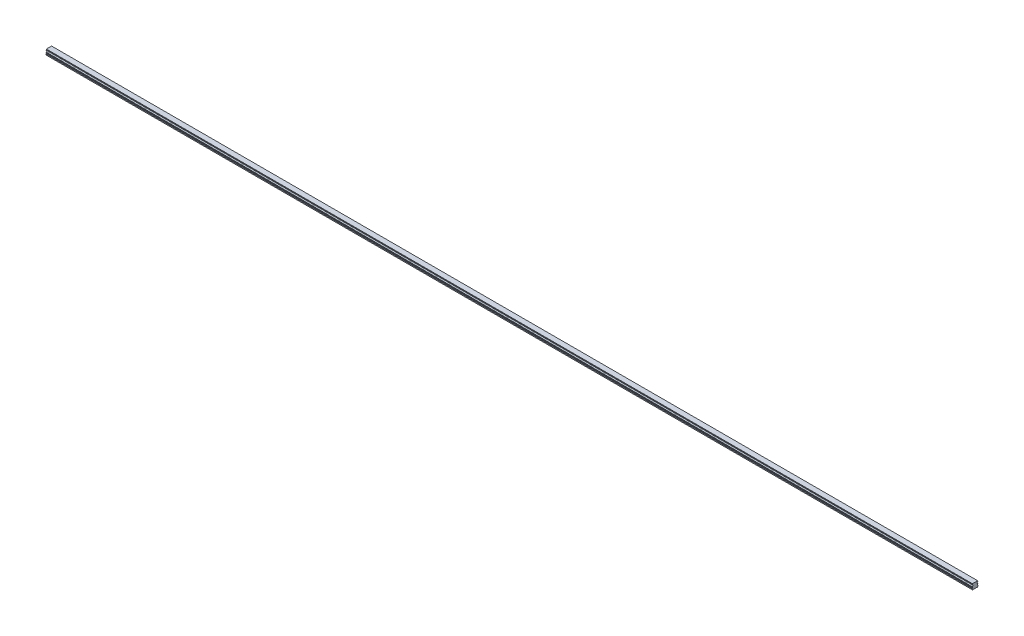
ISO-10303-21;
HEADER;
FILE_DESCRIPTION(('STEP AP214'),'2;1');
FILE_NAME('part.step','',(''),(''),'','','');
FILE_SCHEMA(('AUTOMOTIVE_DESIGN { 1 0 10303 214 1 1 1 1 }'));
ENDSEC;
DATA;
#1=APPLICATION_CONTEXT('core data for automotive mechanical design processes');
#2=APPLICATION_PROTOCOL_DEFINITION('international standard','automotive_design',2000,#1);
#3=PRODUCT_CONTEXT('',#1,'mechanical');
#4=PRODUCT('Part','Part','',(#3));
#5=PRODUCT_RELATED_PRODUCT_CATEGORY('part','',(#4));
#6=PRODUCT_DEFINITION_FORMATION('','',#4);
#7=PRODUCT_DEFINITION_CONTEXT('part definition',#1,'design');
#8=PRODUCT_DEFINITION('design','',#6,#7);
#9=PRODUCT_DEFINITION_SHAPE('','',#8);
#10=(LENGTH_UNIT() NAMED_UNIT(*) SI_UNIT(.MILLI.,.METRE.));
#11=(NAMED_UNIT(*) PLANE_ANGLE_UNIT() SI_UNIT($,.RADIAN.));
#12=(NAMED_UNIT(*) SI_UNIT($,.STERADIAN.) SOLID_ANGLE_UNIT());
#13=UNCERTAINTY_MEASURE_WITH_UNIT(LENGTH_MEASURE(1.E-05),#10,'distance_accuracy_value','');
#14=(GEOMETRIC_REPRESENTATION_CONTEXT(3) GLOBAL_UNCERTAINTY_ASSIGNED_CONTEXT((#13)) GLOBAL_UNIT_ASSIGNED_CONTEXT((#10,
#11,#12)) REPRESENTATION_CONTEXT('',''));
#15=CARTESIAN_POINT('',(0.,0.,0.));
#16=DIRECTION('',(0.,0.,1.));
#17=DIRECTION('',(1.,0.,0.));
#18=AXIS2_PLACEMENT_3D('',#15,#16,#17);
#19=CARTESIAN_POINT('',(2310.,0.399999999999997,0.));
#20=DIRECTION('',(0.,-1.,0.));
#21=DIRECTION('',(0.,0.,-1.));
#22=AXIS2_PLACEMENT_3D('',#19,#20,#21);
#23=CONICAL_SURFACE('',#22,2.90000000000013,0.785398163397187);
#24=CARTESIAN_POINT('',(2310.,0.800000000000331,0.));
#25=DIRECTION('',(0.,1.,0.));
#26=DIRECTION('',(0.,0.,1.));
#27=AXIS2_PLACEMENT_3D('',#24,#25,#26);
#28=CIRCLE('',#27,2.5);
#29=CARTESIAN_POINT('',(2310.,0.800000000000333,2.5));
#30=VERTEX_POINT('',#29);
#31=EDGE_CURVE('E11',#30,#30,#28,.F.);
#32=ORIENTED_EDGE('',*,*,#31,.F.);
#33=EDGE_LOOP('',(#32));
#34=FACE_BOUND('',#33,.T.);
#35=CARTESIAN_POINT('',(2310.,0.399999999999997,0.));
#36=DIRECTION('',(0.,1.,0.));
#37=DIRECTION('',(0.,0.,1.));
#38=AXIS2_PLACEMENT_3D('',#35,#36,#37);
#39=CIRCLE('',#38,2.90000000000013);
#40=CARTESIAN_POINT('',(2310.,0.399999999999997,2.90000000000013));
#41=VERTEX_POINT('',#40);
#42=EDGE_CURVE('E864',#41,#41,#39,.T.);
#43=ORIENTED_EDGE('',*,*,#42,.F.);
#44=EDGE_LOOP('',(#43));
#45=FACE_BOUND('',#44,.T.);
#46=ADVANCED_FACE('F39',(#34,#45),#23,.F.);
#47=CARTESIAN_POINT('',(2310.,7.,0.));
#48=DIRECTION('',(0.,-1.,0.));
#49=DIRECTION('',(0.,0.,-1.));
#50=AXIS2_PLACEMENT_3D('',#47,#48,#49);
#51=CYLINDRICAL_SURFACE('',#50,2.5);
#52=ORIENTED_EDGE('',*,*,#31,.T.);
#53=EDGE_LOOP('',(#52));
#54=FACE_BOUND('',#53,.T.);
#55=CARTESIAN_POINT('',(2310.,7.,0.));
#56=DIRECTION('',(0.,-1.,0.));
#57=DIRECTION('',(0.,0.,-1.));
#58=AXIS2_PLACEMENT_3D('',#55,#56,#57);
#59=CIRCLE('',#58,2.5);
#60=CARTESIAN_POINT('',(2310.,7.,-2.50000000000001));
#61=VERTEX_POINT('',#60);
#62=EDGE_CURVE('E49',#61,#61,#59,.T.);
#63=ORIENTED_EDGE('',*,*,#62,.F.);
#64=EDGE_LOOP('',(#63));
#65=FACE_BOUND('',#64,.T.);
#66=ADVANCED_FACE('F1215',(#54,#65),#51,.F.);
#67=CARTESIAN_POINT('',(2310.,7.,0.));
#68=DIRECTION('',(0.,-1.,0.));
#69=DIRECTION('',(0.,0.,-1.));
#70=AXIS2_PLACEMENT_3D('',#67,#68,#69);
#71=PLANE('',#70);
#72=CARTESIAN_POINT('',(2310.,7.,0.));
#73=DIRECTION('',(0.,-1.,0.));
#74=DIRECTION('',(0.,0.,-1.));
#75=AXIS2_PLACEMENT_3D('',#72,#73,#74);
#76=CIRCLE('',#75,2.1);
#77=CARTESIAN_POINT('',(2310.,7.,-2.1));
#78=VERTEX_POINT('',#77);
#79=EDGE_CURVE('E42',#78,#78,#76,.T.);
#80=ORIENTED_EDGE('',*,*,#79,.F.);
#81=EDGE_LOOP('',(#80));
#82=FACE_BOUND('',#81,.T.);
#83=ORIENTED_EDGE('',*,*,#62,.T.);
#84=EDGE_LOOP('',(#83));
#85=FACE_BOUND('',#84,.T.);
#86=ADVANCED_FACE('F1220',(#82,#85),#71,.T.);
#87=CARTESIAN_POINT('',(2250.,0.399999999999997,0.));
#88=DIRECTION('',(0.,-1.,0.));
#89=DIRECTION('',(0.,0.,-1.));
#90=AXIS2_PLACEMENT_3D('',#87,#88,#89);
#91=CONICAL_SURFACE('',#90,2.90000000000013,0.785398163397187);
#92=CARTESIAN_POINT('',(2250.,0.800000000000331,0.));
#93=DIRECTION('',(0.,1.,0.));
#94=DIRECTION('',(0.,0.,1.));
#95=AXIS2_PLACEMENT_3D('',#92,#93,#94);
#96=CIRCLE('',#95,2.5);
#97=CARTESIAN_POINT('',(2250.,0.800000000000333,2.5));
#98=VERTEX_POINT('',#97);
#99=EDGE_CURVE('E860',#98,#98,#96,.F.);
#100=ORIENTED_EDGE('',*,*,#99,.F.);
#101=EDGE_LOOP('',(#100));
#102=FACE_BOUND('',#101,.T.);
#103=CARTESIAN_POINT('',(2250.,0.399999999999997,0.));
#104=DIRECTION('',(0.,1.,0.));
#105=DIRECTION('',(0.,0.,1.));
#106=AXIS2_PLACEMENT_3D('',#103,#104,#105);
#107=CIRCLE('',#106,2.90000000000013);
#108=CARTESIAN_POINT('',(2250.,0.399999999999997,2.90000000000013));
#109=VERTEX_POINT('',#108);
#110=EDGE_CURVE('E852',#109,#109,#107,.T.);
#111=ORIENTED_EDGE('',*,*,#110,.F.);
#112=EDGE_LOOP('',(#111));
#113=FACE_BOUND('',#112,.T.);
#114=ADVANCED_FACE('F1727',(#102,#113),#91,.F.);
#115=CARTESIAN_POINT('',(2250.,7.,0.));
#116=DIRECTION('',(0.,-1.,0.));
#117=DIRECTION('',(0.,0.,-1.));
#118=AXIS2_PLACEMENT_3D('',#115,#116,#117);
#119=CYLINDRICAL_SURFACE('',#118,2.5);
#120=ORIENTED_EDGE('',*,*,#99,.T.);
#121=EDGE_LOOP('',(#120));
#122=FACE_BOUND('',#121,.T.);
#123=CARTESIAN_POINT('',(2250.,7.,0.));
#124=DIRECTION('',(0.,-1.,0.));
#125=DIRECTION('',(0.,0.,-1.));
#126=AXIS2_PLACEMENT_3D('',#123,#124,#125);
#127=CIRCLE('',#126,2.5);
#128=CARTESIAN_POINT('',(2250.,7.,-2.50000000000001));
#129=VERTEX_POINT('',#128);
#130=EDGE_CURVE('E856',#129,#129,#127,.T.);
#131=ORIENTED_EDGE('',*,*,#130,.F.);
#132=EDGE_LOOP('',(#131));
#133=FACE_BOUND('',#132,.T.);
#134=ADVANCED_FACE('F1723',(#122,#133),#119,.F.);
#135=CARTESIAN_POINT('',(2250.,7.,0.));
#136=DIRECTION('',(0.,-1.,0.));
#137=DIRECTION('',(0.,0.,-1.));
#138=AXIS2_PLACEMENT_3D('',#135,#136,#137);
#139=PLANE('',#138);
#140=CARTESIAN_POINT('',(2250.,7.,0.));
#141=DIRECTION('',(0.,-1.,0.));
#142=DIRECTION('',(0.,0.,-1.));
#143=AXIS2_PLACEMENT_3D('',#140,#141,#142);
#144=CIRCLE('',#143,2.1);
#145=CARTESIAN_POINT('',(2250.,7.,-2.1));
#146=VERTEX_POINT('',#145);
#147=EDGE_CURVE('E1015',#146,#146,#144,.T.);
#148=ORIENTED_EDGE('',*,*,#147,.F.);
#149=EDGE_LOOP('',(#148));
#150=FACE_BOUND('',#149,.T.);
#151=ORIENTED_EDGE('',*,*,#130,.T.);
#152=EDGE_LOOP('',(#151));
#153=FACE_BOUND('',#152,.T.);
#154=ADVANCED_FACE('F1719',(#150,#153),#139,.T.);
#155=CARTESIAN_POINT('',(2190.,0.399999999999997,0.));
#156=DIRECTION('',(0.,-1.,0.));
#157=DIRECTION('',(0.,0.,-1.));
#158=AXIS2_PLACEMENT_3D('',#155,#156,#157);
#159=CONICAL_SURFACE('',#158,2.90000000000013,0.785398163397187);
#160=CARTESIAN_POINT('',(2190.,0.800000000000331,0.));
#161=DIRECTION('',(0.,1.,0.));
#162=DIRECTION('',(0.,0.,1.));
#163=AXIS2_PLACEMENT_3D('',#160,#161,#162);
#164=CIRCLE('',#163,2.5);
#165=CARTESIAN_POINT('',(2190.,0.800000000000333,2.5));
#166=VERTEX_POINT('',#165);
#167=EDGE_CURVE('E848',#166,#166,#164,.F.);
#168=ORIENTED_EDGE('',*,*,#167,.F.);
#169=EDGE_LOOP('',(#168));
#170=FACE_BOUND('',#169,.T.);
#171=CARTESIAN_POINT('',(2190.,0.399999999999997,0.));
#172=DIRECTION('',(0.,1.,0.));
#173=DIRECTION('',(0.,0.,1.));
#174=AXIS2_PLACEMENT_3D('',#171,#172,#173);
#175=CIRCLE('',#174,2.90000000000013);
#176=CARTESIAN_POINT('',(2190.,0.399999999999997,2.90000000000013));
#177=VERTEX_POINT('',#176);
#178=EDGE_CURVE('E840',#177,#177,#175,.T.);
#179=ORIENTED_EDGE('',*,*,#178,.F.);
#180=EDGE_LOOP('',(#179));
#181=FACE_BOUND('',#180,.T.);
#182=ADVANCED_FACE('F1715',(#170,#181),#159,.F.);
#183=CARTESIAN_POINT('',(2190.,7.,0.));
#184=DIRECTION('',(0.,-1.,0.));
#185=DIRECTION('',(0.,0.,-1.));
#186=AXIS2_PLACEMENT_3D('',#183,#184,#185);
#187=CYLINDRICAL_SURFACE('',#186,2.5);
#188=ORIENTED_EDGE('',*,*,#167,.T.);
#189=EDGE_LOOP('',(#188));
#190=FACE_BOUND('',#189,.T.);
#191=CARTESIAN_POINT('',(2190.,7.,0.));
#192=DIRECTION('',(0.,-1.,0.));
#193=DIRECTION('',(0.,0.,-1.));
#194=AXIS2_PLACEMENT_3D('',#191,#192,#193);
#195=CIRCLE('',#194,2.5);
#196=CARTESIAN_POINT('',(2190.,7.,-2.50000000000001));
#197=VERTEX_POINT('',#196);
#198=EDGE_CURVE('E844',#197,#197,#195,.T.);
#199=ORIENTED_EDGE('',*,*,#198,.F.);
#200=EDGE_LOOP('',(#199));
#201=FACE_BOUND('',#200,.T.);
#202=ADVANCED_FACE('F1711',(#190,#201),#187,.F.);
#203=CARTESIAN_POINT('',(2190.,7.,0.));
#204=DIRECTION('',(0.,-1.,0.));
#205=DIRECTION('',(0.,0.,-1.));
#206=AXIS2_PLACEMENT_3D('',#203,#204,#205);
#207=PLANE('',#206);
#208=CARTESIAN_POINT('',(2190.,7.,0.));
#209=DIRECTION('',(0.,-1.,0.));
#210=DIRECTION('',(0.,0.,-1.));
#211=AXIS2_PLACEMENT_3D('',#208,#209,#210);
#212=CIRCLE('',#211,2.1);
#213=CARTESIAN_POINT('',(2190.,7.,-2.1));
#214=VERTEX_POINT('',#213);
#215=EDGE_CURVE('E1012',#214,#214,#212,.T.);
#216=ORIENTED_EDGE('',*,*,#215,.F.);
#217=EDGE_LOOP('',(#216));
#218=FACE_BOUND('',#217,.T.);
#219=ORIENTED_EDGE('',*,*,#198,.T.);
#220=EDGE_LOOP('',(#219));
#221=FACE_BOUND('',#220,.T.);
#222=ADVANCED_FACE('F1707',(#218,#221),#207,.T.);
#223=CARTESIAN_POINT('',(2130.,0.399999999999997,0.));
#224=DIRECTION('',(0.,-1.,0.));
#225=DIRECTION('',(0.,0.,-1.));
#226=AXIS2_PLACEMENT_3D('',#223,#224,#225);
#227=CONICAL_SURFACE('',#226,2.90000000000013,0.785398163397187);
#228=CARTESIAN_POINT('',(2130.,0.800000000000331,0.));
#229=DIRECTION('',(0.,1.,0.));
#230=DIRECTION('',(0.,0.,1.));
#231=AXIS2_PLACEMENT_3D('',#228,#229,#230);
#232=CIRCLE('',#231,2.5);
#233=CARTESIAN_POINT('',(2130.,0.800000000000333,2.5));
#234=VERTEX_POINT('',#233);
#235=EDGE_CURVE('E836',#234,#234,#232,.F.);
#236=ORIENTED_EDGE('',*,*,#235,.F.);
#237=EDGE_LOOP('',(#236));
#238=FACE_BOUND('',#237,.T.);
#239=CARTESIAN_POINT('',(2130.,0.399999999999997,0.));
#240=DIRECTION('',(0.,1.,0.));
#241=DIRECTION('',(0.,0.,1.));
#242=AXIS2_PLACEMENT_3D('',#239,#240,#241);
#243=CIRCLE('',#242,2.90000000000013);
#244=CARTESIAN_POINT('',(2130.,0.399999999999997,2.90000000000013));
#245=VERTEX_POINT('',#244);
#246=EDGE_CURVE('E828',#245,#245,#243,.T.);
#247=ORIENTED_EDGE('',*,*,#246,.F.);
#248=EDGE_LOOP('',(#247));
#249=FACE_BOUND('',#248,.T.);
#250=ADVANCED_FACE('F1703',(#238,#249),#227,.F.);
#251=CARTESIAN_POINT('',(2130.,7.,0.));
#252=DIRECTION('',(0.,-1.,0.));
#253=DIRECTION('',(0.,0.,-1.));
#254=AXIS2_PLACEMENT_3D('',#251,#252,#253);
#255=CYLINDRICAL_SURFACE('',#254,2.5);
#256=ORIENTED_EDGE('',*,*,#235,.T.);
#257=EDGE_LOOP('',(#256));
#258=FACE_BOUND('',#257,.T.);
#259=CARTESIAN_POINT('',(2130.,7.,0.));
#260=DIRECTION('',(0.,-1.,0.));
#261=DIRECTION('',(0.,0.,-1.));
#262=AXIS2_PLACEMENT_3D('',#259,#260,#261);
#263=CIRCLE('',#262,2.5);
#264=CARTESIAN_POINT('',(2130.,7.,-2.50000000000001));
#265=VERTEX_POINT('',#264);
#266=EDGE_CURVE('E832',#265,#265,#263,.T.);
#267=ORIENTED_EDGE('',*,*,#266,.F.);
#268=EDGE_LOOP('',(#267));
#269=FACE_BOUND('',#268,.T.);
#270=ADVANCED_FACE('F1699',(#258,#269),#255,.F.);
#271=CARTESIAN_POINT('',(2130.,7.,0.));
#272=DIRECTION('',(0.,-1.,0.));
#273=DIRECTION('',(0.,0.,-1.));
#274=AXIS2_PLACEMENT_3D('',#271,#272,#273);
#275=PLANE('',#274);
#276=CARTESIAN_POINT('',(2130.,7.,0.));
#277=DIRECTION('',(0.,-1.,0.));
#278=DIRECTION('',(0.,0.,-1.));
#279=AXIS2_PLACEMENT_3D('',#276,#277,#278);
#280=CIRCLE('',#279,2.1);
#281=CARTESIAN_POINT('',(2130.,7.,-2.1));
#282=VERTEX_POINT('',#281);
#283=EDGE_CURVE('E1008',#282,#282,#280,.T.);
#284=ORIENTED_EDGE('',*,*,#283,.F.);
#285=EDGE_LOOP('',(#284));
#286=FACE_BOUND('',#285,.T.);
#287=ORIENTED_EDGE('',*,*,#266,.T.);
#288=EDGE_LOOP('',(#287));
#289=FACE_BOUND('',#288,.T.);
#290=ADVANCED_FACE('F1695',(#286,#289),#275,.T.);
#291=CARTESIAN_POINT('',(2070.,0.399999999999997,0.));
#292=DIRECTION('',(0.,-1.,0.));
#293=DIRECTION('',(0.,0.,-1.));
#294=AXIS2_PLACEMENT_3D('',#291,#292,#293);
#295=CONICAL_SURFACE('',#294,2.90000000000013,0.785398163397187);
#296=CARTESIAN_POINT('',(2070.,0.800000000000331,0.));
#297=DIRECTION('',(0.,1.,0.));
#298=DIRECTION('',(0.,0.,1.));
#299=AXIS2_PLACEMENT_3D('',#296,#297,#298);
#300=CIRCLE('',#299,2.5);
#301=CARTESIAN_POINT('',(2070.,0.800000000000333,2.5));
#302=VERTEX_POINT('',#301);
#303=EDGE_CURVE('E824',#302,#302,#300,.F.);
#304=ORIENTED_EDGE('',*,*,#303,.F.);
#305=EDGE_LOOP('',(#304));
#306=FACE_BOUND('',#305,.T.);
#307=CARTESIAN_POINT('',(2070.,0.399999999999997,0.));
#308=DIRECTION('',(0.,1.,0.));
#309=DIRECTION('',(0.,0.,1.));
#310=AXIS2_PLACEMENT_3D('',#307,#308,#309);
#311=CIRCLE('',#310,2.90000000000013);
#312=CARTESIAN_POINT('',(2070.,0.399999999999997,2.90000000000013));
#313=VERTEX_POINT('',#312);
#314=EDGE_CURVE('E816',#313,#313,#311,.T.);
#315=ORIENTED_EDGE('',*,*,#314,.F.);
#316=EDGE_LOOP('',(#315));
#317=FACE_BOUND('',#316,.T.);
#318=ADVANCED_FACE('F1691',(#306,#317),#295,.F.);
#319=CARTESIAN_POINT('',(2070.,7.,0.));
#320=DIRECTION('',(0.,-1.,0.));
#321=DIRECTION('',(0.,0.,-1.));
#322=AXIS2_PLACEMENT_3D('',#319,#320,#321);
#323=CYLINDRICAL_SURFACE('',#322,2.5);
#324=ORIENTED_EDGE('',*,*,#303,.T.);
#325=EDGE_LOOP('',(#324));
#326=FACE_BOUND('',#325,.T.);
#327=CARTESIAN_POINT('',(2070.,7.,0.));
#328=DIRECTION('',(0.,-1.,0.));
#329=DIRECTION('',(0.,0.,-1.));
#330=AXIS2_PLACEMENT_3D('',#327,#328,#329);
#331=CIRCLE('',#330,2.5);
#332=CARTESIAN_POINT('',(2070.,7.,-2.50000000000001));
#333=VERTEX_POINT('',#332);
#334=EDGE_CURVE('E820',#333,#333,#331,.T.);
#335=ORIENTED_EDGE('',*,*,#334,.F.);
#336=EDGE_LOOP('',(#335));
#337=FACE_BOUND('',#336,.T.);
#338=ADVANCED_FACE('F1687',(#326,#337),#323,.F.);
#339=CARTESIAN_POINT('',(2070.,7.,0.));
#340=DIRECTION('',(0.,-1.,0.));
#341=DIRECTION('',(0.,0.,-1.));
#342=AXIS2_PLACEMENT_3D('',#339,#340,#341);
#343=PLANE('',#342);
#344=CARTESIAN_POINT('',(2070.,7.,0.));
#345=DIRECTION('',(0.,-1.,0.));
#346=DIRECTION('',(0.,0.,-1.));
#347=AXIS2_PLACEMENT_3D('',#344,#345,#346);
#348=CIRCLE('',#347,2.1);
#349=CARTESIAN_POINT('',(2070.,7.,-2.1));
#350=VERTEX_POINT('',#349);
#351=EDGE_CURVE('E1004',#350,#350,#348,.T.);
#352=ORIENTED_EDGE('',*,*,#351,.F.);
#353=EDGE_LOOP('',(#352));
#354=FACE_BOUND('',#353,.T.);
#355=ORIENTED_EDGE('',*,*,#334,.T.);
#356=EDGE_LOOP('',(#355));
#357=FACE_BOUND('',#356,.T.);
#358=ADVANCED_FACE('F1683',(#354,#357),#343,.T.);
#359=CARTESIAN_POINT('',(2010.,0.399999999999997,0.));
#360=DIRECTION('',(0.,-1.,0.));
#361=DIRECTION('',(0.,0.,-1.));
#362=AXIS2_PLACEMENT_3D('',#359,#360,#361);
#363=CONICAL_SURFACE('',#362,2.90000000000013,0.785398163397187);
#364=CARTESIAN_POINT('',(2010.,0.800000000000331,0.));
#365=DIRECTION('',(0.,1.,0.));
#366=DIRECTION('',(0.,0.,1.));
#367=AXIS2_PLACEMENT_3D('',#364,#365,#366);
#368=CIRCLE('',#367,2.5);
#369=CARTESIAN_POINT('',(2010.,0.800000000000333,2.5));
#370=VERTEX_POINT('',#369);
#371=EDGE_CURVE('E812',#370,#370,#368,.F.);
#372=ORIENTED_EDGE('',*,*,#371,.F.);
#373=EDGE_LOOP('',(#372));
#374=FACE_BOUND('',#373,.T.);
#375=CARTESIAN_POINT('',(2010.,0.399999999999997,0.));
#376=DIRECTION('',(0.,1.,0.));
#377=DIRECTION('',(0.,0.,1.));
#378=AXIS2_PLACEMENT_3D('',#375,#376,#377);
#379=CIRCLE('',#378,2.90000000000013);
#380=CARTESIAN_POINT('',(2010.,0.399999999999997,2.90000000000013));
#381=VERTEX_POINT('',#380);
#382=EDGE_CURVE('E804',#381,#381,#379,.T.);
#383=ORIENTED_EDGE('',*,*,#382,.F.);
#384=EDGE_LOOP('',(#383));
#385=FACE_BOUND('',#384,.T.);
#386=ADVANCED_FACE('F1679',(#374,#385),#363,.F.);
#387=CARTESIAN_POINT('',(2010.,7.,0.));
#388=DIRECTION('',(0.,-1.,0.));
#389=DIRECTION('',(0.,0.,-1.));
#390=AXIS2_PLACEMENT_3D('',#387,#388,#389);
#391=CYLINDRICAL_SURFACE('',#390,2.5);
#392=ORIENTED_EDGE('',*,*,#371,.T.);
#393=EDGE_LOOP('',(#392));
#394=FACE_BOUND('',#393,.T.);
#395=CARTESIAN_POINT('',(2010.,7.,0.));
#396=DIRECTION('',(0.,-1.,0.));
#397=DIRECTION('',(0.,0.,-1.));
#398=AXIS2_PLACEMENT_3D('',#395,#396,#397);
#399=CIRCLE('',#398,2.5);
#400=CARTESIAN_POINT('',(2010.,7.,-2.50000000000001));
#401=VERTEX_POINT('',#400);
#402=EDGE_CURVE('E808',#401,#401,#399,.T.);
#403=ORIENTED_EDGE('',*,*,#402,.F.);
#404=EDGE_LOOP('',(#403));
#405=FACE_BOUND('',#404,.T.);
#406=ADVANCED_FACE('F1675',(#394,#405),#391,.F.);
#407=CARTESIAN_POINT('',(2010.,7.,0.));
#408=DIRECTION('',(0.,-1.,0.));
#409=DIRECTION('',(0.,0.,-1.));
#410=AXIS2_PLACEMENT_3D('',#407,#408,#409);
#411=PLANE('',#410);
#412=CARTESIAN_POINT('',(2010.,7.,0.));
#413=DIRECTION('',(0.,-1.,0.));
#414=DIRECTION('',(0.,0.,-1.));
#415=AXIS2_PLACEMENT_3D('',#412,#413,#414);
#416=CIRCLE('',#415,2.1);
#417=CARTESIAN_POINT('',(2010.,7.,-2.1));
#418=VERTEX_POINT('',#417);
#419=EDGE_CURVE('E1000',#418,#418,#416,.T.);
#420=ORIENTED_EDGE('',*,*,#419,.F.);
#421=EDGE_LOOP('',(#420));
#422=FACE_BOUND('',#421,.T.);
#423=ORIENTED_EDGE('',*,*,#402,.T.);
#424=EDGE_LOOP('',(#423));
#425=FACE_BOUND('',#424,.T.);
#426=ADVANCED_FACE('F1671',(#422,#425),#411,.T.);
#427=CARTESIAN_POINT('',(1950.,0.399999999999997,0.));
#428=DIRECTION('',(0.,-1.,0.));
#429=DIRECTION('',(0.,0.,-1.));
#430=AXIS2_PLACEMENT_3D('',#427,#428,#429);
#431=CONICAL_SURFACE('',#430,2.90000000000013,0.785398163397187);
#432=CARTESIAN_POINT('',(1950.,0.800000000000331,0.));
#433=DIRECTION('',(0.,1.,0.));
#434=DIRECTION('',(0.,0.,1.));
#435=AXIS2_PLACEMENT_3D('',#432,#433,#434);
#436=CIRCLE('',#435,2.5);
#437=CARTESIAN_POINT('',(1950.,0.800000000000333,2.5));
#438=VERTEX_POINT('',#437);
#439=EDGE_CURVE('E800',#438,#438,#436,.F.);
#440=ORIENTED_EDGE('',*,*,#439,.F.);
#441=EDGE_LOOP('',(#440));
#442=FACE_BOUND('',#441,.T.);
#443=CARTESIAN_POINT('',(1950.,0.399999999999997,0.));
#444=DIRECTION('',(0.,1.,0.));
#445=DIRECTION('',(0.,0.,1.));
#446=AXIS2_PLACEMENT_3D('',#443,#444,#445);
#447=CIRCLE('',#446,2.90000000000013);
#448=CARTESIAN_POINT('',(1950.,0.399999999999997,2.90000000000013));
#449=VERTEX_POINT('',#448);
#450=EDGE_CURVE('E792',#449,#449,#447,.T.);
#451=ORIENTED_EDGE('',*,*,#450,.F.);
#452=EDGE_LOOP('',(#451));
#453=FACE_BOUND('',#452,.T.);
#454=ADVANCED_FACE('F1667',(#442,#453),#431,.F.);
#455=CARTESIAN_POINT('',(1950.,7.,0.));
#456=DIRECTION('',(0.,-1.,0.));
#457=DIRECTION('',(0.,0.,-1.));
#458=AXIS2_PLACEMENT_3D('',#455,#456,#457);
#459=CYLINDRICAL_SURFACE('',#458,2.5);
#460=ORIENTED_EDGE('',*,*,#439,.T.);
#461=EDGE_LOOP('',(#460));
#462=FACE_BOUND('',#461,.T.);
#463=CARTESIAN_POINT('',(1950.,7.,0.));
#464=DIRECTION('',(0.,-1.,0.));
#465=DIRECTION('',(0.,0.,-1.));
#466=AXIS2_PLACEMENT_3D('',#463,#464,#465);
#467=CIRCLE('',#466,2.5);
#468=CARTESIAN_POINT('',(1950.,7.,-2.50000000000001));
#469=VERTEX_POINT('',#468);
#470=EDGE_CURVE('E796',#469,#469,#467,.T.);
#471=ORIENTED_EDGE('',*,*,#470,.F.);
#472=EDGE_LOOP('',(#471));
#473=FACE_BOUND('',#472,.T.);
#474=ADVANCED_FACE('F1663',(#462,#473),#459,.F.);
#475=CARTESIAN_POINT('',(1950.,7.,0.));
#476=DIRECTION('',(0.,-1.,0.));
#477=DIRECTION('',(0.,0.,-1.));
#478=AXIS2_PLACEMENT_3D('',#475,#476,#477);
#479=PLANE('',#478);
#480=CARTESIAN_POINT('',(1950.,7.,0.));
#481=DIRECTION('',(0.,-1.,0.));
#482=DIRECTION('',(0.,0.,-1.));
#483=AXIS2_PLACEMENT_3D('',#480,#481,#482);
#484=CIRCLE('',#483,2.1);
#485=CARTESIAN_POINT('',(1950.,7.,-2.1));
#486=VERTEX_POINT('',#485);
#487=EDGE_CURVE('E996',#486,#486,#484,.T.);
#488=ORIENTED_EDGE('',*,*,#487,.F.);
#489=EDGE_LOOP('',(#488));
#490=FACE_BOUND('',#489,.T.);
#491=ORIENTED_EDGE('',*,*,#470,.T.);
#492=EDGE_LOOP('',(#491));
#493=FACE_BOUND('',#492,.T.);
#494=ADVANCED_FACE('F1659',(#490,#493),#479,.T.);
#495=CARTESIAN_POINT('',(1890.,0.399999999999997,0.));
#496=DIRECTION('',(0.,-1.,0.));
#497=DIRECTION('',(0.,0.,-1.));
#498=AXIS2_PLACEMENT_3D('',#495,#496,#497);
#499=CONICAL_SURFACE('',#498,2.90000000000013,0.785398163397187);
#500=CARTESIAN_POINT('',(1890.,0.800000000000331,0.));
#501=DIRECTION('',(0.,1.,0.));
#502=DIRECTION('',(0.,0.,1.));
#503=AXIS2_PLACEMENT_3D('',#500,#501,#502);
#504=CIRCLE('',#503,2.5);
#505=CARTESIAN_POINT('',(1890.,0.800000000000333,2.5));
#506=VERTEX_POINT('',#505);
#507=EDGE_CURVE('E788',#506,#506,#504,.F.);
#508=ORIENTED_EDGE('',*,*,#507,.F.);
#509=EDGE_LOOP('',(#508));
#510=FACE_BOUND('',#509,.T.);
#511=CARTESIAN_POINT('',(1890.,0.399999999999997,0.));
#512=DIRECTION('',(0.,1.,0.));
#513=DIRECTION('',(0.,0.,1.));
#514=AXIS2_PLACEMENT_3D('',#511,#512,#513);
#515=CIRCLE('',#514,2.90000000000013);
#516=CARTESIAN_POINT('',(1890.,0.399999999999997,2.90000000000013));
#517=VERTEX_POINT('',#516);
#518=EDGE_CURVE('E780',#517,#517,#515,.T.);
#519=ORIENTED_EDGE('',*,*,#518,.F.);
#520=EDGE_LOOP('',(#519));
#521=FACE_BOUND('',#520,.T.);
#522=ADVANCED_FACE('F1655',(#510,#521),#499,.F.);
#523=CARTESIAN_POINT('',(1890.,7.,0.));
#524=DIRECTION('',(0.,-1.,0.));
#525=DIRECTION('',(0.,0.,-1.));
#526=AXIS2_PLACEMENT_3D('',#523,#524,#525);
#527=CYLINDRICAL_SURFACE('',#526,2.5);
#528=ORIENTED_EDGE('',*,*,#507,.T.);
#529=EDGE_LOOP('',(#528));
#530=FACE_BOUND('',#529,.T.);
#531=CARTESIAN_POINT('',(1890.,7.,0.));
#532=DIRECTION('',(0.,-1.,0.));
#533=DIRECTION('',(0.,0.,-1.));
#534=AXIS2_PLACEMENT_3D('',#531,#532,#533);
#535=CIRCLE('',#534,2.5);
#536=CARTESIAN_POINT('',(1890.,7.,-2.50000000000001));
#537=VERTEX_POINT('',#536);
#538=EDGE_CURVE('E784',#537,#537,#535,.T.);
#539=ORIENTED_EDGE('',*,*,#538,.F.);
#540=EDGE_LOOP('',(#539));
#541=FACE_BOUND('',#540,.T.);
#542=ADVANCED_FACE('F1651',(#530,#541),#527,.F.);
#543=CARTESIAN_POINT('',(1890.,7.,0.));
#544=DIRECTION('',(0.,-1.,0.));
#545=DIRECTION('',(0.,0.,-1.));
#546=AXIS2_PLACEMENT_3D('',#543,#544,#545);
#547=PLANE('',#546);
#548=CARTESIAN_POINT('',(1890.,7.,0.));
#549=DIRECTION('',(0.,-1.,0.));
#550=DIRECTION('',(0.,0.,-1.));
#551=AXIS2_PLACEMENT_3D('',#548,#549,#550);
#552=CIRCLE('',#551,2.1);
#553=CARTESIAN_POINT('',(1890.,7.,-2.1));
#554=VERTEX_POINT('',#553);
#555=EDGE_CURVE('E992',#554,#554,#552,.T.);
#556=ORIENTED_EDGE('',*,*,#555,.F.);
#557=EDGE_LOOP('',(#556));
#558=FACE_BOUND('',#557,.T.);
#559=ORIENTED_EDGE('',*,*,#538,.T.);
#560=EDGE_LOOP('',(#559));
#561=FACE_BOUND('',#560,.T.);
#562=ADVANCED_FACE('F1647',(#558,#561),#547,.T.);
#563=CARTESIAN_POINT('',(1830.,0.399999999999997,0.));
#564=DIRECTION('',(0.,-1.,0.));
#565=DIRECTION('',(0.,0.,-1.));
#566=AXIS2_PLACEMENT_3D('',#563,#564,#565);
#567=CONICAL_SURFACE('',#566,2.90000000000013,0.785398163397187);
#568=CARTESIAN_POINT('',(1830.,0.800000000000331,0.));
#569=DIRECTION('',(0.,1.,0.));
#570=DIRECTION('',(0.,0.,1.));
#571=AXIS2_PLACEMENT_3D('',#568,#569,#570);
#572=CIRCLE('',#571,2.5);
#573=CARTESIAN_POINT('',(1830.,0.800000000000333,2.5));
#574=VERTEX_POINT('',#573);
#575=EDGE_CURVE('E776',#574,#574,#572,.F.);
#576=ORIENTED_EDGE('',*,*,#575,.F.);
#577=EDGE_LOOP('',(#576));
#578=FACE_BOUND('',#577,.T.);
#579=CARTESIAN_POINT('',(1830.,0.399999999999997,0.));
#580=DIRECTION('',(0.,1.,0.));
#581=DIRECTION('',(0.,0.,1.));
#582=AXIS2_PLACEMENT_3D('',#579,#580,#581);
#583=CIRCLE('',#582,2.90000000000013);
#584=CARTESIAN_POINT('',(1830.,0.399999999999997,2.90000000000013));
#585=VERTEX_POINT('',#584);
#586=EDGE_CURVE('E768',#585,#585,#583,.T.);
#587=ORIENTED_EDGE('',*,*,#586,.F.);
#588=EDGE_LOOP('',(#587));
#589=FACE_BOUND('',#588,.T.);
#590=ADVANCED_FACE('F1643',(#578,#589),#567,.F.);
#591=CARTESIAN_POINT('',(1830.,7.,0.));
#592=DIRECTION('',(0.,-1.,0.));
#593=DIRECTION('',(0.,0.,-1.));
#594=AXIS2_PLACEMENT_3D('',#591,#592,#593);
#595=CYLINDRICAL_SURFACE('',#594,2.5);
#596=ORIENTED_EDGE('',*,*,#575,.T.);
#597=EDGE_LOOP('',(#596));
#598=FACE_BOUND('',#597,.T.);
#599=CARTESIAN_POINT('',(1830.,7.,0.));
#600=DIRECTION('',(0.,-1.,0.));
#601=DIRECTION('',(0.,0.,-1.));
#602=AXIS2_PLACEMENT_3D('',#599,#600,#601);
#603=CIRCLE('',#602,2.5);
#604=CARTESIAN_POINT('',(1830.,7.,-2.50000000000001));
#605=VERTEX_POINT('',#604);
#606=EDGE_CURVE('E772',#605,#605,#603,.T.);
#607=ORIENTED_EDGE('',*,*,#606,.F.);
#608=EDGE_LOOP('',(#607));
#609=FACE_BOUND('',#608,.T.);
#610=ADVANCED_FACE('F1639',(#598,#609),#595,.F.);
#611=CARTESIAN_POINT('',(1830.,7.,0.));
#612=DIRECTION('',(0.,-1.,0.));
#613=DIRECTION('',(0.,0.,-1.));
#614=AXIS2_PLACEMENT_3D('',#611,#612,#613);
#615=PLANE('',#614);
#616=CARTESIAN_POINT('',(1830.,7.,0.));
#617=DIRECTION('',(0.,-1.,0.));
#618=DIRECTION('',(0.,0.,-1.));
#619=AXIS2_PLACEMENT_3D('',#616,#617,#618);
#620=CIRCLE('',#619,2.1);
#621=CARTESIAN_POINT('',(1830.,7.,-2.1));
#622=VERTEX_POINT('',#621);
#623=EDGE_CURVE('E988',#622,#622,#620,.T.);
#624=ORIENTED_EDGE('',*,*,#623,.F.);
#625=EDGE_LOOP('',(#624));
#626=FACE_BOUND('',#625,.T.);
#627=ORIENTED_EDGE('',*,*,#606,.T.);
#628=EDGE_LOOP('',(#627));
#629=FACE_BOUND('',#628,.T.);
#630=ADVANCED_FACE('F1635',(#626,#629),#615,.T.);
#631=CARTESIAN_POINT('',(1770.,0.399999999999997,0.));
#632=DIRECTION('',(0.,-1.,0.));
#633=DIRECTION('',(0.,0.,-1.));
#634=AXIS2_PLACEMENT_3D('',#631,#632,#633);
#635=CONICAL_SURFACE('',#634,2.90000000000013,0.785398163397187);
#636=CARTESIAN_POINT('',(1770.,0.800000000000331,0.));
#637=DIRECTION('',(0.,1.,0.));
#638=DIRECTION('',(0.,0.,1.));
#639=AXIS2_PLACEMENT_3D('',#636,#637,#638);
#640=CIRCLE('',#639,2.5);
#641=CARTESIAN_POINT('',(1770.,0.800000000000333,2.5));
#642=VERTEX_POINT('',#641);
#643=EDGE_CURVE('E764',#642,#642,#640,.F.);
#644=ORIENTED_EDGE('',*,*,#643,.F.);
#645=EDGE_LOOP('',(#644));
#646=FACE_BOUND('',#645,.T.);
#647=CARTESIAN_POINT('',(1770.,0.399999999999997,0.));
#648=DIRECTION('',(0.,1.,0.));
#649=DIRECTION('',(0.,0.,1.));
#650=AXIS2_PLACEMENT_3D('',#647,#648,#649);
#651=CIRCLE('',#650,2.90000000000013);
#652=CARTESIAN_POINT('',(1770.,0.399999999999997,2.90000000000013));
#653=VERTEX_POINT('',#652);
#654=EDGE_CURVE('E756',#653,#653,#651,.T.);
#655=ORIENTED_EDGE('',*,*,#654,.F.);
#656=EDGE_LOOP('',(#655));
#657=FACE_BOUND('',#656,.T.);
#658=ADVANCED_FACE('F1631',(#646,#657),#635,.F.);
#659=CARTESIAN_POINT('',(1770.,7.,0.));
#660=DIRECTION('',(0.,-1.,0.));
#661=DIRECTION('',(0.,0.,-1.));
#662=AXIS2_PLACEMENT_3D('',#659,#660,#661);
#663=CYLINDRICAL_SURFACE('',#662,2.5);
#664=ORIENTED_EDGE('',*,*,#643,.T.);
#665=EDGE_LOOP('',(#664));
#666=FACE_BOUND('',#665,.T.);
#667=CARTESIAN_POINT('',(1770.,7.,0.));
#668=DIRECTION('',(0.,-1.,0.));
#669=DIRECTION('',(0.,0.,-1.));
#670=AXIS2_PLACEMENT_3D('',#667,#668,#669);
#671=CIRCLE('',#670,2.5);
#672=CARTESIAN_POINT('',(1770.,7.,-2.50000000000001));
#673=VERTEX_POINT('',#672);
#674=EDGE_CURVE('E760',#673,#673,#671,.T.);
#675=ORIENTED_EDGE('',*,*,#674,.F.);
#676=EDGE_LOOP('',(#675));
#677=FACE_BOUND('',#676,.T.);
#678=ADVANCED_FACE('F1627',(#666,#677),#663,.F.);
#679=CARTESIAN_POINT('',(1770.,7.,0.));
#680=DIRECTION('',(0.,-1.,0.));
#681=DIRECTION('',(0.,0.,-1.));
#682=AXIS2_PLACEMENT_3D('',#679,#680,#681);
#683=PLANE('',#682);
#684=CARTESIAN_POINT('',(1770.,7.,0.));
#685=DIRECTION('',(0.,-1.,0.));
#686=DIRECTION('',(0.,0.,-1.));
#687=AXIS2_PLACEMENT_3D('',#684,#685,#686);
#688=CIRCLE('',#687,2.1);
#689=CARTESIAN_POINT('',(1770.,7.,-2.1));
#690=VERTEX_POINT('',#689);
#691=EDGE_CURVE('E984',#690,#690,#688,.T.);
#692=ORIENTED_EDGE('',*,*,#691,.F.);
#693=EDGE_LOOP('',(#692));
#694=FACE_BOUND('',#693,.T.);
#695=ORIENTED_EDGE('',*,*,#674,.T.);
#696=EDGE_LOOP('',(#695));
#697=FACE_BOUND('',#696,.T.);
#698=ADVANCED_FACE('F1623',(#694,#697),#683,.T.);
#699=CARTESIAN_POINT('',(1710.,0.399999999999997,0.));
#700=DIRECTION('',(0.,-1.,0.));
#701=DIRECTION('',(0.,0.,-1.));
#702=AXIS2_PLACEMENT_3D('',#699,#700,#701);
#703=CONICAL_SURFACE('',#702,2.90000000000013,0.785398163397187);
#704=CARTESIAN_POINT('',(1710.,0.800000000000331,0.));
#705=DIRECTION('',(0.,1.,0.));
#706=DIRECTION('',(0.,0.,1.));
#707=AXIS2_PLACEMENT_3D('',#704,#705,#706);
#708=CIRCLE('',#707,2.5);
#709=CARTESIAN_POINT('',(1710.,0.800000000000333,2.5));
#710=VERTEX_POINT('',#709);
#711=EDGE_CURVE('E752',#710,#710,#708,.F.);
#712=ORIENTED_EDGE('',*,*,#711,.F.);
#713=EDGE_LOOP('',(#712));
#714=FACE_BOUND('',#713,.T.);
#715=CARTESIAN_POINT('',(1710.,0.399999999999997,0.));
#716=DIRECTION('',(0.,1.,0.));
#717=DIRECTION('',(0.,0.,1.));
#718=AXIS2_PLACEMENT_3D('',#715,#716,#717);
#719=CIRCLE('',#718,2.90000000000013);
#720=CARTESIAN_POINT('',(1710.,0.399999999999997,2.90000000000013));
#721=VERTEX_POINT('',#720);
#722=EDGE_CURVE('E744',#721,#721,#719,.T.);
#723=ORIENTED_EDGE('',*,*,#722,.F.);
#724=EDGE_LOOP('',(#723));
#725=FACE_BOUND('',#724,.T.);
#726=ADVANCED_FACE('F1619',(#714,#725),#703,.F.);
#727=CARTESIAN_POINT('',(1710.,7.,0.));
#728=DIRECTION('',(0.,-1.,0.));
#729=DIRECTION('',(0.,0.,-1.));
#730=AXIS2_PLACEMENT_3D('',#727,#728,#729);
#731=CYLINDRICAL_SURFACE('',#730,2.5);
#732=ORIENTED_EDGE('',*,*,#711,.T.);
#733=EDGE_LOOP('',(#732));
#734=FACE_BOUND('',#733,.T.);
#735=CARTESIAN_POINT('',(1710.,7.,0.));
#736=DIRECTION('',(0.,-1.,0.));
#737=DIRECTION('',(0.,0.,-1.));
#738=AXIS2_PLACEMENT_3D('',#735,#736,#737);
#739=CIRCLE('',#738,2.5);
#740=CARTESIAN_POINT('',(1710.,7.,-2.50000000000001));
#741=VERTEX_POINT('',#740);
#742=EDGE_CURVE('E748',#741,#741,#739,.T.);
#743=ORIENTED_EDGE('',*,*,#742,.F.);
#744=EDGE_LOOP('',(#743));
#745=FACE_BOUND('',#744,.T.);
#746=ADVANCED_FACE('F1615',(#734,#745),#731,.F.);
#747=CARTESIAN_POINT('',(1710.,7.,0.));
#748=DIRECTION('',(0.,-1.,0.));
#749=DIRECTION('',(0.,0.,-1.));
#750=AXIS2_PLACEMENT_3D('',#747,#748,#749);
#751=PLANE('',#750);
#752=CARTESIAN_POINT('',(1710.,7.,0.));
#753=DIRECTION('',(0.,-1.,0.));
#754=DIRECTION('',(0.,0.,-1.));
#755=AXIS2_PLACEMENT_3D('',#752,#753,#754);
#756=CIRCLE('',#755,2.1);
#757=CARTESIAN_POINT('',(1710.,7.,-2.1));
#758=VERTEX_POINT('',#757);
#759=EDGE_CURVE('E980',#758,#758,#756,.T.);
#760=ORIENTED_EDGE('',*,*,#759,.F.);
#761=EDGE_LOOP('',(#760));
#762=FACE_BOUND('',#761,.T.);
#763=ORIENTED_EDGE('',*,*,#742,.T.);
#764=EDGE_LOOP('',(#763));
#765=FACE_BOUND('',#764,.T.);
#766=ADVANCED_FACE('F1611',(#762,#765),#751,.T.);
#767=CARTESIAN_POINT('',(1650.,0.399999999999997,0.));
#768=DIRECTION('',(0.,-1.,0.));
#769=DIRECTION('',(0.,0.,-1.));
#770=AXIS2_PLACEMENT_3D('',#767,#768,#769);
#771=CONICAL_SURFACE('',#770,2.90000000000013,0.785398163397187);
#772=CARTESIAN_POINT('',(1650.,0.800000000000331,0.));
#773=DIRECTION('',(0.,1.,0.));
#774=DIRECTION('',(0.,0.,1.));
#775=AXIS2_PLACEMENT_3D('',#772,#773,#774);
#776=CIRCLE('',#775,2.5);
#777=CARTESIAN_POINT('',(1650.,0.800000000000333,2.5));
#778=VERTEX_POINT('',#777);
#779=EDGE_CURVE('E740',#778,#778,#776,.F.);
#780=ORIENTED_EDGE('',*,*,#779,.F.);
#781=EDGE_LOOP('',(#780));
#782=FACE_BOUND('',#781,.T.);
#783=CARTESIAN_POINT('',(1650.,0.399999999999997,0.));
#784=DIRECTION('',(0.,1.,0.));
#785=DIRECTION('',(0.,0.,1.));
#786=AXIS2_PLACEMENT_3D('',#783,#784,#785);
#787=CIRCLE('',#786,2.90000000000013);
#788=CARTESIAN_POINT('',(1650.,0.399999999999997,2.90000000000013));
#789=VERTEX_POINT('',#788);
#790=EDGE_CURVE('E732',#789,#789,#787,.T.);
#791=ORIENTED_EDGE('',*,*,#790,.F.);
#792=EDGE_LOOP('',(#791));
#793=FACE_BOUND('',#792,.T.);
#794=ADVANCED_FACE('F1607',(#782,#793),#771,.F.);
#795=CARTESIAN_POINT('',(1650.,7.,0.));
#796=DIRECTION('',(0.,-1.,0.));
#797=DIRECTION('',(0.,0.,-1.));
#798=AXIS2_PLACEMENT_3D('',#795,#796,#797);
#799=CYLINDRICAL_SURFACE('',#798,2.5);
#800=ORIENTED_EDGE('',*,*,#779,.T.);
#801=EDGE_LOOP('',(#800));
#802=FACE_BOUND('',#801,.T.);
#803=CARTESIAN_POINT('',(1650.,7.,0.));
#804=DIRECTION('',(0.,-1.,0.));
#805=DIRECTION('',(0.,0.,-1.));
#806=AXIS2_PLACEMENT_3D('',#803,#804,#805);
#807=CIRCLE('',#806,2.5);
#808=CARTESIAN_POINT('',(1650.,7.,-2.50000000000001));
#809=VERTEX_POINT('',#808);
#810=EDGE_CURVE('E736',#809,#809,#807,.T.);
#811=ORIENTED_EDGE('',*,*,#810,.F.);
#812=EDGE_LOOP('',(#811));
#813=FACE_BOUND('',#812,.T.);
#814=ADVANCED_FACE('F1603',(#802,#813),#799,.F.);
#815=CARTESIAN_POINT('',(1650.,7.,0.));
#816=DIRECTION('',(0.,-1.,0.));
#817=DIRECTION('',(0.,0.,-1.));
#818=AXIS2_PLACEMENT_3D('',#815,#816,#817);
#819=PLANE('',#818);
#820=CARTESIAN_POINT('',(1650.,7.,0.));
#821=DIRECTION('',(0.,-1.,0.));
#822=DIRECTION('',(0.,0.,-1.));
#823=AXIS2_PLACEMENT_3D('',#820,#821,#822);
#824=CIRCLE('',#823,2.1);
#825=CARTESIAN_POINT('',(1650.,7.,-2.1));
#826=VERTEX_POINT('',#825);
#827=EDGE_CURVE('E976',#826,#826,#824,.T.);
#828=ORIENTED_EDGE('',*,*,#827,.F.);
#829=EDGE_LOOP('',(#828));
#830=FACE_BOUND('',#829,.T.);
#831=ORIENTED_EDGE('',*,*,#810,.T.);
#832=EDGE_LOOP('',(#831));
#833=FACE_BOUND('',#832,.T.);
#834=ADVANCED_FACE('F1599',(#830,#833),#819,.T.);
#835=CARTESIAN_POINT('',(1590.,0.399999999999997,0.));
#836=DIRECTION('',(0.,-1.,0.));
#837=DIRECTION('',(0.,0.,-1.));
#838=AXIS2_PLACEMENT_3D('',#835,#836,#837);
#839=CONICAL_SURFACE('',#838,2.90000000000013,0.785398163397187);
#840=CARTESIAN_POINT('',(1590.,0.800000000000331,0.));
#841=DIRECTION('',(0.,1.,0.));
#842=DIRECTION('',(0.,0.,1.));
#843=AXIS2_PLACEMENT_3D('',#840,#841,#842);
#844=CIRCLE('',#843,2.5);
#845=CARTESIAN_POINT('',(1590.,0.800000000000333,2.5));
#846=VERTEX_POINT('',#845);
#847=EDGE_CURVE('E728',#846,#846,#844,.F.);
#848=ORIENTED_EDGE('',*,*,#847,.F.);
#849=EDGE_LOOP('',(#848));
#850=FACE_BOUND('',#849,.T.);
#851=CARTESIAN_POINT('',(1590.,0.399999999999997,0.));
#852=DIRECTION('',(0.,1.,0.));
#853=DIRECTION('',(0.,0.,1.));
#854=AXIS2_PLACEMENT_3D('',#851,#852,#853);
#855=CIRCLE('',#854,2.90000000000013);
#856=CARTESIAN_POINT('',(1590.,0.399999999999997,2.90000000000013));
#857=VERTEX_POINT('',#856);
#858=EDGE_CURVE('E720',#857,#857,#855,.T.);
#859=ORIENTED_EDGE('',*,*,#858,.F.);
#860=EDGE_LOOP('',(#859));
#861=FACE_BOUND('',#860,.T.);
#862=ADVANCED_FACE('F1595',(#850,#861),#839,.F.);
#863=CARTESIAN_POINT('',(1590.,7.,0.));
#864=DIRECTION('',(0.,-1.,0.));
#865=DIRECTION('',(0.,0.,-1.));
#866=AXIS2_PLACEMENT_3D('',#863,#864,#865);
#867=CYLINDRICAL_SURFACE('',#866,2.5);
#868=ORIENTED_EDGE('',*,*,#847,.T.);
#869=EDGE_LOOP('',(#868));
#870=FACE_BOUND('',#869,.T.);
#871=CARTESIAN_POINT('',(1590.,7.,0.));
#872=DIRECTION('',(0.,-1.,0.));
#873=DIRECTION('',(0.,0.,-1.));
#874=AXIS2_PLACEMENT_3D('',#871,#872,#873);
#875=CIRCLE('',#874,2.5);
#876=CARTESIAN_POINT('',(1590.,7.,-2.50000000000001));
#877=VERTEX_POINT('',#876);
#878=EDGE_CURVE('E724',#877,#877,#875,.T.);
#879=ORIENTED_EDGE('',*,*,#878,.F.);
#880=EDGE_LOOP('',(#879));
#881=FACE_BOUND('',#880,.T.);
#882=ADVANCED_FACE('F1591',(#870,#881),#867,.F.);
#883=CARTESIAN_POINT('',(1590.,7.,0.));
#884=DIRECTION('',(0.,-1.,0.));
#885=DIRECTION('',(0.,0.,-1.));
#886=AXIS2_PLACEMENT_3D('',#883,#884,#885);
#887=PLANE('',#886);
#888=CARTESIAN_POINT('',(1590.,7.,0.));
#889=DIRECTION('',(0.,-1.,0.));
#890=DIRECTION('',(0.,0.,-1.));
#891=AXIS2_PLACEMENT_3D('',#888,#889,#890);
#892=CIRCLE('',#891,2.1);
#893=CARTESIAN_POINT('',(1590.,7.,-2.1));
#894=VERTEX_POINT('',#893);
#895=EDGE_CURVE('E972',#894,#894,#892,.T.);
#896=ORIENTED_EDGE('',*,*,#895,.F.);
#897=EDGE_LOOP('',(#896));
#898=FACE_BOUND('',#897,.T.);
#899=ORIENTED_EDGE('',*,*,#878,.T.);
#900=EDGE_LOOP('',(#899));
#901=FACE_BOUND('',#900,.T.);
#902=ADVANCED_FACE('F1587',(#898,#901),#887,.T.);
#903=CARTESIAN_POINT('',(1530.,0.399999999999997,0.));
#904=DIRECTION('',(0.,-1.,0.));
#905=DIRECTION('',(0.,0.,-1.));
#906=AXIS2_PLACEMENT_3D('',#903,#904,#905);
#907=CONICAL_SURFACE('',#906,2.90000000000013,0.785398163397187);
#908=CARTESIAN_POINT('',(1530.,0.800000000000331,0.));
#909=DIRECTION('',(0.,1.,0.));
#910=DIRECTION('',(0.,0.,1.));
#911=AXIS2_PLACEMENT_3D('',#908,#909,#910);
#912=CIRCLE('',#911,2.5);
#913=CARTESIAN_POINT('',(1530.,0.800000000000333,2.5));
#914=VERTEX_POINT('',#913);
#915=EDGE_CURVE('E716',#914,#914,#912,.F.);
#916=ORIENTED_EDGE('',*,*,#915,.F.);
#917=EDGE_LOOP('',(#916));
#918=FACE_BOUND('',#917,.T.);
#919=CARTESIAN_POINT('',(1530.,0.399999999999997,0.));
#920=DIRECTION('',(0.,1.,0.));
#921=DIRECTION('',(0.,0.,1.));
#922=AXIS2_PLACEMENT_3D('',#919,#920,#921);
#923=CIRCLE('',#922,2.90000000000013);
#924=CARTESIAN_POINT('',(1530.,0.399999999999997,2.90000000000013));
#925=VERTEX_POINT('',#924);
#926=EDGE_CURVE('E708',#925,#925,#923,.T.);
#927=ORIENTED_EDGE('',*,*,#926,.F.);
#928=EDGE_LOOP('',(#927));
#929=FACE_BOUND('',#928,.T.);
#930=ADVANCED_FACE('F1583',(#918,#929),#907,.F.);
#931=CARTESIAN_POINT('',(1530.,7.,0.));
#932=DIRECTION('',(0.,-1.,0.));
#933=DIRECTION('',(0.,0.,-1.));
#934=AXIS2_PLACEMENT_3D('',#931,#932,#933);
#935=CYLINDRICAL_SURFACE('',#934,2.5);
#936=ORIENTED_EDGE('',*,*,#915,.T.);
#937=EDGE_LOOP('',(#936));
#938=FACE_BOUND('',#937,.T.);
#939=CARTESIAN_POINT('',(1530.,7.,0.));
#940=DIRECTION('',(0.,-1.,0.));
#941=DIRECTION('',(0.,0.,-1.));
#942=AXIS2_PLACEMENT_3D('',#939,#940,#941);
#943=CIRCLE('',#942,2.5);
#944=CARTESIAN_POINT('',(1530.,7.,-2.50000000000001));
#945=VERTEX_POINT('',#944);
#946=EDGE_CURVE('E712',#945,#945,#943,.T.);
#947=ORIENTED_EDGE('',*,*,#946,.F.);
#948=EDGE_LOOP('',(#947));
#949=FACE_BOUND('',#948,.T.);
#950=ADVANCED_FACE('F1579',(#938,#949),#935,.F.);
#951=CARTESIAN_POINT('',(1530.,7.,0.));
#952=DIRECTION('',(0.,-1.,0.));
#953=DIRECTION('',(0.,0.,-1.));
#954=AXIS2_PLACEMENT_3D('',#951,#952,#953);
#955=PLANE('',#954);
#956=CARTESIAN_POINT('',(1530.,7.,0.));
#957=DIRECTION('',(0.,-1.,0.));
#958=DIRECTION('',(0.,0.,-1.));
#959=AXIS2_PLACEMENT_3D('',#956,#957,#958);
#960=CIRCLE('',#959,2.1);
#961=CARTESIAN_POINT('',(1530.,7.,-2.1));
#962=VERTEX_POINT('',#961);
#963=EDGE_CURVE('E968',#962,#962,#960,.T.);
#964=ORIENTED_EDGE('',*,*,#963,.F.);
#965=EDGE_LOOP('',(#964));
#966=FACE_BOUND('',#965,.T.);
#967=ORIENTED_EDGE('',*,*,#946,.T.);
#968=EDGE_LOOP('',(#967));
#969=FACE_BOUND('',#968,.T.);
#970=ADVANCED_FACE('F1575',(#966,#969),#955,.T.);
#971=CARTESIAN_POINT('',(1470.,0.399999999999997,0.));
#972=DIRECTION('',(0.,-1.,0.));
#973=DIRECTION('',(0.,0.,-1.));
#974=AXIS2_PLACEMENT_3D('',#971,#972,#973);
#975=CONICAL_SURFACE('',#974,2.90000000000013,0.785398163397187);
#976=CARTESIAN_POINT('',(1470.,0.800000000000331,0.));
#977=DIRECTION('',(0.,1.,0.));
#978=DIRECTION('',(0.,0.,1.));
#979=AXIS2_PLACEMENT_3D('',#976,#977,#978);
#980=CIRCLE('',#979,2.5);
#981=CARTESIAN_POINT('',(1470.,0.800000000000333,2.5));
#982=VERTEX_POINT('',#981);
#983=EDGE_CURVE('E704',#982,#982,#980,.F.);
#984=ORIENTED_EDGE('',*,*,#983,.F.);
#985=EDGE_LOOP('',(#984));
#986=FACE_BOUND('',#985,.T.);
#987=CARTESIAN_POINT('',(1470.,0.399999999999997,0.));
#988=DIRECTION('',(0.,1.,0.));
#989=DIRECTION('',(0.,0.,1.));
#990=AXIS2_PLACEMENT_3D('',#987,#988,#989);
#991=CIRCLE('',#990,2.90000000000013);
#992=CARTESIAN_POINT('',(1470.,0.399999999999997,2.90000000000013));
#993=VERTEX_POINT('',#992);
#994=EDGE_CURVE('E696',#993,#993,#991,.T.);
#995=ORIENTED_EDGE('',*,*,#994,.F.);
#996=EDGE_LOOP('',(#995));
#997=FACE_BOUND('',#996,.T.);
#998=ADVANCED_FACE('F1571',(#986,#997),#975,.F.);
#999=CARTESIAN_POINT('',(1470.,7.,0.));
#1000=DIRECTION('',(0.,-1.,0.));
#1001=DIRECTION('',(0.,0.,-1.));
#1002=AXIS2_PLACEMENT_3D('',#999,#1000,#1001);
#1003=CYLINDRICAL_SURFACE('',#1002,2.5);
#1004=ORIENTED_EDGE('',*,*,#983,.T.);
#1005=EDGE_LOOP('',(#1004));
#1006=FACE_BOUND('',#1005,.T.);
#1007=CARTESIAN_POINT('',(1470.,7.,0.));
#1008=DIRECTION('',(0.,-1.,0.));
#1009=DIRECTION('',(0.,0.,-1.));
#1010=AXIS2_PLACEMENT_3D('',#1007,#1008,#1009);
#1011=CIRCLE('',#1010,2.5);
#1012=CARTESIAN_POINT('',(1470.,7.,-2.50000000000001));
#1013=VERTEX_POINT('',#1012);
#1014=EDGE_CURVE('E700',#1013,#1013,#1011,.T.);
#1015=ORIENTED_EDGE('',*,*,#1014,.F.);
#1016=EDGE_LOOP('',(#1015));
#1017=FACE_BOUND('',#1016,.T.);
#1018=ADVANCED_FACE('F1567',(#1006,#1017),#1003,.F.);
#1019=CARTESIAN_POINT('',(1470.,7.,0.));
#1020=DIRECTION('',(0.,-1.,0.));
#1021=DIRECTION('',(0.,0.,-1.));
#1022=AXIS2_PLACEMENT_3D('',#1019,#1020,#1021);
#1023=PLANE('',#1022);
#1024=CARTESIAN_POINT('',(1470.,7.,0.));
#1025=DIRECTION('',(0.,-1.,0.));
#1026=DIRECTION('',(0.,0.,-1.));
#1027=AXIS2_PLACEMENT_3D('',#1024,#1025,#1026);
#1028=CIRCLE('',#1027,2.1);
#1029=CARTESIAN_POINT('',(1470.,7.,-2.1));
#1030=VERTEX_POINT('',#1029);
#1031=EDGE_CURVE('E964',#1030,#1030,#1028,.T.);
#1032=ORIENTED_EDGE('',*,*,#1031,.F.);
#1033=EDGE_LOOP('',(#1032));
#1034=FACE_BOUND('',#1033,.T.);
#1035=ORIENTED_EDGE('',*,*,#1014,.T.);
#1036=EDGE_LOOP('',(#1035));
#1037=FACE_BOUND('',#1036,.T.);
#1038=ADVANCED_FACE('F1563',(#1034,#1037),#1023,.T.);
#1039=CARTESIAN_POINT('',(1410.,0.399999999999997,0.));
#1040=DIRECTION('',(0.,-1.,0.));
#1041=DIRECTION('',(0.,0.,-1.));
#1042=AXIS2_PLACEMENT_3D('',#1039,#1040,#1041);
#1043=CONICAL_SURFACE('',#1042,2.90000000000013,0.785398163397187);
#1044=CARTESIAN_POINT('',(1410.,0.800000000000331,0.));
#1045=DIRECTION('',(0.,1.,0.));
#1046=DIRECTION('',(0.,0.,1.));
#1047=AXIS2_PLACEMENT_3D('',#1044,#1045,#1046);
#1048=CIRCLE('',#1047,2.5);
#1049=CARTESIAN_POINT('',(1410.,0.800000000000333,2.5));
#1050=VERTEX_POINT('',#1049);
#1051=EDGE_CURVE('E692',#1050,#1050,#1048,.F.);
#1052=ORIENTED_EDGE('',*,*,#1051,.F.);
#1053=EDGE_LOOP('',(#1052));
#1054=FACE_BOUND('',#1053,.T.);
#1055=CARTESIAN_POINT('',(1410.,0.399999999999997,0.));
#1056=DIRECTION('',(0.,1.,0.));
#1057=DIRECTION('',(0.,0.,1.));
#1058=AXIS2_PLACEMENT_3D('',#1055,#1056,#1057);
#1059=CIRCLE('',#1058,2.90000000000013);
#1060=CARTESIAN_POINT('',(1410.,0.399999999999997,2.90000000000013));
#1061=VERTEX_POINT('',#1060);
#1062=EDGE_CURVE('E684',#1061,#1061,#1059,.T.);
#1063=ORIENTED_EDGE('',*,*,#1062,.F.);
#1064=EDGE_LOOP('',(#1063));
#1065=FACE_BOUND('',#1064,.T.);
#1066=ADVANCED_FACE('F1559',(#1054,#1065),#1043,.F.);
#1067=CARTESIAN_POINT('',(1410.,7.,0.));
#1068=DIRECTION('',(0.,-1.,0.));
#1069=DIRECTION('',(0.,0.,-1.));
#1070=AXIS2_PLACEMENT_3D('',#1067,#1068,#1069);
#1071=CYLINDRICAL_SURFACE('',#1070,2.5);
#1072=ORIENTED_EDGE('',*,*,#1051,.T.);
#1073=EDGE_LOOP('',(#1072));
#1074=FACE_BOUND('',#1073,.T.);
#1075=CARTESIAN_POINT('',(1410.,7.,0.));
#1076=DIRECTION('',(0.,-1.,0.));
#1077=DIRECTION('',(0.,0.,-1.));
#1078=AXIS2_PLACEMENT_3D('',#1075,#1076,#1077);
#1079=CIRCLE('',#1078,2.5);
#1080=CARTESIAN_POINT('',(1410.,7.,-2.50000000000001));
#1081=VERTEX_POINT('',#1080);
#1082=EDGE_CURVE('E688',#1081,#1081,#1079,.T.);
#1083=ORIENTED_EDGE('',*,*,#1082,.F.);
#1084=EDGE_LOOP('',(#1083));
#1085=FACE_BOUND('',#1084,.T.);
#1086=ADVANCED_FACE('F1555',(#1074,#1085),#1071,.F.);
#1087=CARTESIAN_POINT('',(1410.,7.,0.));
#1088=DIRECTION('',(0.,-1.,0.));
#1089=DIRECTION('',(0.,0.,-1.));
#1090=AXIS2_PLACEMENT_3D('',#1087,#1088,#1089);
#1091=PLANE('',#1090);
#1092=CARTESIAN_POINT('',(1410.,7.,0.));
#1093=DIRECTION('',(0.,-1.,0.));
#1094=DIRECTION('',(0.,0.,-1.));
#1095=AXIS2_PLACEMENT_3D('',#1092,#1093,#1094);
#1096=CIRCLE('',#1095,2.1);
#1097=CARTESIAN_POINT('',(1410.,7.,-2.1));
#1098=VERTEX_POINT('',#1097);
#1099=EDGE_CURVE('E960',#1098,#1098,#1096,.T.);
#1100=ORIENTED_EDGE('',*,*,#1099,.F.);
#1101=EDGE_LOOP('',(#1100));
#1102=FACE_BOUND('',#1101,.T.);
#1103=ORIENTED_EDGE('',*,*,#1082,.T.);
#1104=EDGE_LOOP('',(#1103));
#1105=FACE_BOUND('',#1104,.T.);
#1106=ADVANCED_FACE('F1551',(#1102,#1105),#1091,.T.);
#1107=CARTESIAN_POINT('',(1350.,0.399999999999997,0.));
#1108=DIRECTION('',(0.,-1.,0.));
#1109=DIRECTION('',(0.,0.,-1.));
#1110=AXIS2_PLACEMENT_3D('',#1107,#1108,#1109);
#1111=CONICAL_SURFACE('',#1110,2.90000000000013,0.785398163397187);
#1112=CARTESIAN_POINT('',(1350.,0.800000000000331,0.));
#1113=DIRECTION('',(0.,1.,0.));
#1114=DIRECTION('',(0.,0.,1.));
#1115=AXIS2_PLACEMENT_3D('',#1112,#1113,#1114);
#1116=CIRCLE('',#1115,2.5);
#1117=CARTESIAN_POINT('',(1350.,0.800000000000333,2.5));
#1118=VERTEX_POINT('',#1117);
#1119=EDGE_CURVE('E680',#1118,#1118,#1116,.F.);
#1120=ORIENTED_EDGE('',*,*,#1119,.F.);
#1121=EDGE_LOOP('',(#1120));
#1122=FACE_BOUND('',#1121,.T.);
#1123=CARTESIAN_POINT('',(1350.,0.399999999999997,0.));
#1124=DIRECTION('',(0.,1.,0.));
#1125=DIRECTION('',(0.,0.,1.));
#1126=AXIS2_PLACEMENT_3D('',#1123,#1124,#1125);
#1127=CIRCLE('',#1126,2.90000000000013);
#1128=CARTESIAN_POINT('',(1350.,0.399999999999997,2.90000000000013));
#1129=VERTEX_POINT('',#1128);
#1130=EDGE_CURVE('E672',#1129,#1129,#1127,.T.);
#1131=ORIENTED_EDGE('',*,*,#1130,.F.);
#1132=EDGE_LOOP('',(#1131));
#1133=FACE_BOUND('',#1132,.T.);
#1134=ADVANCED_FACE('F1547',(#1122,#1133),#1111,.F.);
#1135=CARTESIAN_POINT('',(1350.,7.,0.));
#1136=DIRECTION('',(0.,-1.,0.));
#1137=DIRECTION('',(0.,0.,-1.));
#1138=AXIS2_PLACEMENT_3D('',#1135,#1136,#1137);
#1139=CYLINDRICAL_SURFACE('',#1138,2.5);
#1140=ORIENTED_EDGE('',*,*,#1119,.T.);
#1141=EDGE_LOOP('',(#1140));
#1142=FACE_BOUND('',#1141,.T.);
#1143=CARTESIAN_POINT('',(1350.,7.,0.));
#1144=DIRECTION('',(0.,-1.,0.));
#1145=DIRECTION('',(0.,0.,-1.));
#1146=AXIS2_PLACEMENT_3D('',#1143,#1144,#1145);
#1147=CIRCLE('',#1146,2.5);
#1148=CARTESIAN_POINT('',(1350.,7.,-2.50000000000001));
#1149=VERTEX_POINT('',#1148);
#1150=EDGE_CURVE('E676',#1149,#1149,#1147,.T.);
#1151=ORIENTED_EDGE('',*,*,#1150,.F.);
#1152=EDGE_LOOP('',(#1151));
#1153=FACE_BOUND('',#1152,.T.);
#1154=ADVANCED_FACE('F1543',(#1142,#1153),#1139,.F.);
#1155=CARTESIAN_POINT('',(1350.,7.,0.));
#1156=DIRECTION('',(0.,-1.,0.));
#1157=DIRECTION('',(0.,0.,-1.));
#1158=AXIS2_PLACEMENT_3D('',#1155,#1156,#1157);
#1159=PLANE('',#1158);
#1160=CARTESIAN_POINT('',(1350.,7.,0.));
#1161=DIRECTION('',(0.,-1.,0.));
#1162=DIRECTION('',(0.,0.,-1.));
#1163=AXIS2_PLACEMENT_3D('',#1160,#1161,#1162);
#1164=CIRCLE('',#1163,2.1);
#1165=CARTESIAN_POINT('',(1350.,7.,-2.1));
#1166=VERTEX_POINT('',#1165);
#1167=EDGE_CURVE('E956',#1166,#1166,#1164,.T.);
#1168=ORIENTED_EDGE('',*,*,#1167,.F.);
#1169=EDGE_LOOP('',(#1168));
#1170=FACE_BOUND('',#1169,.T.);
#1171=ORIENTED_EDGE('',*,*,#1150,.T.);
#1172=EDGE_LOOP('',(#1171));
#1173=FACE_BOUND('',#1172,.T.);
#1174=ADVANCED_FACE('F1539',(#1170,#1173),#1159,.T.);
#1175=CARTESIAN_POINT('',(1290.,0.399999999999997,0.));
#1176=DIRECTION('',(0.,-1.,0.));
#1177=DIRECTION('',(0.,0.,-1.));
#1178=AXIS2_PLACEMENT_3D('',#1175,#1176,#1177);
#1179=CONICAL_SURFACE('',#1178,2.90000000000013,0.785398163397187);
#1180=CARTESIAN_POINT('',(1290.,0.800000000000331,0.));
#1181=DIRECTION('',(0.,1.,0.));
#1182=DIRECTION('',(0.,0.,1.));
#1183=AXIS2_PLACEMENT_3D('',#1180,#1181,#1182);
#1184=CIRCLE('',#1183,2.5);
#1185=CARTESIAN_POINT('',(1290.,0.800000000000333,2.5));
#1186=VERTEX_POINT('',#1185);
#1187=EDGE_CURVE('E668',#1186,#1186,#1184,.F.);
#1188=ORIENTED_EDGE('',*,*,#1187,.F.);
#1189=EDGE_LOOP('',(#1188));
#1190=FACE_BOUND('',#1189,.T.);
#1191=CARTESIAN_POINT('',(1290.,0.399999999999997,0.));
#1192=DIRECTION('',(0.,1.,0.));
#1193=DIRECTION('',(0.,0.,1.));
#1194=AXIS2_PLACEMENT_3D('',#1191,#1192,#1193);
#1195=CIRCLE('',#1194,2.90000000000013);
#1196=CARTESIAN_POINT('',(1290.,0.399999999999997,2.90000000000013));
#1197=VERTEX_POINT('',#1196);
#1198=EDGE_CURVE('E660',#1197,#1197,#1195,.T.);
#1199=ORIENTED_EDGE('',*,*,#1198,.F.);
#1200=EDGE_LOOP('',(#1199));
#1201=FACE_BOUND('',#1200,.T.);
#1202=ADVANCED_FACE('F1535',(#1190,#1201),#1179,.F.);
#1203=CARTESIAN_POINT('',(1290.,7.,0.));
#1204=DIRECTION('',(0.,-1.,0.));
#1205=DIRECTION('',(0.,0.,-1.));
#1206=AXIS2_PLACEMENT_3D('',#1203,#1204,#1205);
#1207=CYLINDRICAL_SURFACE('',#1206,2.5);
#1208=ORIENTED_EDGE('',*,*,#1187,.T.);
#1209=EDGE_LOOP('',(#1208));
#1210=FACE_BOUND('',#1209,.T.);
#1211=CARTESIAN_POINT('',(1290.,7.,0.));
#1212=DIRECTION('',(0.,-1.,0.));
#1213=DIRECTION('',(0.,0.,-1.));
#1214=AXIS2_PLACEMENT_3D('',#1211,#1212,#1213);
#1215=CIRCLE('',#1214,2.5);
#1216=CARTESIAN_POINT('',(1290.,7.,-2.50000000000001));
#1217=VERTEX_POINT('',#1216);
#1218=EDGE_CURVE('E664',#1217,#1217,#1215,.T.);
#1219=ORIENTED_EDGE('',*,*,#1218,.F.);
#1220=EDGE_LOOP('',(#1219));
#1221=FACE_BOUND('',#1220,.T.);
#1222=ADVANCED_FACE('F1531',(#1210,#1221),#1207,.F.);
#1223=CARTESIAN_POINT('',(1290.,7.,0.));
#1224=DIRECTION('',(0.,-1.,0.));
#1225=DIRECTION('',(0.,0.,-1.));
#1226=AXIS2_PLACEMENT_3D('',#1223,#1224,#1225);
#1227=PLANE('',#1226);
#1228=CARTESIAN_POINT('',(1290.,7.,0.));
#1229=DIRECTION('',(0.,-1.,0.));
#1230=DIRECTION('',(0.,0.,-1.));
#1231=AXIS2_PLACEMENT_3D('',#1228,#1229,#1230);
#1232=CIRCLE('',#1231,2.1);
#1233=CARTESIAN_POINT('',(1290.,7.,-2.1));
#1234=VERTEX_POINT('',#1233);
#1235=EDGE_CURVE('E952',#1234,#1234,#1232,.T.);
#1236=ORIENTED_EDGE('',*,*,#1235,.F.);
#1237=EDGE_LOOP('',(#1236));
#1238=FACE_BOUND('',#1237,.T.);
#1239=ORIENTED_EDGE('',*,*,#1218,.T.);
#1240=EDGE_LOOP('',(#1239));
#1241=FACE_BOUND('',#1240,.T.);
#1242=ADVANCED_FACE('F1527',(#1238,#1241),#1227,.T.);
#1243=CARTESIAN_POINT('',(1230.,0.399999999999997,0.));
#1244=DIRECTION('',(0.,-1.,0.));
#1245=DIRECTION('',(0.,0.,-1.));
#1246=AXIS2_PLACEMENT_3D('',#1243,#1244,#1245);
#1247=CONICAL_SURFACE('',#1246,2.90000000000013,0.785398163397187);
#1248=CARTESIAN_POINT('',(1230.,0.800000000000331,0.));
#1249=DIRECTION('',(0.,1.,0.));
#1250=DIRECTION('',(0.,0.,1.));
#1251=AXIS2_PLACEMENT_3D('',#1248,#1249,#1250);
#1252=CIRCLE('',#1251,2.5);
#1253=CARTESIAN_POINT('',(1230.,0.800000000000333,2.5));
#1254=VERTEX_POINT('',#1253);
#1255=EDGE_CURVE('E656',#1254,#1254,#1252,.F.);
#1256=ORIENTED_EDGE('',*,*,#1255,.F.);
#1257=EDGE_LOOP('',(#1256));
#1258=FACE_BOUND('',#1257,.T.);
#1259=CARTESIAN_POINT('',(1230.,0.399999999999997,0.));
#1260=DIRECTION('',(0.,1.,0.));
#1261=DIRECTION('',(0.,0.,1.));
#1262=AXIS2_PLACEMENT_3D('',#1259,#1260,#1261);
#1263=CIRCLE('',#1262,2.90000000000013);
#1264=CARTESIAN_POINT('',(1230.,0.399999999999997,2.90000000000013));
#1265=VERTEX_POINT('',#1264);
#1266=EDGE_CURVE('E648',#1265,#1265,#1263,.T.);
#1267=ORIENTED_EDGE('',*,*,#1266,.F.);
#1268=EDGE_LOOP('',(#1267));
#1269=FACE_BOUND('',#1268,.T.);
#1270=ADVANCED_FACE('F1523',(#1258,#1269),#1247,.F.);
#1271=CARTESIAN_POINT('',(1230.,7.,0.));
#1272=DIRECTION('',(0.,-1.,0.));
#1273=DIRECTION('',(0.,0.,-1.));
#1274=AXIS2_PLACEMENT_3D('',#1271,#1272,#1273);
#1275=CYLINDRICAL_SURFACE('',#1274,2.5);
#1276=ORIENTED_EDGE('',*,*,#1255,.T.);
#1277=EDGE_LOOP('',(#1276));
#1278=FACE_BOUND('',#1277,.T.);
#1279=CARTESIAN_POINT('',(1230.,7.,0.));
#1280=DIRECTION('',(0.,-1.,0.));
#1281=DIRECTION('',(0.,0.,-1.));
#1282=AXIS2_PLACEMENT_3D('',#1279,#1280,#1281);
#1283=CIRCLE('',#1282,2.5);
#1284=CARTESIAN_POINT('',(1230.,7.,-2.50000000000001));
#1285=VERTEX_POINT('',#1284);
#1286=EDGE_CURVE('E652',#1285,#1285,#1283,.T.);
#1287=ORIENTED_EDGE('',*,*,#1286,.F.);
#1288=EDGE_LOOP('',(#1287));
#1289=FACE_BOUND('',#1288,.T.);
#1290=ADVANCED_FACE('F1519',(#1278,#1289),#1275,.F.);
#1291=CARTESIAN_POINT('',(1230.,7.,0.));
#1292=DIRECTION('',(0.,-1.,0.));
#1293=DIRECTION('',(0.,0.,-1.));
#1294=AXIS2_PLACEMENT_3D('',#1291,#1292,#1293);
#1295=PLANE('',#1294);
#1296=CARTESIAN_POINT('',(1230.,7.,0.));
#1297=DIRECTION('',(0.,-1.,0.));
#1298=DIRECTION('',(0.,0.,-1.));
#1299=AXIS2_PLACEMENT_3D('',#1296,#1297,#1298);
#1300=CIRCLE('',#1299,2.1);
#1301=CARTESIAN_POINT('',(1230.,7.,-2.1));
#1302=VERTEX_POINT('',#1301);
#1303=EDGE_CURVE('E948',#1302,#1302,#1300,.T.);
#1304=ORIENTED_EDGE('',*,*,#1303,.F.);
#1305=EDGE_LOOP('',(#1304));
#1306=FACE_BOUND('',#1305,.T.);
#1307=ORIENTED_EDGE('',*,*,#1286,.T.);
#1308=EDGE_LOOP('',(#1307));
#1309=FACE_BOUND('',#1308,.T.);
#1310=ADVANCED_FACE('F1515',(#1306,#1309),#1295,.T.);
#1311=CARTESIAN_POINT('',(1170.,0.399999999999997,0.));
#1312=DIRECTION('',(0.,-1.,0.));
#1313=DIRECTION('',(0.,0.,-1.));
#1314=AXIS2_PLACEMENT_3D('',#1311,#1312,#1313);
#1315=CONICAL_SURFACE('',#1314,2.90000000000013,0.785398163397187);
#1316=CARTESIAN_POINT('',(1170.,0.800000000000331,0.));
#1317=DIRECTION('',(0.,1.,0.));
#1318=DIRECTION('',(0.,0.,1.));
#1319=AXIS2_PLACEMENT_3D('',#1316,#1317,#1318);
#1320=CIRCLE('',#1319,2.5);
#1321=CARTESIAN_POINT('',(1170.,0.800000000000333,2.5));
#1322=VERTEX_POINT('',#1321);
#1323=EDGE_CURVE('E644',#1322,#1322,#1320,.F.);
#1324=ORIENTED_EDGE('',*,*,#1323,.F.);
#1325=EDGE_LOOP('',(#1324));
#1326=FACE_BOUND('',#1325,.T.);
#1327=CARTESIAN_POINT('',(1170.,0.399999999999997,0.));
#1328=DIRECTION('',(0.,1.,0.));
#1329=DIRECTION('',(0.,0.,1.));
#1330=AXIS2_PLACEMENT_3D('',#1327,#1328,#1329);
#1331=CIRCLE('',#1330,2.90000000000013);
#1332=CARTESIAN_POINT('',(1170.,0.399999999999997,2.90000000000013));
#1333=VERTEX_POINT('',#1332);
#1334=EDGE_CURVE('E636',#1333,#1333,#1331,.T.);
#1335=ORIENTED_EDGE('',*,*,#1334,.F.);
#1336=EDGE_LOOP('',(#1335));
#1337=FACE_BOUND('',#1336,.T.);
#1338=ADVANCED_FACE('F1511',(#1326,#1337),#1315,.F.);
#1339=CARTESIAN_POINT('',(1170.,7.,0.));
#1340=DIRECTION('',(0.,-1.,0.));
#1341=DIRECTION('',(0.,0.,-1.));
#1342=AXIS2_PLACEMENT_3D('',#1339,#1340,#1341);
#1343=CYLINDRICAL_SURFACE('',#1342,2.5);
#1344=ORIENTED_EDGE('',*,*,#1323,.T.);
#1345=EDGE_LOOP('',(#1344));
#1346=FACE_BOUND('',#1345,.T.);
#1347=CARTESIAN_POINT('',(1170.,7.,0.));
#1348=DIRECTION('',(0.,-1.,0.));
#1349=DIRECTION('',(0.,0.,-1.));
#1350=AXIS2_PLACEMENT_3D('',#1347,#1348,#1349);
#1351=CIRCLE('',#1350,2.5);
#1352=CARTESIAN_POINT('',(1170.,7.,-2.50000000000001));
#1353=VERTEX_POINT('',#1352);
#1354=EDGE_CURVE('E640',#1353,#1353,#1351,.T.);
#1355=ORIENTED_EDGE('',*,*,#1354,.F.);
#1356=EDGE_LOOP('',(#1355));
#1357=FACE_BOUND('',#1356,.T.);
#1358=ADVANCED_FACE('F1507',(#1346,#1357),#1343,.F.);
#1359=CARTESIAN_POINT('',(1170.,7.,0.));
#1360=DIRECTION('',(0.,-1.,0.));
#1361=DIRECTION('',(0.,0.,-1.));
#1362=AXIS2_PLACEMENT_3D('',#1359,#1360,#1361);
#1363=PLANE('',#1362);
#1364=CARTESIAN_POINT('',(1170.,7.,0.));
#1365=DIRECTION('',(0.,-1.,0.));
#1366=DIRECTION('',(0.,0.,-1.));
#1367=AXIS2_PLACEMENT_3D('',#1364,#1365,#1366);
#1368=CIRCLE('',#1367,2.1);
#1369=CARTESIAN_POINT('',(1170.,7.,-2.1));
#1370=VERTEX_POINT('',#1369);
#1371=EDGE_CURVE('E944',#1370,#1370,#1368,.T.);
#1372=ORIENTED_EDGE('',*,*,#1371,.F.);
#1373=EDGE_LOOP('',(#1372));
#1374=FACE_BOUND('',#1373,.T.);
#1375=ORIENTED_EDGE('',*,*,#1354,.T.);
#1376=EDGE_LOOP('',(#1375));
#1377=FACE_BOUND('',#1376,.T.);
#1378=ADVANCED_FACE('F1503',(#1374,#1377),#1363,.T.);
#1379=CARTESIAN_POINT('',(1110.,0.399999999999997,0.));
#1380=DIRECTION('',(0.,-1.,0.));
#1381=DIRECTION('',(0.,0.,-1.));
#1382=AXIS2_PLACEMENT_3D('',#1379,#1380,#1381);
#1383=CONICAL_SURFACE('',#1382,2.90000000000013,0.785398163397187);
#1384=CARTESIAN_POINT('',(1110.,0.800000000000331,0.));
#1385=DIRECTION('',(0.,1.,0.));
#1386=DIRECTION('',(0.,0.,1.));
#1387=AXIS2_PLACEMENT_3D('',#1384,#1385,#1386);
#1388=CIRCLE('',#1387,2.5);
#1389=CARTESIAN_POINT('',(1110.,0.800000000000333,2.5));
#1390=VERTEX_POINT('',#1389);
#1391=EDGE_CURVE('E632',#1390,#1390,#1388,.F.);
#1392=ORIENTED_EDGE('',*,*,#1391,.F.);
#1393=EDGE_LOOP('',(#1392));
#1394=FACE_BOUND('',#1393,.T.);
#1395=CARTESIAN_POINT('',(1110.,0.399999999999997,0.));
#1396=DIRECTION('',(0.,1.,0.));
#1397=DIRECTION('',(0.,0.,1.));
#1398=AXIS2_PLACEMENT_3D('',#1395,#1396,#1397);
#1399=CIRCLE('',#1398,2.90000000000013);
#1400=CARTESIAN_POINT('',(1110.,0.399999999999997,2.90000000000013));
#1401=VERTEX_POINT('',#1400);
#1402=EDGE_CURVE('E624',#1401,#1401,#1399,.T.);
#1403=ORIENTED_EDGE('',*,*,#1402,.F.);
#1404=EDGE_LOOP('',(#1403));
#1405=FACE_BOUND('',#1404,.T.);
#1406=ADVANCED_FACE('F1499',(#1394,#1405),#1383,.F.);
#1407=CARTESIAN_POINT('',(1110.,7.,0.));
#1408=DIRECTION('',(0.,-1.,0.));
#1409=DIRECTION('',(0.,0.,-1.));
#1410=AXIS2_PLACEMENT_3D('',#1407,#1408,#1409);
#1411=CYLINDRICAL_SURFACE('',#1410,2.5);
#1412=ORIENTED_EDGE('',*,*,#1391,.T.);
#1413=EDGE_LOOP('',(#1412));
#1414=FACE_BOUND('',#1413,.T.);
#1415=CARTESIAN_POINT('',(1110.,7.,0.));
#1416=DIRECTION('',(0.,-1.,0.));
#1417=DIRECTION('',(0.,0.,-1.));
#1418=AXIS2_PLACEMENT_3D('',#1415,#1416,#1417);
#1419=CIRCLE('',#1418,2.5);
#1420=CARTESIAN_POINT('',(1110.,7.,-2.50000000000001));
#1421=VERTEX_POINT('',#1420);
#1422=EDGE_CURVE('E628',#1421,#1421,#1419,.T.);
#1423=ORIENTED_EDGE('',*,*,#1422,.F.);
#1424=EDGE_LOOP('',(#1423));
#1425=FACE_BOUND('',#1424,.T.);
#1426=ADVANCED_FACE('F1495',(#1414,#1425),#1411,.F.);
#1427=CARTESIAN_POINT('',(1110.,7.,0.));
#1428=DIRECTION('',(0.,-1.,0.));
#1429=DIRECTION('',(0.,0.,-1.));
#1430=AXIS2_PLACEMENT_3D('',#1427,#1428,#1429);
#1431=PLANE('',#1430);
#1432=CARTESIAN_POINT('',(1110.,7.,0.));
#1433=DIRECTION('',(0.,-1.,0.));
#1434=DIRECTION('',(0.,0.,-1.));
#1435=AXIS2_PLACEMENT_3D('',#1432,#1433,#1434);
#1436=CIRCLE('',#1435,2.1);
#1437=CARTESIAN_POINT('',(1110.,7.,-2.1));
#1438=VERTEX_POINT('',#1437);
#1439=EDGE_CURVE('E940',#1438,#1438,#1436,.T.);
#1440=ORIENTED_EDGE('',*,*,#1439,.F.);
#1441=EDGE_LOOP('',(#1440));
#1442=FACE_BOUND('',#1441,.T.);
#1443=ORIENTED_EDGE('',*,*,#1422,.T.);
#1444=EDGE_LOOP('',(#1443));
#1445=FACE_BOUND('',#1444,.T.);
#1446=ADVANCED_FACE('F1491',(#1442,#1445),#1431,.T.);
#1447=CARTESIAN_POINT('',(1050.,0.399999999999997,0.));
#1448=DIRECTION('',(0.,-1.,0.));
#1449=DIRECTION('',(0.,0.,-1.));
#1450=AXIS2_PLACEMENT_3D('',#1447,#1448,#1449);
#1451=CONICAL_SURFACE('',#1450,2.90000000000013,0.785398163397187);
#1452=CARTESIAN_POINT('',(1050.,0.800000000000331,0.));
#1453=DIRECTION('',(0.,1.,0.));
#1454=DIRECTION('',(0.,0.,1.));
#1455=AXIS2_PLACEMENT_3D('',#1452,#1453,#1454);
#1456=CIRCLE('',#1455,2.5);
#1457=CARTESIAN_POINT('',(1050.,0.800000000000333,2.5));
#1458=VERTEX_POINT('',#1457);
#1459=EDGE_CURVE('E620',#1458,#1458,#1456,.F.);
#1460=ORIENTED_EDGE('',*,*,#1459,.F.);
#1461=EDGE_LOOP('',(#1460));
#1462=FACE_BOUND('',#1461,.T.);
#1463=CARTESIAN_POINT('',(1050.,0.399999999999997,0.));
#1464=DIRECTION('',(0.,1.,0.));
#1465=DIRECTION('',(0.,0.,1.));
#1466=AXIS2_PLACEMENT_3D('',#1463,#1464,#1465);
#1467=CIRCLE('',#1466,2.90000000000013);
#1468=CARTESIAN_POINT('',(1050.,0.399999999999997,2.90000000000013));
#1469=VERTEX_POINT('',#1468);
#1470=EDGE_CURVE('E612',#1469,#1469,#1467,.T.);
#1471=ORIENTED_EDGE('',*,*,#1470,.F.);
#1472=EDGE_LOOP('',(#1471));
#1473=FACE_BOUND('',#1472,.T.);
#1474=ADVANCED_FACE('F1487',(#1462,#1473),#1451,.F.);
#1475=CARTESIAN_POINT('',(1050.,7.,0.));
#1476=DIRECTION('',(0.,-1.,0.));
#1477=DIRECTION('',(0.,0.,-1.));
#1478=AXIS2_PLACEMENT_3D('',#1475,#1476,#1477);
#1479=CYLINDRICAL_SURFACE('',#1478,2.5);
#1480=ORIENTED_EDGE('',*,*,#1459,.T.);
#1481=EDGE_LOOP('',(#1480));
#1482=FACE_BOUND('',#1481,.T.);
#1483=CARTESIAN_POINT('',(1050.,7.,0.));
#1484=DIRECTION('',(0.,-1.,0.));
#1485=DIRECTION('',(0.,0.,-1.));
#1486=AXIS2_PLACEMENT_3D('',#1483,#1484,#1485);
#1487=CIRCLE('',#1486,2.5);
#1488=CARTESIAN_POINT('',(1050.,7.,-2.50000000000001));
#1489=VERTEX_POINT('',#1488);
#1490=EDGE_CURVE('E616',#1489,#1489,#1487,.T.);
#1491=ORIENTED_EDGE('',*,*,#1490,.F.);
#1492=EDGE_LOOP('',(#1491));
#1493=FACE_BOUND('',#1492,.T.);
#1494=ADVANCED_FACE('F1483',(#1482,#1493),#1479,.F.);
#1495=CARTESIAN_POINT('',(1050.,7.,0.));
#1496=DIRECTION('',(0.,-1.,0.));
#1497=DIRECTION('',(0.,0.,-1.));
#1498=AXIS2_PLACEMENT_3D('',#1495,#1496,#1497);
#1499=PLANE('',#1498);
#1500=CARTESIAN_POINT('',(1050.,7.,0.));
#1501=DIRECTION('',(0.,-1.,0.));
#1502=DIRECTION('',(0.,0.,-1.));
#1503=AXIS2_PLACEMENT_3D('',#1500,#1501,#1502);
#1504=CIRCLE('',#1503,2.1);
#1505=CARTESIAN_POINT('',(1050.,7.,-2.1));
#1506=VERTEX_POINT('',#1505);
#1507=EDGE_CURVE('E936',#1506,#1506,#1504,.T.);
#1508=ORIENTED_EDGE('',*,*,#1507,.F.);
#1509=EDGE_LOOP('',(#1508));
#1510=FACE_BOUND('',#1509,.T.);
#1511=ORIENTED_EDGE('',*,*,#1490,.T.);
#1512=EDGE_LOOP('',(#1511));
#1513=FACE_BOUND('',#1512,.T.);
#1514=ADVANCED_FACE('F1479',(#1510,#1513),#1499,.T.);
#1515=CARTESIAN_POINT('',(990.,0.399999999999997,0.));
#1516=DIRECTION('',(0.,-1.,0.));
#1517=DIRECTION('',(0.,0.,-1.));
#1518=AXIS2_PLACEMENT_3D('',#1515,#1516,#1517);
#1519=CONICAL_SURFACE('',#1518,2.90000000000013,0.785398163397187);
#1520=CARTESIAN_POINT('',(990.,0.800000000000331,0.));
#1521=DIRECTION('',(0.,1.,0.));
#1522=DIRECTION('',(0.,0.,1.));
#1523=AXIS2_PLACEMENT_3D('',#1520,#1521,#1522);
#1524=CIRCLE('',#1523,2.5);
#1525=CARTESIAN_POINT('',(990.,0.800000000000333,2.5));
#1526=VERTEX_POINT('',#1525);
#1527=EDGE_CURVE('E608',#1526,#1526,#1524,.F.);
#1528=ORIENTED_EDGE('',*,*,#1527,.F.);
#1529=EDGE_LOOP('',(#1528));
#1530=FACE_BOUND('',#1529,.T.);
#1531=CARTESIAN_POINT('',(990.,0.399999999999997,0.));
#1532=DIRECTION('',(0.,1.,0.));
#1533=DIRECTION('',(0.,0.,1.));
#1534=AXIS2_PLACEMENT_3D('',#1531,#1532,#1533);
#1535=CIRCLE('',#1534,2.90000000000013);
#1536=CARTESIAN_POINT('',(990.,0.399999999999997,2.90000000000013));
#1537=VERTEX_POINT('',#1536);
#1538=EDGE_CURVE('E600',#1537,#1537,#1535,.T.);
#1539=ORIENTED_EDGE('',*,*,#1538,.F.);
#1540=EDGE_LOOP('',(#1539));
#1541=FACE_BOUND('',#1540,.T.);
#1542=ADVANCED_FACE('F1475',(#1530,#1541),#1519,.F.);
#1543=CARTESIAN_POINT('',(990.,7.,0.));
#1544=DIRECTION('',(0.,-1.,0.));
#1545=DIRECTION('',(0.,0.,-1.));
#1546=AXIS2_PLACEMENT_3D('',#1543,#1544,#1545);
#1547=CYLINDRICAL_SURFACE('',#1546,2.5);
#1548=ORIENTED_EDGE('',*,*,#1527,.T.);
#1549=EDGE_LOOP('',(#1548));
#1550=FACE_BOUND('',#1549,.T.);
#1551=CARTESIAN_POINT('',(990.,7.,0.));
#1552=DIRECTION('',(0.,-1.,0.));
#1553=DIRECTION('',(0.,0.,-1.));
#1554=AXIS2_PLACEMENT_3D('',#1551,#1552,#1553);
#1555=CIRCLE('',#1554,2.5);
#1556=CARTESIAN_POINT('',(990.,7.,-2.50000000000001));
#1557=VERTEX_POINT('',#1556);
#1558=EDGE_CURVE('E604',#1557,#1557,#1555,.T.);
#1559=ORIENTED_EDGE('',*,*,#1558,.F.);
#1560=EDGE_LOOP('',(#1559));
#1561=FACE_BOUND('',#1560,.T.);
#1562=ADVANCED_FACE('F1471',(#1550,#1561),#1547,.F.);
#1563=CARTESIAN_POINT('',(990.,7.,0.));
#1564=DIRECTION('',(0.,-1.,0.));
#1565=DIRECTION('',(0.,0.,-1.));
#1566=AXIS2_PLACEMENT_3D('',#1563,#1564,#1565);
#1567=PLANE('',#1566);
#1568=CARTESIAN_POINT('',(990.,7.,0.));
#1569=DIRECTION('',(0.,-1.,0.));
#1570=DIRECTION('',(0.,0.,-1.));
#1571=AXIS2_PLACEMENT_3D('',#1568,#1569,#1570);
#1572=CIRCLE('',#1571,2.1);
#1573=CARTESIAN_POINT('',(990.,7.,-2.1));
#1574=VERTEX_POINT('',#1573);
#1575=EDGE_CURVE('E932',#1574,#1574,#1572,.T.);
#1576=ORIENTED_EDGE('',*,*,#1575,.F.);
#1577=EDGE_LOOP('',(#1576));
#1578=FACE_BOUND('',#1577,.T.);
#1579=ORIENTED_EDGE('',*,*,#1558,.T.);
#1580=EDGE_LOOP('',(#1579));
#1581=FACE_BOUND('',#1580,.T.);
#1582=ADVANCED_FACE('F1467',(#1578,#1581),#1567,.T.);
#1583=CARTESIAN_POINT('',(930.,0.399999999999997,0.));
#1584=DIRECTION('',(0.,-1.,0.));
#1585=DIRECTION('',(0.,0.,-1.));
#1586=AXIS2_PLACEMENT_3D('',#1583,#1584,#1585);
#1587=CONICAL_SURFACE('',#1586,2.90000000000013,0.785398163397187);
#1588=CARTESIAN_POINT('',(930.,0.800000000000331,0.));
#1589=DIRECTION('',(0.,1.,0.));
#1590=DIRECTION('',(0.,0.,1.));
#1591=AXIS2_PLACEMENT_3D('',#1588,#1589,#1590);
#1592=CIRCLE('',#1591,2.5);
#1593=CARTESIAN_POINT('',(930.,0.800000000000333,2.5));
#1594=VERTEX_POINT('',#1593);
#1595=EDGE_CURVE('E596',#1594,#1594,#1592,.F.);
#1596=ORIENTED_EDGE('',*,*,#1595,.F.);
#1597=EDGE_LOOP('',(#1596));
#1598=FACE_BOUND('',#1597,.T.);
#1599=CARTESIAN_POINT('',(930.,0.399999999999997,0.));
#1600=DIRECTION('',(0.,1.,0.));
#1601=DIRECTION('',(0.,0.,1.));
#1602=AXIS2_PLACEMENT_3D('',#1599,#1600,#1601);
#1603=CIRCLE('',#1602,2.90000000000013);
#1604=CARTESIAN_POINT('',(930.,0.399999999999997,2.90000000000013));
#1605=VERTEX_POINT('',#1604);
#1606=EDGE_CURVE('E588',#1605,#1605,#1603,.T.);
#1607=ORIENTED_EDGE('',*,*,#1606,.F.);
#1608=EDGE_LOOP('',(#1607));
#1609=FACE_BOUND('',#1608,.T.);
#1610=ADVANCED_FACE('F1463',(#1598,#1609),#1587,.F.);
#1611=CARTESIAN_POINT('',(930.,7.,0.));
#1612=DIRECTION('',(0.,-1.,0.));
#1613=DIRECTION('',(0.,0.,-1.));
#1614=AXIS2_PLACEMENT_3D('',#1611,#1612,#1613);
#1615=CYLINDRICAL_SURFACE('',#1614,2.5);
#1616=ORIENTED_EDGE('',*,*,#1595,.T.);
#1617=EDGE_LOOP('',(#1616));
#1618=FACE_BOUND('',#1617,.T.);
#1619=CARTESIAN_POINT('',(930.,7.,0.));
#1620=DIRECTION('',(0.,-1.,0.));
#1621=DIRECTION('',(0.,0.,-1.));
#1622=AXIS2_PLACEMENT_3D('',#1619,#1620,#1621);
#1623=CIRCLE('',#1622,2.5);
#1624=CARTESIAN_POINT('',(930.,7.,-2.50000000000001));
#1625=VERTEX_POINT('',#1624);
#1626=EDGE_CURVE('E592',#1625,#1625,#1623,.T.);
#1627=ORIENTED_EDGE('',*,*,#1626,.F.);
#1628=EDGE_LOOP('',(#1627));
#1629=FACE_BOUND('',#1628,.T.);
#1630=ADVANCED_FACE('F1459',(#1618,#1629),#1615,.F.);
#1631=CARTESIAN_POINT('',(930.,7.,0.));
#1632=DIRECTION('',(0.,-1.,0.));
#1633=DIRECTION('',(0.,0.,-1.));
#1634=AXIS2_PLACEMENT_3D('',#1631,#1632,#1633);
#1635=PLANE('',#1634);
#1636=CARTESIAN_POINT('',(930.,7.,0.));
#1637=DIRECTION('',(0.,-1.,0.));
#1638=DIRECTION('',(0.,0.,-1.));
#1639=AXIS2_PLACEMENT_3D('',#1636,#1637,#1638);
#1640=CIRCLE('',#1639,2.1);
#1641=CARTESIAN_POINT('',(930.,7.,-2.1));
#1642=VERTEX_POINT('',#1641);
#1643=EDGE_CURVE('E928',#1642,#1642,#1640,.T.);
#1644=ORIENTED_EDGE('',*,*,#1643,.F.);
#1645=EDGE_LOOP('',(#1644));
#1646=FACE_BOUND('',#1645,.T.);
#1647=ORIENTED_EDGE('',*,*,#1626,.T.);
#1648=EDGE_LOOP('',(#1647));
#1649=FACE_BOUND('',#1648,.T.);
#1650=ADVANCED_FACE('F1455',(#1646,#1649),#1635,.T.);
#1651=CARTESIAN_POINT('',(870.,0.399999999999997,0.));
#1652=DIRECTION('',(0.,-1.,0.));
#1653=DIRECTION('',(0.,0.,-1.));
#1654=AXIS2_PLACEMENT_3D('',#1651,#1652,#1653);
#1655=CONICAL_SURFACE('',#1654,2.90000000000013,0.785398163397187);
#1656=CARTESIAN_POINT('',(870.,0.800000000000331,0.));
#1657=DIRECTION('',(0.,1.,0.));
#1658=DIRECTION('',(0.,0.,1.));
#1659=AXIS2_PLACEMENT_3D('',#1656,#1657,#1658);
#1660=CIRCLE('',#1659,2.5);
#1661=CARTESIAN_POINT('',(870.,0.800000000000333,2.5));
#1662=VERTEX_POINT('',#1661);
#1663=EDGE_CURVE('E584',#1662,#1662,#1660,.F.);
#1664=ORIENTED_EDGE('',*,*,#1663,.F.);
#1665=EDGE_LOOP('',(#1664));
#1666=FACE_BOUND('',#1665,.T.);
#1667=CARTESIAN_POINT('',(870.,0.399999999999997,0.));
#1668=DIRECTION('',(0.,1.,0.));
#1669=DIRECTION('',(0.,0.,1.));
#1670=AXIS2_PLACEMENT_3D('',#1667,#1668,#1669);
#1671=CIRCLE('',#1670,2.90000000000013);
#1672=CARTESIAN_POINT('',(870.,0.399999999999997,2.90000000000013));
#1673=VERTEX_POINT('',#1672);
#1674=EDGE_CURVE('E576',#1673,#1673,#1671,.T.);
#1675=ORIENTED_EDGE('',*,*,#1674,.F.);
#1676=EDGE_LOOP('',(#1675));
#1677=FACE_BOUND('',#1676,.T.);
#1678=ADVANCED_FACE('F1451',(#1666,#1677),#1655,.F.);
#1679=CARTESIAN_POINT('',(870.,7.,0.));
#1680=DIRECTION('',(0.,-1.,0.));
#1681=DIRECTION('',(0.,0.,-1.));
#1682=AXIS2_PLACEMENT_3D('',#1679,#1680,#1681);
#1683=CYLINDRICAL_SURFACE('',#1682,2.5);
#1684=ORIENTED_EDGE('',*,*,#1663,.T.);
#1685=EDGE_LOOP('',(#1684));
#1686=FACE_BOUND('',#1685,.T.);
#1687=CARTESIAN_POINT('',(870.,7.,0.));
#1688=DIRECTION('',(0.,-1.,0.));
#1689=DIRECTION('',(0.,0.,-1.));
#1690=AXIS2_PLACEMENT_3D('',#1687,#1688,#1689);
#1691=CIRCLE('',#1690,2.5);
#1692=CARTESIAN_POINT('',(870.,7.,-2.50000000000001));
#1693=VERTEX_POINT('',#1692);
#1694=EDGE_CURVE('E580',#1693,#1693,#1691,.T.);
#1695=ORIENTED_EDGE('',*,*,#1694,.F.);
#1696=EDGE_LOOP('',(#1695));
#1697=FACE_BOUND('',#1696,.T.);
#1698=ADVANCED_FACE('F1447',(#1686,#1697),#1683,.F.);
#1699=CARTESIAN_POINT('',(870.,7.,0.));
#1700=DIRECTION('',(0.,-1.,0.));
#1701=DIRECTION('',(0.,0.,-1.));
#1702=AXIS2_PLACEMENT_3D('',#1699,#1700,#1701);
#1703=PLANE('',#1702);
#1704=CARTESIAN_POINT('',(870.,7.,0.));
#1705=DIRECTION('',(0.,-1.,0.));
#1706=DIRECTION('',(0.,0.,-1.));
#1707=AXIS2_PLACEMENT_3D('',#1704,#1705,#1706);
#1708=CIRCLE('',#1707,2.1);
#1709=CARTESIAN_POINT('',(870.,7.,-2.1));
#1710=VERTEX_POINT('',#1709);
#1711=EDGE_CURVE('E924',#1710,#1710,#1708,.T.);
#1712=ORIENTED_EDGE('',*,*,#1711,.F.);
#1713=EDGE_LOOP('',(#1712));
#1714=FACE_BOUND('',#1713,.T.);
#1715=ORIENTED_EDGE('',*,*,#1694,.T.);
#1716=EDGE_LOOP('',(#1715));
#1717=FACE_BOUND('',#1716,.T.);
#1718=ADVANCED_FACE('F1443',(#1714,#1717),#1703,.T.);
#1719=CARTESIAN_POINT('',(810.,0.399999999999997,0.));
#1720=DIRECTION('',(0.,-1.,0.));
#1721=DIRECTION('',(0.,0.,-1.));
#1722=AXIS2_PLACEMENT_3D('',#1719,#1720,#1721);
#1723=CONICAL_SURFACE('',#1722,2.90000000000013,0.785398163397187);
#1724=CARTESIAN_POINT('',(810.,0.800000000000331,0.));
#1725=DIRECTION('',(0.,1.,0.));
#1726=DIRECTION('',(0.,0.,1.));
#1727=AXIS2_PLACEMENT_3D('',#1724,#1725,#1726);
#1728=CIRCLE('',#1727,2.5);
#1729=CARTESIAN_POINT('',(810.,0.800000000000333,2.5));
#1730=VERTEX_POINT('',#1729);
#1731=EDGE_CURVE('E572',#1730,#1730,#1728,.F.);
#1732=ORIENTED_EDGE('',*,*,#1731,.F.);
#1733=EDGE_LOOP('',(#1732));
#1734=FACE_BOUND('',#1733,.T.);
#1735=CARTESIAN_POINT('',(810.,0.399999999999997,0.));
#1736=DIRECTION('',(0.,1.,0.));
#1737=DIRECTION('',(0.,0.,1.));
#1738=AXIS2_PLACEMENT_3D('',#1735,#1736,#1737);
#1739=CIRCLE('',#1738,2.90000000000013);
#1740=CARTESIAN_POINT('',(810.,0.399999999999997,2.90000000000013));
#1741=VERTEX_POINT('',#1740);
#1742=EDGE_CURVE('E564',#1741,#1741,#1739,.T.);
#1743=ORIENTED_EDGE('',*,*,#1742,.F.);
#1744=EDGE_LOOP('',(#1743));
#1745=FACE_BOUND('',#1744,.T.);
#1746=ADVANCED_FACE('F1439',(#1734,#1745),#1723,.F.);
#1747=CARTESIAN_POINT('',(810.,7.,0.));
#1748=DIRECTION('',(0.,-1.,0.));
#1749=DIRECTION('',(0.,0.,-1.));
#1750=AXIS2_PLACEMENT_3D('',#1747,#1748,#1749);
#1751=CYLINDRICAL_SURFACE('',#1750,2.5);
#1752=ORIENTED_EDGE('',*,*,#1731,.T.);
#1753=EDGE_LOOP('',(#1752));
#1754=FACE_BOUND('',#1753,.T.);
#1755=CARTESIAN_POINT('',(810.,7.,0.));
#1756=DIRECTION('',(0.,-1.,0.));
#1757=DIRECTION('',(0.,0.,-1.));
#1758=AXIS2_PLACEMENT_3D('',#1755,#1756,#1757);
#1759=CIRCLE('',#1758,2.5);
#1760=CARTESIAN_POINT('',(810.,7.,-2.50000000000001));
#1761=VERTEX_POINT('',#1760);
#1762=EDGE_CURVE('E568',#1761,#1761,#1759,.T.);
#1763=ORIENTED_EDGE('',*,*,#1762,.F.);
#1764=EDGE_LOOP('',(#1763));
#1765=FACE_BOUND('',#1764,.T.);
#1766=ADVANCED_FACE('F1435',(#1754,#1765),#1751,.F.);
#1767=CARTESIAN_POINT('',(810.,7.,0.));
#1768=DIRECTION('',(0.,-1.,0.));
#1769=DIRECTION('',(0.,0.,-1.));
#1770=AXIS2_PLACEMENT_3D('',#1767,#1768,#1769);
#1771=PLANE('',#1770);
#1772=CARTESIAN_POINT('',(810.,7.,0.));
#1773=DIRECTION('',(0.,-1.,0.));
#1774=DIRECTION('',(0.,0.,-1.));
#1775=AXIS2_PLACEMENT_3D('',#1772,#1773,#1774);
#1776=CIRCLE('',#1775,2.1);
#1777=CARTESIAN_POINT('',(810.,7.,-2.1));
#1778=VERTEX_POINT('',#1777);
#1779=EDGE_CURVE('E920',#1778,#1778,#1776,.T.);
#1780=ORIENTED_EDGE('',*,*,#1779,.F.);
#1781=EDGE_LOOP('',(#1780));
#1782=FACE_BOUND('',#1781,.T.);
#1783=ORIENTED_EDGE('',*,*,#1762,.T.);
#1784=EDGE_LOOP('',(#1783));
#1785=FACE_BOUND('',#1784,.T.);
#1786=ADVANCED_FACE('F1431',(#1782,#1785),#1771,.T.);
#1787=CARTESIAN_POINT('',(750.,0.399999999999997,0.));
#1788=DIRECTION('',(0.,-1.,0.));
#1789=DIRECTION('',(0.,0.,-1.));
#1790=AXIS2_PLACEMENT_3D('',#1787,#1788,#1789);
#1791=CONICAL_SURFACE('',#1790,2.90000000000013,0.785398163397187);
#1792=CARTESIAN_POINT('',(750.,0.800000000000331,0.));
#1793=DIRECTION('',(0.,1.,0.));
#1794=DIRECTION('',(0.,0.,1.));
#1795=AXIS2_PLACEMENT_3D('',#1792,#1793,#1794);
#1796=CIRCLE('',#1795,2.5);
#1797=CARTESIAN_POINT('',(750.,0.800000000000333,2.5));
#1798=VERTEX_POINT('',#1797);
#1799=EDGE_CURVE('E560',#1798,#1798,#1796,.F.);
#1800=ORIENTED_EDGE('',*,*,#1799,.F.);
#1801=EDGE_LOOP('',(#1800));
#1802=FACE_BOUND('',#1801,.T.);
#1803=CARTESIAN_POINT('',(750.,0.399999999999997,0.));
#1804=DIRECTION('',(0.,1.,0.));
#1805=DIRECTION('',(0.,0.,1.));
#1806=AXIS2_PLACEMENT_3D('',#1803,#1804,#1805);
#1807=CIRCLE('',#1806,2.90000000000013);
#1808=CARTESIAN_POINT('',(750.,0.399999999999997,2.90000000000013));
#1809=VERTEX_POINT('',#1808);
#1810=EDGE_CURVE('E552',#1809,#1809,#1807,.T.);
#1811=ORIENTED_EDGE('',*,*,#1810,.F.);
#1812=EDGE_LOOP('',(#1811));
#1813=FACE_BOUND('',#1812,.T.);
#1814=ADVANCED_FACE('F1427',(#1802,#1813),#1791,.F.);
#1815=CARTESIAN_POINT('',(750.,7.,0.));
#1816=DIRECTION('',(0.,-1.,0.));
#1817=DIRECTION('',(0.,0.,-1.));
#1818=AXIS2_PLACEMENT_3D('',#1815,#1816,#1817);
#1819=CYLINDRICAL_SURFACE('',#1818,2.5);
#1820=ORIENTED_EDGE('',*,*,#1799,.T.);
#1821=EDGE_LOOP('',(#1820));
#1822=FACE_BOUND('',#1821,.T.);
#1823=CARTESIAN_POINT('',(750.,7.,0.));
#1824=DIRECTION('',(0.,-1.,0.));
#1825=DIRECTION('',(0.,0.,-1.));
#1826=AXIS2_PLACEMENT_3D('',#1823,#1824,#1825);
#1827=CIRCLE('',#1826,2.5);
#1828=CARTESIAN_POINT('',(750.,7.,-2.50000000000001));
#1829=VERTEX_POINT('',#1828);
#1830=EDGE_CURVE('E556',#1829,#1829,#1827,.T.);
#1831=ORIENTED_EDGE('',*,*,#1830,.F.);
#1832=EDGE_LOOP('',(#1831));
#1833=FACE_BOUND('',#1832,.T.);
#1834=ADVANCED_FACE('F1423',(#1822,#1833),#1819,.F.);
#1835=CARTESIAN_POINT('',(750.,7.,0.));
#1836=DIRECTION('',(0.,-1.,0.));
#1837=DIRECTION('',(0.,0.,-1.));
#1838=AXIS2_PLACEMENT_3D('',#1835,#1836,#1837);
#1839=PLANE('',#1838);
#1840=CARTESIAN_POINT('',(750.,7.,0.));
#1841=DIRECTION('',(0.,-1.,0.));
#1842=DIRECTION('',(0.,0.,-1.));
#1843=AXIS2_PLACEMENT_3D('',#1840,#1841,#1842);
#1844=CIRCLE('',#1843,2.1);
#1845=CARTESIAN_POINT('',(750.,7.,-2.1));
#1846=VERTEX_POINT('',#1845);
#1847=EDGE_CURVE('E916',#1846,#1846,#1844,.T.);
#1848=ORIENTED_EDGE('',*,*,#1847,.F.);
#1849=EDGE_LOOP('',(#1848));
#1850=FACE_BOUND('',#1849,.T.);
#1851=ORIENTED_EDGE('',*,*,#1830,.T.);
#1852=EDGE_LOOP('',(#1851));
#1853=FACE_BOUND('',#1852,.T.);
#1854=ADVANCED_FACE('F1419',(#1850,#1853),#1839,.T.);
#1855=CARTESIAN_POINT('',(690.,0.399999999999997,0.));
#1856=DIRECTION('',(0.,-1.,0.));
#1857=DIRECTION('',(0.,0.,-1.));
#1858=AXIS2_PLACEMENT_3D('',#1855,#1856,#1857);
#1859=CONICAL_SURFACE('',#1858,2.90000000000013,0.785398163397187);
#1860=CARTESIAN_POINT('',(690.,0.800000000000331,0.));
#1861=DIRECTION('',(0.,1.,0.));
#1862=DIRECTION('',(0.,0.,1.));
#1863=AXIS2_PLACEMENT_3D('',#1860,#1861,#1862);
#1864=CIRCLE('',#1863,2.5);
#1865=CARTESIAN_POINT('',(690.,0.800000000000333,2.5));
#1866=VERTEX_POINT('',#1865);
#1867=EDGE_CURVE('E548',#1866,#1866,#1864,.F.);
#1868=ORIENTED_EDGE('',*,*,#1867,.F.);
#1869=EDGE_LOOP('',(#1868));
#1870=FACE_BOUND('',#1869,.T.);
#1871=CARTESIAN_POINT('',(690.,0.399999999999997,0.));
#1872=DIRECTION('',(0.,1.,0.));
#1873=DIRECTION('',(0.,0.,1.));
#1874=AXIS2_PLACEMENT_3D('',#1871,#1872,#1873);
#1875=CIRCLE('',#1874,2.90000000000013);
#1876=CARTESIAN_POINT('',(690.,0.399999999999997,2.90000000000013));
#1877=VERTEX_POINT('',#1876);
#1878=EDGE_CURVE('E540',#1877,#1877,#1875,.T.);
#1879=ORIENTED_EDGE('',*,*,#1878,.F.);
#1880=EDGE_LOOP('',(#1879));
#1881=FACE_BOUND('',#1880,.T.);
#1882=ADVANCED_FACE('F1415',(#1870,#1881),#1859,.F.);
#1883=CARTESIAN_POINT('',(690.,7.,0.));
#1884=DIRECTION('',(0.,-1.,0.));
#1885=DIRECTION('',(0.,0.,-1.));
#1886=AXIS2_PLACEMENT_3D('',#1883,#1884,#1885);
#1887=CYLINDRICAL_SURFACE('',#1886,2.5);
#1888=ORIENTED_EDGE('',*,*,#1867,.T.);
#1889=EDGE_LOOP('',(#1888));
#1890=FACE_BOUND('',#1889,.T.);
#1891=CARTESIAN_POINT('',(690.,7.,0.));
#1892=DIRECTION('',(0.,-1.,0.));
#1893=DIRECTION('',(0.,0.,-1.));
#1894=AXIS2_PLACEMENT_3D('',#1891,#1892,#1893);
#1895=CIRCLE('',#1894,2.5);
#1896=CARTESIAN_POINT('',(690.,7.,-2.50000000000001));
#1897=VERTEX_POINT('',#1896);
#1898=EDGE_CURVE('E544',#1897,#1897,#1895,.T.);
#1899=ORIENTED_EDGE('',*,*,#1898,.F.);
#1900=EDGE_LOOP('',(#1899));
#1901=FACE_BOUND('',#1900,.T.);
#1902=ADVANCED_FACE('F1411',(#1890,#1901),#1887,.F.);
#1903=CARTESIAN_POINT('',(690.,7.,0.));
#1904=DIRECTION('',(0.,-1.,0.));
#1905=DIRECTION('',(0.,0.,-1.));
#1906=AXIS2_PLACEMENT_3D('',#1903,#1904,#1905);
#1907=PLANE('',#1906);
#1908=CARTESIAN_POINT('',(690.,7.,0.));
#1909=DIRECTION('',(0.,-1.,0.));
#1910=DIRECTION('',(0.,0.,-1.));
#1911=AXIS2_PLACEMENT_3D('',#1908,#1909,#1910);
#1912=CIRCLE('',#1911,2.1);
#1913=CARTESIAN_POINT('',(690.,7.,-2.1));
#1914=VERTEX_POINT('',#1913);
#1915=EDGE_CURVE('E912',#1914,#1914,#1912,.T.);
#1916=ORIENTED_EDGE('',*,*,#1915,.F.);
#1917=EDGE_LOOP('',(#1916));
#1918=FACE_BOUND('',#1917,.T.);
#1919=ORIENTED_EDGE('',*,*,#1898,.T.);
#1920=EDGE_LOOP('',(#1919));
#1921=FACE_BOUND('',#1920,.T.);
#1922=ADVANCED_FACE('F1407',(#1918,#1921),#1907,.T.);
#1923=CARTESIAN_POINT('',(630.,0.399999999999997,0.));
#1924=DIRECTION('',(0.,-1.,0.));
#1925=DIRECTION('',(0.,0.,-1.));
#1926=AXIS2_PLACEMENT_3D('',#1923,#1924,#1925);
#1927=CONICAL_SURFACE('',#1926,2.90000000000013,0.785398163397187);
#1928=CARTESIAN_POINT('',(630.,0.800000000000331,0.));
#1929=DIRECTION('',(0.,1.,0.));
#1930=DIRECTION('',(0.,0.,1.));
#1931=AXIS2_PLACEMENT_3D('',#1928,#1929,#1930);
#1932=CIRCLE('',#1931,2.5);
#1933=CARTESIAN_POINT('',(630.,0.800000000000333,2.5));
#1934=VERTEX_POINT('',#1933);
#1935=EDGE_CURVE('E536',#1934,#1934,#1932,.F.);
#1936=ORIENTED_EDGE('',*,*,#1935,.F.);
#1937=EDGE_LOOP('',(#1936));
#1938=FACE_BOUND('',#1937,.T.);
#1939=CARTESIAN_POINT('',(630.,0.399999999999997,0.));
#1940=DIRECTION('',(0.,1.,0.));
#1941=DIRECTION('',(0.,0.,1.));
#1942=AXIS2_PLACEMENT_3D('',#1939,#1940,#1941);
#1943=CIRCLE('',#1942,2.90000000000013);
#1944=CARTESIAN_POINT('',(630.,0.399999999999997,2.90000000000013));
#1945=VERTEX_POINT('',#1944);
#1946=EDGE_CURVE('E528',#1945,#1945,#1943,.T.);
#1947=ORIENTED_EDGE('',*,*,#1946,.F.);
#1948=EDGE_LOOP('',(#1947));
#1949=FACE_BOUND('',#1948,.T.);
#1950=ADVANCED_FACE('F1403',(#1938,#1949),#1927,.F.);
#1951=CARTESIAN_POINT('',(630.,7.,0.));
#1952=DIRECTION('',(0.,-1.,0.));
#1953=DIRECTION('',(0.,0.,-1.));
#1954=AXIS2_PLACEMENT_3D('',#1951,#1952,#1953);
#1955=CYLINDRICAL_SURFACE('',#1954,2.5);
#1956=ORIENTED_EDGE('',*,*,#1935,.T.);
#1957=EDGE_LOOP('',(#1956));
#1958=FACE_BOUND('',#1957,.T.);
#1959=CARTESIAN_POINT('',(630.,7.,0.));
#1960=DIRECTION('',(0.,-1.,0.));
#1961=DIRECTION('',(0.,0.,-1.));
#1962=AXIS2_PLACEMENT_3D('',#1959,#1960,#1961);
#1963=CIRCLE('',#1962,2.5);
#1964=CARTESIAN_POINT('',(630.,7.,-2.50000000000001));
#1965=VERTEX_POINT('',#1964);
#1966=EDGE_CURVE('E532',#1965,#1965,#1963,.T.);
#1967=ORIENTED_EDGE('',*,*,#1966,.F.);
#1968=EDGE_LOOP('',(#1967));
#1969=FACE_BOUND('',#1968,.T.);
#1970=ADVANCED_FACE('F1399',(#1958,#1969),#1955,.F.);
#1971=CARTESIAN_POINT('',(630.,7.,0.));
#1972=DIRECTION('',(0.,-1.,0.));
#1973=DIRECTION('',(0.,0.,-1.));
#1974=AXIS2_PLACEMENT_3D('',#1971,#1972,#1973);
#1975=PLANE('',#1974);
#1976=CARTESIAN_POINT('',(630.,7.,0.));
#1977=DIRECTION('',(0.,-1.,0.));
#1978=DIRECTION('',(0.,0.,-1.));
#1979=AXIS2_PLACEMENT_3D('',#1976,#1977,#1978);
#1980=CIRCLE('',#1979,2.1);
#1981=CARTESIAN_POINT('',(630.,7.,-2.1));
#1982=VERTEX_POINT('',#1981);
#1983=EDGE_CURVE('E908',#1982,#1982,#1980,.T.);
#1984=ORIENTED_EDGE('',*,*,#1983,.F.);
#1985=EDGE_LOOP('',(#1984));
#1986=FACE_BOUND('',#1985,.T.);
#1987=ORIENTED_EDGE('',*,*,#1966,.T.);
#1988=EDGE_LOOP('',(#1987));
#1989=FACE_BOUND('',#1988,.T.);
#1990=ADVANCED_FACE('F1395',(#1986,#1989),#1975,.T.);
#1991=CARTESIAN_POINT('',(570.,0.399999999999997,0.));
#1992=DIRECTION('',(0.,-1.,0.));
#1993=DIRECTION('',(0.,0.,-1.));
#1994=AXIS2_PLACEMENT_3D('',#1991,#1992,#1993);
#1995=CONICAL_SURFACE('',#1994,2.90000000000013,0.785398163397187);
#1996=CARTESIAN_POINT('',(570.,0.800000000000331,0.));
#1997=DIRECTION('',(0.,1.,0.));
#1998=DIRECTION('',(0.,0.,1.));
#1999=AXIS2_PLACEMENT_3D('',#1996,#1997,#1998);
#2000=CIRCLE('',#1999,2.5);
#2001=CARTESIAN_POINT('',(570.,0.800000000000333,2.5));
#2002=VERTEX_POINT('',#2001);
#2003=EDGE_CURVE('E524',#2002,#2002,#2000,.F.);
#2004=ORIENTED_EDGE('',*,*,#2003,.F.);
#2005=EDGE_LOOP('',(#2004));
#2006=FACE_BOUND('',#2005,.T.);
#2007=CARTESIAN_POINT('',(570.,0.399999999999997,0.));
#2008=DIRECTION('',(0.,1.,0.));
#2009=DIRECTION('',(0.,0.,1.));
#2010=AXIS2_PLACEMENT_3D('',#2007,#2008,#2009);
#2011=CIRCLE('',#2010,2.90000000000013);
#2012=CARTESIAN_POINT('',(570.,0.399999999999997,2.90000000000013));
#2013=VERTEX_POINT('',#2012);
#2014=EDGE_CURVE('E516',#2013,#2013,#2011,.T.);
#2015=ORIENTED_EDGE('',*,*,#2014,.F.);
#2016=EDGE_LOOP('',(#2015));
#2017=FACE_BOUND('',#2016,.T.);
#2018=ADVANCED_FACE('F1391',(#2006,#2017),#1995,.F.);
#2019=CARTESIAN_POINT('',(570.,7.,0.));
#2020=DIRECTION('',(0.,-1.,0.));
#2021=DIRECTION('',(0.,0.,-1.));
#2022=AXIS2_PLACEMENT_3D('',#2019,#2020,#2021);
#2023=CYLINDRICAL_SURFACE('',#2022,2.5);
#2024=ORIENTED_EDGE('',*,*,#2003,.T.);
#2025=EDGE_LOOP('',(#2024));
#2026=FACE_BOUND('',#2025,.T.);
#2027=CARTESIAN_POINT('',(570.,7.,0.));
#2028=DIRECTION('',(0.,-1.,0.));
#2029=DIRECTION('',(0.,0.,-1.));
#2030=AXIS2_PLACEMENT_3D('',#2027,#2028,#2029);
#2031=CIRCLE('',#2030,2.5);
#2032=CARTESIAN_POINT('',(570.,7.,-2.50000000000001));
#2033=VERTEX_POINT('',#2032);
#2034=EDGE_CURVE('E520',#2033,#2033,#2031,.T.);
#2035=ORIENTED_EDGE('',*,*,#2034,.F.);
#2036=EDGE_LOOP('',(#2035));
#2037=FACE_BOUND('',#2036,.T.);
#2038=ADVANCED_FACE('F1387',(#2026,#2037),#2023,.F.);
#2039=CARTESIAN_POINT('',(570.,7.,0.));
#2040=DIRECTION('',(0.,-1.,0.));
#2041=DIRECTION('',(0.,0.,-1.));
#2042=AXIS2_PLACEMENT_3D('',#2039,#2040,#2041);
#2043=PLANE('',#2042);
#2044=CARTESIAN_POINT('',(570.,7.,0.));
#2045=DIRECTION('',(0.,-1.,0.));
#2046=DIRECTION('',(0.,0.,-1.));
#2047=AXIS2_PLACEMENT_3D('',#2044,#2045,#2046);
#2048=CIRCLE('',#2047,2.1);
#2049=CARTESIAN_POINT('',(570.,7.,-2.1));
#2050=VERTEX_POINT('',#2049);
#2051=EDGE_CURVE('E904',#2050,#2050,#2048,.T.);
#2052=ORIENTED_EDGE('',*,*,#2051,.F.);
#2053=EDGE_LOOP('',(#2052));
#2054=FACE_BOUND('',#2053,.T.);
#2055=ORIENTED_EDGE('',*,*,#2034,.T.);
#2056=EDGE_LOOP('',(#2055));
#2057=FACE_BOUND('',#2056,.T.);
#2058=ADVANCED_FACE('F1383',(#2054,#2057),#2043,.T.);
#2059=CARTESIAN_POINT('',(510.,0.399999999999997,0.));
#2060=DIRECTION('',(0.,-1.,0.));
#2061=DIRECTION('',(0.,0.,-1.));
#2062=AXIS2_PLACEMENT_3D('',#2059,#2060,#2061);
#2063=CONICAL_SURFACE('',#2062,2.90000000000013,0.785398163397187);
#2064=CARTESIAN_POINT('',(510.,0.800000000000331,0.));
#2065=DIRECTION('',(0.,1.,0.));
#2066=DIRECTION('',(0.,0.,1.));
#2067=AXIS2_PLACEMENT_3D('',#2064,#2065,#2066);
#2068=CIRCLE('',#2067,2.5);
#2069=CARTESIAN_POINT('',(510.,0.800000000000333,2.5));
#2070=VERTEX_POINT('',#2069);
#2071=EDGE_CURVE('E512',#2070,#2070,#2068,.F.);
#2072=ORIENTED_EDGE('',*,*,#2071,.F.);
#2073=EDGE_LOOP('',(#2072));
#2074=FACE_BOUND('',#2073,.T.);
#2075=CARTESIAN_POINT('',(510.,0.399999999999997,0.));
#2076=DIRECTION('',(0.,1.,0.));
#2077=DIRECTION('',(0.,0.,1.));
#2078=AXIS2_PLACEMENT_3D('',#2075,#2076,#2077);
#2079=CIRCLE('',#2078,2.90000000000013);
#2080=CARTESIAN_POINT('',(510.,0.399999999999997,2.90000000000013));
#2081=VERTEX_POINT('',#2080);
#2082=EDGE_CURVE('E504',#2081,#2081,#2079,.T.);
#2083=ORIENTED_EDGE('',*,*,#2082,.F.);
#2084=EDGE_LOOP('',(#2083));
#2085=FACE_BOUND('',#2084,.T.);
#2086=ADVANCED_FACE('F1379',(#2074,#2085),#2063,.F.);
#2087=CARTESIAN_POINT('',(510.,7.,0.));
#2088=DIRECTION('',(0.,-1.,0.));
#2089=DIRECTION('',(0.,0.,-1.));
#2090=AXIS2_PLACEMENT_3D('',#2087,#2088,#2089);
#2091=CYLINDRICAL_SURFACE('',#2090,2.5);
#2092=ORIENTED_EDGE('',*,*,#2071,.T.);
#2093=EDGE_LOOP('',(#2092));
#2094=FACE_BOUND('',#2093,.T.);
#2095=CARTESIAN_POINT('',(510.,7.,0.));
#2096=DIRECTION('',(0.,-1.,0.));
#2097=DIRECTION('',(0.,0.,-1.));
#2098=AXIS2_PLACEMENT_3D('',#2095,#2096,#2097);
#2099=CIRCLE('',#2098,2.5);
#2100=CARTESIAN_POINT('',(510.,7.,-2.50000000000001));
#2101=VERTEX_POINT('',#2100);
#2102=EDGE_CURVE('E508',#2101,#2101,#2099,.T.);
#2103=ORIENTED_EDGE('',*,*,#2102,.F.);
#2104=EDGE_LOOP('',(#2103));
#2105=FACE_BOUND('',#2104,.T.);
#2106=ADVANCED_FACE('F1375',(#2094,#2105),#2091,.F.);
#2107=CARTESIAN_POINT('',(510.,7.,0.));
#2108=DIRECTION('',(0.,-1.,0.));
#2109=DIRECTION('',(0.,0.,-1.));
#2110=AXIS2_PLACEMENT_3D('',#2107,#2108,#2109);
#2111=PLANE('',#2110);
#2112=CARTESIAN_POINT('',(510.,7.,0.));
#2113=DIRECTION('',(0.,-1.,0.));
#2114=DIRECTION('',(0.,0.,-1.));
#2115=AXIS2_PLACEMENT_3D('',#2112,#2113,#2114);
#2116=CIRCLE('',#2115,2.1);
#2117=CARTESIAN_POINT('',(510.,7.,-2.1));
#2118=VERTEX_POINT('',#2117);
#2119=EDGE_CURVE('E900',#2118,#2118,#2116,.T.);
#2120=ORIENTED_EDGE('',*,*,#2119,.F.);
#2121=EDGE_LOOP('',(#2120));
#2122=FACE_BOUND('',#2121,.T.);
#2123=ORIENTED_EDGE('',*,*,#2102,.T.);
#2124=EDGE_LOOP('',(#2123));
#2125=FACE_BOUND('',#2124,.T.);
#2126=ADVANCED_FACE('F1371',(#2122,#2125),#2111,.T.);
#2127=CARTESIAN_POINT('',(450.,0.399999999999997,0.));
#2128=DIRECTION('',(0.,-1.,0.));
#2129=DIRECTION('',(0.,0.,-1.));
#2130=AXIS2_PLACEMENT_3D('',#2127,#2128,#2129);
#2131=CONICAL_SURFACE('',#2130,2.90000000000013,0.785398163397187);
#2132=CARTESIAN_POINT('',(450.,0.800000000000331,0.));
#2133=DIRECTION('',(0.,1.,0.));
#2134=DIRECTION('',(0.,0.,1.));
#2135=AXIS2_PLACEMENT_3D('',#2132,#2133,#2134);
#2136=CIRCLE('',#2135,2.5);
#2137=CARTESIAN_POINT('',(450.,0.800000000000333,2.5));
#2138=VERTEX_POINT('',#2137);
#2139=EDGE_CURVE('E500',#2138,#2138,#2136,.F.);
#2140=ORIENTED_EDGE('',*,*,#2139,.F.);
#2141=EDGE_LOOP('',(#2140));
#2142=FACE_BOUND('',#2141,.T.);
#2143=CARTESIAN_POINT('',(450.,0.399999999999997,0.));
#2144=DIRECTION('',(0.,1.,0.));
#2145=DIRECTION('',(0.,0.,1.));
#2146=AXIS2_PLACEMENT_3D('',#2143,#2144,#2145);
#2147=CIRCLE('',#2146,2.90000000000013);
#2148=CARTESIAN_POINT('',(450.,0.399999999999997,2.90000000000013));
#2149=VERTEX_POINT('',#2148);
#2150=EDGE_CURVE('E492',#2149,#2149,#2147,.T.);
#2151=ORIENTED_EDGE('',*,*,#2150,.F.);
#2152=EDGE_LOOP('',(#2151));
#2153=FACE_BOUND('',#2152,.T.);
#2154=ADVANCED_FACE('F1367',(#2142,#2153),#2131,.F.);
#2155=CARTESIAN_POINT('',(450.,7.,0.));
#2156=DIRECTION('',(0.,-1.,0.));
#2157=DIRECTION('',(0.,0.,-1.));
#2158=AXIS2_PLACEMENT_3D('',#2155,#2156,#2157);
#2159=CYLINDRICAL_SURFACE('',#2158,2.5);
#2160=ORIENTED_EDGE('',*,*,#2139,.T.);
#2161=EDGE_LOOP('',(#2160));
#2162=FACE_BOUND('',#2161,.T.);
#2163=CARTESIAN_POINT('',(450.,7.,0.));
#2164=DIRECTION('',(0.,-1.,0.));
#2165=DIRECTION('',(0.,0.,-1.));
#2166=AXIS2_PLACEMENT_3D('',#2163,#2164,#2165);
#2167=CIRCLE('',#2166,2.5);
#2168=CARTESIAN_POINT('',(450.,7.,-2.50000000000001));
#2169=VERTEX_POINT('',#2168);
#2170=EDGE_CURVE('E496',#2169,#2169,#2167,.T.);
#2171=ORIENTED_EDGE('',*,*,#2170,.F.);
#2172=EDGE_LOOP('',(#2171));
#2173=FACE_BOUND('',#2172,.T.);
#2174=ADVANCED_FACE('F1363',(#2162,#2173),#2159,.F.);
#2175=CARTESIAN_POINT('',(450.,7.,0.));
#2176=DIRECTION('',(0.,-1.,0.));
#2177=DIRECTION('',(0.,0.,-1.));
#2178=AXIS2_PLACEMENT_3D('',#2175,#2176,#2177);
#2179=PLANE('',#2178);
#2180=CARTESIAN_POINT('',(450.,7.,0.));
#2181=DIRECTION('',(0.,-1.,0.));
#2182=DIRECTION('',(0.,0.,-1.));
#2183=AXIS2_PLACEMENT_3D('',#2180,#2181,#2182);
#2184=CIRCLE('',#2183,2.1);
#2185=CARTESIAN_POINT('',(450.,7.,-2.1));
#2186=VERTEX_POINT('',#2185);
#2187=EDGE_CURVE('E896',#2186,#2186,#2184,.T.);
#2188=ORIENTED_EDGE('',*,*,#2187,.F.);
#2189=EDGE_LOOP('',(#2188));
#2190=FACE_BOUND('',#2189,.T.);
#2191=ORIENTED_EDGE('',*,*,#2170,.T.);
#2192=EDGE_LOOP('',(#2191));
#2193=FACE_BOUND('',#2192,.T.);
#2194=ADVANCED_FACE('F1359',(#2190,#2193),#2179,.T.);
#2195=CARTESIAN_POINT('',(390.,0.399999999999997,0.));
#2196=DIRECTION('',(0.,-1.,0.));
#2197=DIRECTION('',(0.,0.,-1.));
#2198=AXIS2_PLACEMENT_3D('',#2195,#2196,#2197);
#2199=CONICAL_SURFACE('',#2198,2.90000000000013,0.785398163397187);
#2200=CARTESIAN_POINT('',(390.,0.800000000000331,0.));
#2201=DIRECTION('',(0.,1.,0.));
#2202=DIRECTION('',(0.,0.,1.));
#2203=AXIS2_PLACEMENT_3D('',#2200,#2201,#2202);
#2204=CIRCLE('',#2203,2.5);
#2205=CARTESIAN_POINT('',(390.,0.800000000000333,2.5));
#2206=VERTEX_POINT('',#2205);
#2207=EDGE_CURVE('E488',#2206,#2206,#2204,.F.);
#2208=ORIENTED_EDGE('',*,*,#2207,.F.);
#2209=EDGE_LOOP('',(#2208));
#2210=FACE_BOUND('',#2209,.T.);
#2211=CARTESIAN_POINT('',(390.,0.399999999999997,0.));
#2212=DIRECTION('',(0.,1.,0.));
#2213=DIRECTION('',(0.,0.,1.));
#2214=AXIS2_PLACEMENT_3D('',#2211,#2212,#2213);
#2215=CIRCLE('',#2214,2.90000000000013);
#2216=CARTESIAN_POINT('',(390.,0.399999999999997,2.90000000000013));
#2217=VERTEX_POINT('',#2216);
#2218=EDGE_CURVE('E480',#2217,#2217,#2215,.T.);
#2219=ORIENTED_EDGE('',*,*,#2218,.F.);
#2220=EDGE_LOOP('',(#2219));
#2221=FACE_BOUND('',#2220,.T.);
#2222=ADVANCED_FACE('F1355',(#2210,#2221),#2199,.F.);
#2223=CARTESIAN_POINT('',(390.,7.,0.));
#2224=DIRECTION('',(0.,-1.,0.));
#2225=DIRECTION('',(0.,0.,-1.));
#2226=AXIS2_PLACEMENT_3D('',#2223,#2224,#2225);
#2227=CYLINDRICAL_SURFACE('',#2226,2.5);
#2228=ORIENTED_EDGE('',*,*,#2207,.T.);
#2229=EDGE_LOOP('',(#2228));
#2230=FACE_BOUND('',#2229,.T.);
#2231=CARTESIAN_POINT('',(390.,7.,0.));
#2232=DIRECTION('',(0.,-1.,0.));
#2233=DIRECTION('',(0.,0.,-1.));
#2234=AXIS2_PLACEMENT_3D('',#2231,#2232,#2233);
#2235=CIRCLE('',#2234,2.5);
#2236=CARTESIAN_POINT('',(390.,7.,-2.50000000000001));
#2237=VERTEX_POINT('',#2236);
#2238=EDGE_CURVE('E484',#2237,#2237,#2235,.T.);
#2239=ORIENTED_EDGE('',*,*,#2238,.F.);
#2240=EDGE_LOOP('',(#2239));
#2241=FACE_BOUND('',#2240,.T.);
#2242=ADVANCED_FACE('F1351',(#2230,#2241),#2227,.F.);
#2243=CARTESIAN_POINT('',(390.,7.,0.));
#2244=DIRECTION('',(0.,-1.,0.));
#2245=DIRECTION('',(0.,0.,-1.));
#2246=AXIS2_PLACEMENT_3D('',#2243,#2244,#2245);
#2247=PLANE('',#2246);
#2248=CARTESIAN_POINT('',(390.,7.,0.));
#2249=DIRECTION('',(0.,-1.,0.));
#2250=DIRECTION('',(0.,0.,-1.));
#2251=AXIS2_PLACEMENT_3D('',#2248,#2249,#2250);
#2252=CIRCLE('',#2251,2.1);
#2253=CARTESIAN_POINT('',(390.,7.,-2.1));
#2254=VERTEX_POINT('',#2253);
#2255=EDGE_CURVE('E892',#2254,#2254,#2252,.T.);
#2256=ORIENTED_EDGE('',*,*,#2255,.F.);
#2257=EDGE_LOOP('',(#2256));
#2258=FACE_BOUND('',#2257,.T.);
#2259=ORIENTED_EDGE('',*,*,#2238,.T.);
#2260=EDGE_LOOP('',(#2259));
#2261=FACE_BOUND('',#2260,.T.);
#2262=ADVANCED_FACE('F1347',(#2258,#2261),#2247,.T.);
#2263=CARTESIAN_POINT('',(330.,0.399999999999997,0.));
#2264=DIRECTION('',(0.,-1.,0.));
#2265=DIRECTION('',(0.,0.,-1.));
#2266=AXIS2_PLACEMENT_3D('',#2263,#2264,#2265);
#2267=CONICAL_SURFACE('',#2266,2.90000000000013,0.785398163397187);
#2268=CARTESIAN_POINT('',(330.,0.800000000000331,0.));
#2269=DIRECTION('',(0.,1.,0.));
#2270=DIRECTION('',(0.,0.,1.));
#2271=AXIS2_PLACEMENT_3D('',#2268,#2269,#2270);
#2272=CIRCLE('',#2271,2.5);
#2273=CARTESIAN_POINT('',(330.,0.800000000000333,2.5));
#2274=VERTEX_POINT('',#2273);
#2275=EDGE_CURVE('E476',#2274,#2274,#2272,.F.);
#2276=ORIENTED_EDGE('',*,*,#2275,.F.);
#2277=EDGE_LOOP('',(#2276));
#2278=FACE_BOUND('',#2277,.T.);
#2279=CARTESIAN_POINT('',(330.,0.399999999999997,0.));
#2280=DIRECTION('',(0.,1.,0.));
#2281=DIRECTION('',(0.,0.,1.));
#2282=AXIS2_PLACEMENT_3D('',#2279,#2280,#2281);
#2283=CIRCLE('',#2282,2.90000000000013);
#2284=CARTESIAN_POINT('',(330.,0.399999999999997,2.90000000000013));
#2285=VERTEX_POINT('',#2284);
#2286=EDGE_CURVE('E468',#2285,#2285,#2283,.T.);
#2287=ORIENTED_EDGE('',*,*,#2286,.F.);
#2288=EDGE_LOOP('',(#2287));
#2289=FACE_BOUND('',#2288,.T.);
#2290=ADVANCED_FACE('F1343',(#2278,#2289),#2267,.F.);
#2291=CARTESIAN_POINT('',(330.,7.,0.));
#2292=DIRECTION('',(0.,-1.,0.));
#2293=DIRECTION('',(0.,0.,-1.));
#2294=AXIS2_PLACEMENT_3D('',#2291,#2292,#2293);
#2295=CYLINDRICAL_SURFACE('',#2294,2.5);
#2296=ORIENTED_EDGE('',*,*,#2275,.T.);
#2297=EDGE_LOOP('',(#2296));
#2298=FACE_BOUND('',#2297,.T.);
#2299=CARTESIAN_POINT('',(330.,7.,0.));
#2300=DIRECTION('',(0.,-1.,0.));
#2301=DIRECTION('',(0.,0.,-1.));
#2302=AXIS2_PLACEMENT_3D('',#2299,#2300,#2301);
#2303=CIRCLE('',#2302,2.5);
#2304=CARTESIAN_POINT('',(330.,7.,-2.50000000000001));
#2305=VERTEX_POINT('',#2304);
#2306=EDGE_CURVE('E472',#2305,#2305,#2303,.T.);
#2307=ORIENTED_EDGE('',*,*,#2306,.F.);
#2308=EDGE_LOOP('',(#2307));
#2309=FACE_BOUND('',#2308,.T.);
#2310=ADVANCED_FACE('F1339',(#2298,#2309),#2295,.F.);
#2311=CARTESIAN_POINT('',(330.,7.,0.));
#2312=DIRECTION('',(0.,-1.,0.));
#2313=DIRECTION('',(0.,0.,-1.));
#2314=AXIS2_PLACEMENT_3D('',#2311,#2312,#2313);
#2315=PLANE('',#2314);
#2316=CARTESIAN_POINT('',(330.,7.,0.));
#2317=DIRECTION('',(0.,-1.,0.));
#2318=DIRECTION('',(0.,0.,-1.));
#2319=AXIS2_PLACEMENT_3D('',#2316,#2317,#2318);
#2320=CIRCLE('',#2319,2.1);
#2321=CARTESIAN_POINT('',(330.,7.,-2.1));
#2322=VERTEX_POINT('',#2321);
#2323=EDGE_CURVE('E888',#2322,#2322,#2320,.T.);
#2324=ORIENTED_EDGE('',*,*,#2323,.F.);
#2325=EDGE_LOOP('',(#2324));
#2326=FACE_BOUND('',#2325,.T.);
#2327=ORIENTED_EDGE('',*,*,#2306,.T.);
#2328=EDGE_LOOP('',(#2327));
#2329=FACE_BOUND('',#2328,.T.);
#2330=ADVANCED_FACE('F1335',(#2326,#2329),#2315,.T.);
#2331=CARTESIAN_POINT('',(270.,0.399999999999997,0.));
#2332=DIRECTION('',(0.,-1.,0.));
#2333=DIRECTION('',(0.,0.,-1.));
#2334=AXIS2_PLACEMENT_3D('',#2331,#2332,#2333);
#2335=CONICAL_SURFACE('',#2334,2.90000000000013,0.785398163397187);
#2336=CARTESIAN_POINT('',(270.,0.800000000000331,0.));
#2337=DIRECTION('',(0.,1.,0.));
#2338=DIRECTION('',(0.,0.,1.));
#2339=AXIS2_PLACEMENT_3D('',#2336,#2337,#2338);
#2340=CIRCLE('',#2339,2.5);
#2341=CARTESIAN_POINT('',(270.,0.800000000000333,2.5));
#2342=VERTEX_POINT('',#2341);
#2343=EDGE_CURVE('E464',#2342,#2342,#2340,.F.);
#2344=ORIENTED_EDGE('',*,*,#2343,.F.);
#2345=EDGE_LOOP('',(#2344));
#2346=FACE_BOUND('',#2345,.T.);
#2347=CARTESIAN_POINT('',(270.,0.399999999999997,0.));
#2348=DIRECTION('',(0.,1.,0.));
#2349=DIRECTION('',(0.,0.,1.));
#2350=AXIS2_PLACEMENT_3D('',#2347,#2348,#2349);
#2351=CIRCLE('',#2350,2.90000000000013);
#2352=CARTESIAN_POINT('',(270.,0.399999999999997,2.90000000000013));
#2353=VERTEX_POINT('',#2352);
#2354=EDGE_CURVE('E456',#2353,#2353,#2351,.T.);
#2355=ORIENTED_EDGE('',*,*,#2354,.F.);
#2356=EDGE_LOOP('',(#2355));
#2357=FACE_BOUND('',#2356,.T.);
#2358=ADVANCED_FACE('F1331',(#2346,#2357),#2335,.F.);
#2359=CARTESIAN_POINT('',(270.,7.,0.));
#2360=DIRECTION('',(0.,-1.,0.));
#2361=DIRECTION('',(0.,0.,-1.));
#2362=AXIS2_PLACEMENT_3D('',#2359,#2360,#2361);
#2363=CYLINDRICAL_SURFACE('',#2362,2.5);
#2364=ORIENTED_EDGE('',*,*,#2343,.T.);
#2365=EDGE_LOOP('',(#2364));
#2366=FACE_BOUND('',#2365,.T.);
#2367=CARTESIAN_POINT('',(270.,7.,0.));
#2368=DIRECTION('',(0.,-1.,0.));
#2369=DIRECTION('',(0.,0.,-1.));
#2370=AXIS2_PLACEMENT_3D('',#2367,#2368,#2369);
#2371=CIRCLE('',#2370,2.5);
#2372=CARTESIAN_POINT('',(270.,7.,-2.50000000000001));
#2373=VERTEX_POINT('',#2372);
#2374=EDGE_CURVE('E460',#2373,#2373,#2371,.T.);
#2375=ORIENTED_EDGE('',*,*,#2374,.F.);
#2376=EDGE_LOOP('',(#2375));
#2377=FACE_BOUND('',#2376,.T.);
#2378=ADVANCED_FACE('F1327',(#2366,#2377),#2363,.F.);
#2379=CARTESIAN_POINT('',(270.,7.,0.));
#2380=DIRECTION('',(0.,-1.,0.));
#2381=DIRECTION('',(0.,0.,-1.));
#2382=AXIS2_PLACEMENT_3D('',#2379,#2380,#2381);
#2383=PLANE('',#2382);
#2384=CARTESIAN_POINT('',(270.,7.,0.));
#2385=DIRECTION('',(0.,-1.,0.));
#2386=DIRECTION('',(0.,0.,-1.));
#2387=AXIS2_PLACEMENT_3D('',#2384,#2385,#2386);
#2388=CIRCLE('',#2387,2.1);
#2389=CARTESIAN_POINT('',(270.,7.,-2.1));
#2390=VERTEX_POINT('',#2389);
#2391=EDGE_CURVE('E884',#2390,#2390,#2388,.T.);
#2392=ORIENTED_EDGE('',*,*,#2391,.F.);
#2393=EDGE_LOOP('',(#2392));
#2394=FACE_BOUND('',#2393,.T.);
#2395=ORIENTED_EDGE('',*,*,#2374,.T.);
#2396=EDGE_LOOP('',(#2395));
#2397=FACE_BOUND('',#2396,.T.);
#2398=ADVANCED_FACE('F1323',(#2394,#2397),#2383,.T.);
#2399=CARTESIAN_POINT('',(210.,0.399999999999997,0.));
#2400=DIRECTION('',(0.,-1.,0.));
#2401=DIRECTION('',(0.,0.,-1.));
#2402=AXIS2_PLACEMENT_3D('',#2399,#2400,#2401);
#2403=CONICAL_SURFACE('',#2402,2.90000000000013,0.785398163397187);
#2404=CARTESIAN_POINT('',(210.,0.800000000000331,0.));
#2405=DIRECTION('',(0.,1.,0.));
#2406=DIRECTION('',(0.,0.,1.));
#2407=AXIS2_PLACEMENT_3D('',#2404,#2405,#2406);
#2408=CIRCLE('',#2407,2.5);
#2409=CARTESIAN_POINT('',(210.,0.800000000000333,2.5));
#2410=VERTEX_POINT('',#2409);
#2411=EDGE_CURVE('E452',#2410,#2410,#2408,.F.);
#2412=ORIENTED_EDGE('',*,*,#2411,.F.);
#2413=EDGE_LOOP('',(#2412));
#2414=FACE_BOUND('',#2413,.T.);
#2415=CARTESIAN_POINT('',(210.,0.399999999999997,0.));
#2416=DIRECTION('',(0.,1.,0.));
#2417=DIRECTION('',(0.,0.,1.));
#2418=AXIS2_PLACEMENT_3D('',#2415,#2416,#2417);
#2419=CIRCLE('',#2418,2.90000000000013);
#2420=CARTESIAN_POINT('',(210.,0.399999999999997,2.90000000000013));
#2421=VERTEX_POINT('',#2420);
#2422=EDGE_CURVE('E444',#2421,#2421,#2419,.T.);
#2423=ORIENTED_EDGE('',*,*,#2422,.F.);
#2424=EDGE_LOOP('',(#2423));
#2425=FACE_BOUND('',#2424,.T.);
#2426=ADVANCED_FACE('F1319',(#2414,#2425),#2403,.F.);
#2427=CARTESIAN_POINT('',(210.,7.,0.));
#2428=DIRECTION('',(0.,-1.,0.));
#2429=DIRECTION('',(0.,0.,-1.));
#2430=AXIS2_PLACEMENT_3D('',#2427,#2428,#2429);
#2431=CYLINDRICAL_SURFACE('',#2430,2.5);
#2432=ORIENTED_EDGE('',*,*,#2411,.T.);
#2433=EDGE_LOOP('',(#2432));
#2434=FACE_BOUND('',#2433,.T.);
#2435=CARTESIAN_POINT('',(210.,7.,0.));
#2436=DIRECTION('',(0.,-1.,0.));
#2437=DIRECTION('',(0.,0.,-1.));
#2438=AXIS2_PLACEMENT_3D('',#2435,#2436,#2437);
#2439=CIRCLE('',#2438,2.5);
#2440=CARTESIAN_POINT('',(210.,7.,-2.50000000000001));
#2441=VERTEX_POINT('',#2440);
#2442=EDGE_CURVE('E448',#2441,#2441,#2439,.T.);
#2443=ORIENTED_EDGE('',*,*,#2442,.F.);
#2444=EDGE_LOOP('',(#2443));
#2445=FACE_BOUND('',#2444,.T.);
#2446=ADVANCED_FACE('F1315',(#2434,#2445),#2431,.F.);
#2447=CARTESIAN_POINT('',(210.,7.,0.));
#2448=DIRECTION('',(0.,-1.,0.));
#2449=DIRECTION('',(0.,0.,-1.));
#2450=AXIS2_PLACEMENT_3D('',#2447,#2448,#2449);
#2451=PLANE('',#2450);
#2452=CARTESIAN_POINT('',(210.,7.,0.));
#2453=DIRECTION('',(0.,-1.,0.));
#2454=DIRECTION('',(0.,0.,-1.));
#2455=AXIS2_PLACEMENT_3D('',#2452,#2453,#2454);
#2456=CIRCLE('',#2455,2.1);
#2457=CARTESIAN_POINT('',(210.,7.,-2.1));
#2458=VERTEX_POINT('',#2457);
#2459=EDGE_CURVE('E880',#2458,#2458,#2456,.T.);
#2460=ORIENTED_EDGE('',*,*,#2459,.F.);
#2461=EDGE_LOOP('',(#2460));
#2462=FACE_BOUND('',#2461,.T.);
#2463=ORIENTED_EDGE('',*,*,#2442,.T.);
#2464=EDGE_LOOP('',(#2463));
#2465=FACE_BOUND('',#2464,.T.);
#2466=ADVANCED_FACE('F1311',(#2462,#2465),#2451,.T.);
#2467=CARTESIAN_POINT('',(150.,0.399999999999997,0.));
#2468=DIRECTION('',(0.,-1.,0.));
#2469=DIRECTION('',(0.,0.,-1.));
#2470=AXIS2_PLACEMENT_3D('',#2467,#2468,#2469);
#2471=CONICAL_SURFACE('',#2470,2.90000000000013,0.785398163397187);
#2472=CARTESIAN_POINT('',(150.,0.800000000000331,0.));
#2473=DIRECTION('',(0.,1.,0.));
#2474=DIRECTION('',(0.,0.,1.));
#2475=AXIS2_PLACEMENT_3D('',#2472,#2473,#2474);
#2476=CIRCLE('',#2475,2.5);
#2477=CARTESIAN_POINT('',(150.,0.800000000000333,2.5));
#2478=VERTEX_POINT('',#2477);
#2479=EDGE_CURVE('E440',#2478,#2478,#2476,.F.);
#2480=ORIENTED_EDGE('',*,*,#2479,.F.);
#2481=EDGE_LOOP('',(#2480));
#2482=FACE_BOUND('',#2481,.T.);
#2483=CARTESIAN_POINT('',(150.,0.399999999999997,0.));
#2484=DIRECTION('',(0.,1.,0.));
#2485=DIRECTION('',(0.,0.,1.));
#2486=AXIS2_PLACEMENT_3D('',#2483,#2484,#2485);
#2487=CIRCLE('',#2486,2.90000000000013);
#2488=CARTESIAN_POINT('',(150.,0.399999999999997,2.90000000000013));
#2489=VERTEX_POINT('',#2488);
#2490=EDGE_CURVE('E432',#2489,#2489,#2487,.T.);
#2491=ORIENTED_EDGE('',*,*,#2490,.F.);
#2492=EDGE_LOOP('',(#2491));
#2493=FACE_BOUND('',#2492,.T.);
#2494=ADVANCED_FACE('F1307',(#2482,#2493),#2471,.F.);
#2495=CARTESIAN_POINT('',(150.,7.,0.));
#2496=DIRECTION('',(0.,-1.,0.));
#2497=DIRECTION('',(0.,0.,-1.));
#2498=AXIS2_PLACEMENT_3D('',#2495,#2496,#2497);
#2499=CYLINDRICAL_SURFACE('',#2498,2.5);
#2500=ORIENTED_EDGE('',*,*,#2479,.T.);
#2501=EDGE_LOOP('',(#2500));
#2502=FACE_BOUND('',#2501,.T.);
#2503=CARTESIAN_POINT('',(150.,7.,0.));
#2504=DIRECTION('',(0.,-1.,0.));
#2505=DIRECTION('',(0.,0.,-1.));
#2506=AXIS2_PLACEMENT_3D('',#2503,#2504,#2505);
#2507=CIRCLE('',#2506,2.5);
#2508=CARTESIAN_POINT('',(150.,7.,-2.50000000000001));
#2509=VERTEX_POINT('',#2508);
#2510=EDGE_CURVE('E436',#2509,#2509,#2507,.T.);
#2511=ORIENTED_EDGE('',*,*,#2510,.F.);
#2512=EDGE_LOOP('',(#2511));
#2513=FACE_BOUND('',#2512,.T.);
#2514=ADVANCED_FACE('F1303',(#2502,#2513),#2499,.F.);
#2515=CARTESIAN_POINT('',(150.,7.,0.));
#2516=DIRECTION('',(0.,-1.,0.));
#2517=DIRECTION('',(0.,0.,-1.));
#2518=AXIS2_PLACEMENT_3D('',#2515,#2516,#2517);
#2519=PLANE('',#2518);
#2520=CARTESIAN_POINT('',(150.,7.,0.));
#2521=DIRECTION('',(0.,-1.,0.));
#2522=DIRECTION('',(0.,0.,-1.));
#2523=AXIS2_PLACEMENT_3D('',#2520,#2521,#2522);
#2524=CIRCLE('',#2523,2.1);
#2525=CARTESIAN_POINT('',(150.,7.,-2.1));
#2526=VERTEX_POINT('',#2525);
#2527=EDGE_CURVE('E875',#2526,#2526,#2524,.T.);
#2528=ORIENTED_EDGE('',*,*,#2527,.F.);
#2529=EDGE_LOOP('',(#2528));
#2530=FACE_BOUND('',#2529,.T.);
#2531=ORIENTED_EDGE('',*,*,#2510,.T.);
#2532=EDGE_LOOP('',(#2531));
#2533=FACE_BOUND('',#2532,.T.);
#2534=ADVANCED_FACE('F1293',(#2530,#2533),#2519,.T.);
#2535=CARTESIAN_POINT('',(2340.,14.,-6.59000000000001));
#2536=DIRECTION('',(0.,0.,1.));
#2537=DIRECTION('',(0.,-1.,0.));
#2538=AXIS2_PLACEMENT_3D('',#2535,#2536,#2537);
#2539=PLANE('',#2538);
#2540=DIRECTION('',(0.,1.,0.));
#2541=VECTOR('',#2540,1.);
#2542=CARTESIAN_POINT('',(0.,14.,-6.59000000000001));
#2543=LINE('',#2542,#2541);
#2544=CARTESIAN_POINT('',(0.,13.15,-6.59));
#2545=VERTEX_POINT('',#2544);
#2546=CARTESIAN_POINT('',(0.,14.,-6.59000000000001));
#2547=VERTEX_POINT('',#2546);
#2548=EDGE_CURVE('E254',#2545,#2547,#2543,.T.);
#2549=ORIENTED_EDGE('',*,*,#2548,.T.);
#2550=DIRECTION('',(-1.,0.,0.));
#2551=VECTOR('',#2550,1.);
#2552=CARTESIAN_POINT('',(2340.,14.,-6.59000000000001));
#2553=LINE('',#2552,#2551);
#2554=CARTESIAN_POINT('',(2340.,14.,-6.59000000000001));
#2555=VERTEX_POINT('',#2554);
#2556=EDGE_CURVE('E421',#2555,#2547,#2553,.T.);
#2557=ORIENTED_EDGE('',*,*,#2556,.F.);
#2558=DIRECTION('',(0.,1.,0.));
#2559=VECTOR('',#2558,1.);
#2560=CARTESIAN_POINT('',(2340.,14.,-6.59000000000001));
#2561=LINE('',#2560,#2559);
#2562=CARTESIAN_POINT('',(2340.,13.15,-6.59));
#2563=VERTEX_POINT('',#2562);
#2564=EDGE_CURVE('E330',#2563,#2555,#2561,.T.);
#2565=ORIENTED_EDGE('',*,*,#2564,.F.);
#2566=DIRECTION('',(-1.,0.,0.));
#2567=VECTOR('',#2566,1.);
#2568=CARTESIAN_POINT('',(2340.,13.15,-6.59));
#2569=LINE('',#2568,#2567);
#2570=EDGE_CURVE('E250',#2563,#2545,#2569,.T.);
#2571=ORIENTED_EDGE('',*,*,#2570,.T.);
#2572=EDGE_LOOP('',(#2549,#2557,#2565,#2571));
#2573=FACE_BOUND('',#2572,.T.);
#2574=ADVANCED_FACE('F1290',(#2573),#2539,.F.);
#2575=CARTESIAN_POINT('',(2340.,14.,-6.59000000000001));
#2576=DIRECTION('',(0.,-1.,0.));
#2577=DIRECTION('',(0.,0.,-1.));
#2578=AXIS2_PLACEMENT_3D('',#2575,#2576,#2577);
#2579=PLANE('',#2578);
#2580=DIRECTION('',(0.,0.,1.));
#2581=VECTOR('',#2580,1.);
#2582=CARTESIAN_POINT('',(0.,14.,-6.59000000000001));
#2583=LINE('',#2582,#2581);
#2584=CARTESIAN_POINT('',(0.,14.,6.59));
#2585=VERTEX_POINT('',#2584);
#2586=EDGE_CURVE('E258',#2547,#2585,#2583,.T.);
#2587=ORIENTED_EDGE('',*,*,#2586,.T.);
#2588=DIRECTION('',(-1.,0.,0.));
#2589=VECTOR('',#2588,1.);
#2590=CARTESIAN_POINT('',(2340.,14.,6.59));
#2591=LINE('',#2590,#2589);
#2592=CARTESIAN_POINT('',(2340.,14.,6.59));
#2593=VERTEX_POINT('',#2592);
#2594=EDGE_CURVE('E417',#2593,#2585,#2591,.T.);
#2595=ORIENTED_EDGE('',*,*,#2594,.F.);
#2596=DIRECTION('',(0.,0.,1.));
#2597=VECTOR('',#2596,1.);
#2598=CARTESIAN_POINT('',(2340.,14.,-6.59000000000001));
#2599=LINE('',#2598,#2597);
#2600=EDGE_CURVE('E157',#2555,#2593,#2599,.T.);
#2601=ORIENTED_EDGE('',*,*,#2600,.F.);
#2602=ORIENTED_EDGE('',*,*,#2556,.T.);
#2603=EDGE_LOOP('',(#2587,#2595,#2601,#2602));
#2604=FACE_BOUND('',#2603,.T.);
#2605=ADVANCED_FACE('F1286',(#2604),#2579,.F.);
#2606=CARTESIAN_POINT('',(2340.,14.,6.59));
#2607=DIRECTION('',(0.,0.,-1.));
#2608=DIRECTION('',(0.,1.,0.));
#2609=AXIS2_PLACEMENT_3D('',#2606,#2607,#2608);
#2610=PLANE('',#2609);
#2611=DIRECTION('',(0.,-1.,0.));
#2612=VECTOR('',#2611,1.);
#2613=CARTESIAN_POINT('',(0.,14.,6.59));
#2614=LINE('',#2613,#2612);
#2615=CARTESIAN_POINT('',(0.,13.15,6.59));
#2616=VERTEX_POINT('',#2615);
#2617=EDGE_CURVE('E262',#2585,#2616,#2614,.T.);
#2618=ORIENTED_EDGE('',*,*,#2617,.T.);
#2619=DIRECTION('',(-1.,0.,0.));
#2620=VECTOR('',#2619,1.);
#2621=CARTESIAN_POINT('',(2340.,13.15,6.59));
#2622=LINE('',#2621,#2620);
#2623=CARTESIAN_POINT('',(2340.,13.15,6.59));
#2624=VERTEX_POINT('',#2623);
#2625=EDGE_CURVE('E413',#2624,#2616,#2622,.T.);
#2626=ORIENTED_EDGE('',*,*,#2625,.F.);
#2627=DIRECTION('',(0.,-1.,0.));
#2628=VECTOR('',#2627,1.);
#2629=CARTESIAN_POINT('',(2340.,14.,6.59));
#2630=LINE('',#2629,#2628);
#2631=EDGE_CURVE('E1060',#2593,#2624,#2630,.T.);
#2632=ORIENTED_EDGE('',*,*,#2631,.F.);
#2633=ORIENTED_EDGE('',*,*,#2594,.T.);
#2634=EDGE_LOOP('',(#2618,#2626,#2632,#2633));
#2635=FACE_BOUND('',#2634,.T.);
#2636=ADVANCED_FACE('F1282',(#2635),#2610,.F.);
#2637=CARTESIAN_POINT('',(2340.,13.15,6.59));
#2638=DIRECTION('',(0.,-0.422618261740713,-0.906307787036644));
#2639=DIRECTION('',(0.,0.906307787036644,-0.422618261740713));
#2640=AXIS2_PLACEMENT_3D('',#2637,#2638,#2639);
#2641=PLANE('',#2640);
#2642=DIRECTION('',(0.,-0.906307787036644,0.422618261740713));
#2643=VECTOR('',#2642,1.);
#2644=CARTESIAN_POINT('',(0.,13.15,6.59));
#2645=LINE('',#2644,#2643);
#2646=CARTESIAN_POINT('',(0.,12.3565324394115,6.96));
#2647=VERTEX_POINT('',#2646);
#2648=EDGE_CURVE('E265',#2616,#2647,#2645,.T.);
#2649=ORIENTED_EDGE('',*,*,#2648,.T.);
#2650=DIRECTION('',(-1.,0.,0.));
#2651=VECTOR('',#2650,1.);
#2652=CARTESIAN_POINT('',(2340.,12.3565324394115,6.96));
#2653=LINE('',#2652,#2651);
#2654=CARTESIAN_POINT('',(2340.,12.3565324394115,6.96));
#2655=VERTEX_POINT('',#2654);
#2656=EDGE_CURVE('E409',#2655,#2647,#2653,.T.);
#2657=ORIENTED_EDGE('',*,*,#2656,.F.);
#2658=DIRECTION('',(0.,-0.906307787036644,0.422618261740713));
#2659=VECTOR('',#2658,1.);
#2660=CARTESIAN_POINT('',(2340.,13.15,6.59));
#2661=LINE('',#2660,#2659);
#2662=EDGE_CURVE('E1063',#2624,#2655,#2661,.T.);
#2663=ORIENTED_EDGE('',*,*,#2662,.F.);
#2664=ORIENTED_EDGE('',*,*,#2625,.T.);
#2665=EDGE_LOOP('',(#2649,#2657,#2663,#2664));
#2666=FACE_BOUND('',#2665,.T.);
#2667=ADVANCED_FACE('F1278',(#2666),#2641,.F.);
#2668=CARTESIAN_POINT('',(2340.,12.3565324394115,6.96));
#2669=DIRECTION('',(0.,0.,-1.));
#2670=DIRECTION('',(0.,1.,0.));
#2671=AXIS2_PLACEMENT_3D('',#2668,#2669,#2670);
#2672=PLANE('',#2671);
#2673=DIRECTION('',(0.,-1.,0.));
#2674=VECTOR('',#2673,1.);
#2675=CARTESIAN_POINT('',(0.,12.3565324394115,6.96));
#2676=LINE('',#2675,#2674);
#2677=CARTESIAN_POINT('',(0.,11.4351744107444,6.96));
#2678=VERTEX_POINT('',#2677);
#2679=EDGE_CURVE('E268',#2647,#2678,#2676,.T.);
#2680=ORIENTED_EDGE('',*,*,#2679,.T.);
#2681=DIRECTION('',(-1.,0.,0.));
#2682=VECTOR('',#2681,1.);
#2683=CARTESIAN_POINT('',(2340.,11.4351744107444,6.96));
#2684=LINE('',#2683,#2682);
#2685=CARTESIAN_POINT('',(2340.,11.4351744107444,6.96));
#2686=VERTEX_POINT('',#2685);
#2687=EDGE_CURVE('E405',#2686,#2678,#2684,.T.);
#2688=ORIENTED_EDGE('',*,*,#2687,.F.);
#2689=DIRECTION('',(0.,-1.,0.));
#2690=VECTOR('',#2689,1.);
#2691=CARTESIAN_POINT('',(2340.,12.3565324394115,6.96));
#2692=LINE('',#2691,#2690);
#2693=EDGE_CURVE('E1066',#2655,#2686,#2692,.T.);
#2694=ORIENTED_EDGE('',*,*,#2693,.F.);
#2695=ORIENTED_EDGE('',*,*,#2656,.T.);
#2696=EDGE_LOOP('',(#2680,#2688,#2694,#2695));
#2697=FACE_BOUND('',#2696,.T.);
#2698=ADVANCED_FACE('F1274',(#2697),#2672,.F.);
#2699=CARTESIAN_POINT('',(2340.,9.5,7.2));
#2700=DIRECTION('',(-1.,0.,0.));
#2701=DIRECTION('',(0.,0.,1.));
#2702=AXIS2_PLACEMENT_3D('',#2699,#2700,#2701);
#2703=CYLINDRICAL_SURFACE('',#2702,1.95);
#2704=CARTESIAN_POINT('',(0.,9.5,7.2));
#2705=DIRECTION('',(-1.,0.,0.));
#2706=DIRECTION('',(0.,0.,-1.));
#2707=AXIS2_PLACEMENT_3D('',#2704,#2705,#2706);
#2708=CIRCLE('',#2707,1.95);
#2709=CARTESIAN_POINT('',(0.,7.56482558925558,6.96));
#2710=VERTEX_POINT('',#2709);
#2711=EDGE_CURVE('E271',#2678,#2710,#2708,.T.);
#2712=ORIENTED_EDGE('',*,*,#2711,.T.);
#2713=DIRECTION('',(-1.,0.,0.));
#2714=VECTOR('',#2713,1.);
#2715=CARTESIAN_POINT('',(2340.,7.56482558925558,6.96));
#2716=LINE('',#2715,#2714);
#2717=CARTESIAN_POINT('',(2340.,7.56482558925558,6.96));
#2718=VERTEX_POINT('',#2717);
#2719=EDGE_CURVE('E401',#2718,#2710,#2716,.T.);
#2720=ORIENTED_EDGE('',*,*,#2719,.F.);
#2721=CARTESIAN_POINT('',(2340.,9.5,7.2));
#2722=DIRECTION('',(-1.,0.,0.));
#2723=DIRECTION('',(0.,0.,-1.));
#2724=AXIS2_PLACEMENT_3D('',#2721,#2722,#2723);
#2725=CIRCLE('',#2724,1.95);
#2726=EDGE_CURVE('E1069',#2686,#2718,#2725,.T.);
#2727=ORIENTED_EDGE('',*,*,#2726,.F.);
#2728=ORIENTED_EDGE('',*,*,#2687,.T.);
#2729=EDGE_LOOP('',(#2712,#2720,#2727,#2728));
#2730=FACE_BOUND('',#2729,.T.);
#2731=ADVANCED_FACE('F1270',(#2730),#2703,.F.);
#2732=CARTESIAN_POINT('',(2340.,7.56482558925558,6.96));
#2733=DIRECTION('',(0.,0.,-1.));
#2734=DIRECTION('',(0.,1.,0.));
#2735=AXIS2_PLACEMENT_3D('',#2732,#2733,#2734);
#2736=PLANE('',#2735);
#2737=DIRECTION('',(0.,-1.,0.));
#2738=VECTOR('',#2737,1.);
#2739=CARTESIAN_POINT('',(0.,7.56482558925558,6.96));
#2740=LINE('',#2739,#2738);
#2741=CARTESIAN_POINT('',(0.,6.64346756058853,6.96));
#2742=VERTEX_POINT('',#2741);
#2743=EDGE_CURVE('E274',#2710,#2742,#2740,.T.);
#2744=ORIENTED_EDGE('',*,*,#2743,.T.);
#2745=DIRECTION('',(-1.,0.,0.));
#2746=VECTOR('',#2745,1.);
#2747=CARTESIAN_POINT('',(2340.,6.64346756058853,6.96));
#2748=LINE('',#2747,#2746);
#2749=CARTESIAN_POINT('',(2340.,6.64346756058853,6.96));
#2750=VERTEX_POINT('',#2749);
#2751=EDGE_CURVE('E397',#2750,#2742,#2748,.T.);
#2752=ORIENTED_EDGE('',*,*,#2751,.F.);
#2753=DIRECTION('',(0.,-1.,0.));
#2754=VECTOR('',#2753,1.);
#2755=CARTESIAN_POINT('',(2340.,7.56482558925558,6.96));
#2756=LINE('',#2755,#2754);
#2757=EDGE_CURVE('E1072',#2718,#2750,#2756,.T.);
#2758=ORIENTED_EDGE('',*,*,#2757,.F.);
#2759=ORIENTED_EDGE('',*,*,#2719,.T.);
#2760=EDGE_LOOP('',(#2744,#2752,#2758,#2759));
#2761=FACE_BOUND('',#2760,.T.);
#2762=ADVANCED_FACE('F1266',(#2761),#2736,.F.);
#2763=CARTESIAN_POINT('',(2340.,6.64346756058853,6.96));
#2764=DIRECTION('',(0.,0.422618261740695,-0.906307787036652));
#2765=DIRECTION('',(0.,0.906307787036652,0.422618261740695));
#2766=AXIS2_PLACEMENT_3D('',#2763,#2764,#2765);
#2767=PLANE('',#2766);
#2768=DIRECTION('',(0.,-0.906307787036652,-0.422618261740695));
#2769=VECTOR('',#2768,1.);
#2770=CARTESIAN_POINT('',(0.,6.64346756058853,6.96));
#2771=LINE('',#2770,#2769);
#2772=CARTESIAN_POINT('',(0.,5.85,6.59000000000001));
#2773=VERTEX_POINT('',#2772);
#2774=EDGE_CURVE('E277',#2742,#2773,#2771,.T.);
#2775=ORIENTED_EDGE('',*,*,#2774,.T.);
#2776=DIRECTION('',(-1.,0.,0.));
#2777=VECTOR('',#2776,1.);
#2778=CARTESIAN_POINT('',(2340.,5.85,6.59000000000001));
#2779=LINE('',#2778,#2777);
#2780=CARTESIAN_POINT('',(2340.,5.85,6.59000000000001));
#2781=VERTEX_POINT('',#2780);
#2782=EDGE_CURVE('E393',#2781,#2773,#2779,.T.);
#2783=ORIENTED_EDGE('',*,*,#2782,.F.);
#2784=DIRECTION('',(0.,-0.906307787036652,-0.422618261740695));
#2785=VECTOR('',#2784,1.);
#2786=CARTESIAN_POINT('',(2340.,6.64346756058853,6.96));
#2787=LINE('',#2786,#2785);
#2788=EDGE_CURVE('E1075',#2750,#2781,#2787,.T.);
#2789=ORIENTED_EDGE('',*,*,#2788,.F.);
#2790=ORIENTED_EDGE('',*,*,#2751,.T.);
#2791=EDGE_LOOP('',(#2775,#2783,#2789,#2790));
#2792=FACE_BOUND('',#2791,.T.);
#2793=ADVANCED_FACE('F1262',(#2792),#2767,.F.);
#2794=CARTESIAN_POINT('',(2340.,5.85,6.59000000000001));
#2795=DIRECTION('',(0.,-0.25881904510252,-0.965925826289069));
#2796=DIRECTION('',(0.,0.965925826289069,-0.25881904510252));
#2797=AXIS2_PLACEMENT_3D('',#2794,#2795,#2796);
#2798=PLANE('',#2797);
#2799=DIRECTION('',(0.,-0.965925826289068,0.25881904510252));
#2800=VECTOR('',#2799,1.);
#2801=CARTESIAN_POINT('',(0.,5.85,6.59000000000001));
#2802=LINE('',#2801,#2800);
#2803=CARTESIAN_POINT('',(0.,4.2,7.03211616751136));
#2804=VERTEX_POINT('',#2803);
#2805=EDGE_CURVE('E280',#2773,#2804,#2802,.T.);
#2806=ORIENTED_EDGE('',*,*,#2805,.T.);
#2807=DIRECTION('',(-1.,0.,0.));
#2808=VECTOR('',#2807,1.);
#2809=CARTESIAN_POINT('',(2340.,4.2,7.03211616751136));
#2810=LINE('',#2809,#2808);
#2811=CARTESIAN_POINT('',(2340.,4.2,7.03211616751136));
#2812=VERTEX_POINT('',#2811);
#2813=EDGE_CURVE('E389',#2812,#2804,#2810,.T.);
#2814=ORIENTED_EDGE('',*,*,#2813,.F.);
#2815=DIRECTION('',(0.,-0.965925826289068,0.25881904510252));
#2816=VECTOR('',#2815,1.);
#2817=CARTESIAN_POINT('',(2340.,5.85,6.59000000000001));
#2818=LINE('',#2817,#2816);
#2819=EDGE_CURVE('E1078',#2781,#2812,#2818,.T.);
#2820=ORIENTED_EDGE('',*,*,#2819,.F.);
#2821=ORIENTED_EDGE('',*,*,#2782,.T.);
#2822=EDGE_LOOP('',(#2806,#2814,#2820,#2821));
#2823=FACE_BOUND('',#2822,.T.);
#2824=ADVANCED_FACE('F1258',(#2823),#2798,.F.);
#2825=CARTESIAN_POINT('',(2340.,4.2,7.03211616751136));
#2826=DIRECTION('',(0.,-0.866025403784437,-0.500000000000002));
#2827=DIRECTION('',(0.,0.500000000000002,-0.866025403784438));
#2828=AXIS2_PLACEMENT_3D('',#2825,#2826,#2827);
#2829=PLANE('',#2828);
#2830=DIRECTION('',(0.,-0.500000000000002,0.866025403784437));
#2831=VECTOR('',#2830,1.);
#2832=CARTESIAN_POINT('',(0.,4.2,7.03211616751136));
#2833=LINE('',#2832,#2831);
#2834=CARTESIAN_POINT('',(0.,3.92986714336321,7.5));
#2835=VERTEX_POINT('',#2834);
#2836=EDGE_CURVE('E283',#2804,#2835,#2833,.T.);
#2837=ORIENTED_EDGE('',*,*,#2836,.T.);
#2838=DIRECTION('',(-1.,0.,0.));
#2839=VECTOR('',#2838,1.);
#2840=CARTESIAN_POINT('',(2340.,3.92986714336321,7.5));
#2841=LINE('',#2840,#2839);
#2842=CARTESIAN_POINT('',(2340.,3.92986714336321,7.5));
#2843=VERTEX_POINT('',#2842);
#2844=EDGE_CURVE('E385',#2843,#2835,#2841,.T.);
#2845=ORIENTED_EDGE('',*,*,#2844,.F.);
#2846=DIRECTION('',(0.,-0.500000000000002,0.866025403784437));
#2847=VECTOR('',#2846,1.);
#2848=CARTESIAN_POINT('',(2340.,4.2,7.03211616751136));
#2849=LINE('',#2848,#2847);
#2850=EDGE_CURVE('E1080',#2812,#2843,#2849,.T.);
#2851=ORIENTED_EDGE('',*,*,#2850,.F.);
#2852=ORIENTED_EDGE('',*,*,#2813,.T.);
#2853=EDGE_LOOP('',(#2837,#2845,#2851,#2852));
#2854=FACE_BOUND('',#2853,.T.);
#2855=ADVANCED_FACE('F1254',(#2854),#2829,.F.);
#2856=CARTESIAN_POINT('',(2340.,3.92986714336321,7.5));
#2857=DIRECTION('',(0.,0.,-1.));
#2858=DIRECTION('',(0.,1.,0.));
#2859=AXIS2_PLACEMENT_3D('',#2856,#2857,#2858);
#2860=PLANE('',#2859);
#2861=DIRECTION('',(0.,-1.,0.));
#2862=VECTOR('',#2861,1.);
#2863=CARTESIAN_POINT('',(0.,3.92986714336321,7.5));
#2864=LINE('',#2863,#2862);
#2865=CARTESIAN_POINT('',(0.,1.4,7.5));
#2866=VERTEX_POINT('',#2865);
#2867=EDGE_CURVE('E286',#2835,#2866,#2864,.T.);
#2868=ORIENTED_EDGE('',*,*,#2867,.T.);
#2869=DIRECTION('',(-1.,0.,0.));
#2870=VECTOR('',#2869,1.);
#2871=CARTESIAN_POINT('',(2340.,1.4,7.5));
#2872=LINE('',#2871,#2870);
#2873=CARTESIAN_POINT('',(2340.,1.4,7.5));
#2874=VERTEX_POINT('',#2873);
#2875=EDGE_CURVE('E381',#2874,#2866,#2872,.T.);
#2876=ORIENTED_EDGE('',*,*,#2875,.F.);
#2877=DIRECTION('',(0.,-1.,0.));
#2878=VECTOR('',#2877,1.);
#2879=CARTESIAN_POINT('',(2340.,3.92986714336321,7.5));
#2880=LINE('',#2879,#2878);
#2881=EDGE_CURVE('E1083',#2843,#2874,#2880,.T.);
#2882=ORIENTED_EDGE('',*,*,#2881,.F.);
#2883=ORIENTED_EDGE('',*,*,#2844,.T.);
#2884=EDGE_LOOP('',(#2868,#2876,#2882,#2883));
#2885=FACE_BOUND('',#2884,.T.);
#2886=ADVANCED_FACE('F1250',(#2885),#2860,.F.);
#2887=CARTESIAN_POINT('',(2340.,1.4,7.5));
#2888=DIRECTION('',(0.,0.70710678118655,-0.707106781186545));
#2889=DIRECTION('',(0.,0.707106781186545,0.70710678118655));
#2890=AXIS2_PLACEMENT_3D('',#2887,#2888,#2889);
#2891=PLANE('',#2890);
#2892=DIRECTION('',(0.,-0.707106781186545,-0.70710678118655));
#2893=VECTOR('',#2892,1.);
#2894=CARTESIAN_POINT('',(0.,1.4,7.5));
#2895=LINE('',#2894,#2893);
#2896=CARTESIAN_POINT('',(0.,0.,6.1));
#2897=VERTEX_POINT('',#2896);
#2898=EDGE_CURVE('E289',#2866,#2897,#2895,.T.);
#2899=ORIENTED_EDGE('',*,*,#2898,.T.);
#2900=DIRECTION('',(-1.,0.,0.));
#2901=VECTOR('',#2900,1.);
#2902=CARTESIAN_POINT('',(2340.,0.,6.1));
#2903=LINE('',#2902,#2901);
#2904=CARTESIAN_POINT('',(2340.,0.,6.1));
#2905=VERTEX_POINT('',#2904);
#2906=EDGE_CURVE('E377',#2905,#2897,#2903,.T.);
#2907=ORIENTED_EDGE('',*,*,#2906,.F.);
#2908=DIRECTION('',(0.,-0.707106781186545,-0.70710678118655));
#2909=VECTOR('',#2908,1.);
#2910=CARTESIAN_POINT('',(2340.,1.4,7.5));
#2911=LINE('',#2910,#2909);
#2912=EDGE_CURVE('E1086',#2874,#2905,#2911,.T.);
#2913=ORIENTED_EDGE('',*,*,#2912,.F.);
#2914=ORIENTED_EDGE('',*,*,#2875,.T.);
#2915=EDGE_LOOP('',(#2899,#2907,#2913,#2914));
#2916=FACE_BOUND('',#2915,.T.);
#2917=ADVANCED_FACE('F1246',(#2916),#2891,.F.);
#2918=CARTESIAN_POINT('',(2340.,0.,6.1));
#2919=DIRECTION('',(0.,1.,0.));
#2920=DIRECTION('',(0.,0.,1.));
#2921=AXIS2_PLACEMENT_3D('',#2918,#2919,#2920);
#2922=PLANE('',#2921);
#2923=DIRECTION('',(0.,0.,-1.));
#2924=VECTOR('',#2923,1.);
#2925=CARTESIAN_POINT('',(0.,0.,6.1));
#2926=LINE('',#2925,#2924);
#2927=CARTESIAN_POINT('',(0.,0.,3.65));
#2928=VERTEX_POINT('',#2927);
#2929=EDGE_CURVE('E292',#2897,#2928,#2926,.T.);
#2930=ORIENTED_EDGE('',*,*,#2929,.T.);
#2931=DIRECTION('',(-1.,0.,0.));
#2932=VECTOR('',#2931,1.);
#2933=CARTESIAN_POINT('',(2340.,0.,3.65));
#2934=LINE('',#2933,#2932);
#2935=CARTESIAN_POINT('',(2340.,0.,3.65));
#2936=VERTEX_POINT('',#2935);
#2937=EDGE_CURVE('E373',#2936,#2928,#2934,.T.);
#2938=ORIENTED_EDGE('',*,*,#2937,.F.);
#2939=DIRECTION('',(0.,0.,-1.));
#2940=VECTOR('',#2939,1.);
#2941=CARTESIAN_POINT('',(2340.,0.,6.1));
#2942=LINE('',#2941,#2940);
#2943=EDGE_CURVE('E1089',#2905,#2936,#2942,.T.);
#2944=ORIENTED_EDGE('',*,*,#2943,.F.);
#2945=ORIENTED_EDGE('',*,*,#2906,.T.);
#2946=EDGE_LOOP('',(#2930,#2938,#2944,#2945));
#2947=FACE_BOUND('',#2946,.T.);
#2948=ADVANCED_FACE('F1238',(#2947),#2922,.F.);
#2949=CARTESIAN_POINT('',(2340.,0.,3.65));
#2950=DIRECTION('',(0.,0.707106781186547,0.707106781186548));
#2951=DIRECTION('',(0.,-0.707106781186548,0.707106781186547));
#2952=AXIS2_PLACEMENT_3D('',#2949,#2950,#2951);
#2953=PLANE('',#2952);
#2954=DIRECTION('',(0.,0.707106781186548,-0.707106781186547));
#2955=VECTOR('',#2954,1.);
#2956=CARTESIAN_POINT('',(0.,0.,3.65));
#2957=LINE('',#2956,#2955);
#2958=CARTESIAN_POINT('',(0.,0.399999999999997,3.25));
#2959=VERTEX_POINT('',#2958);
#2960=EDGE_CURVE('E295',#2928,#2959,#2957,.T.);
#2961=ORIENTED_EDGE('',*,*,#2960,.T.);
#2962=DIRECTION('',(-1.,0.,0.));
#2963=VECTOR('',#2962,1.);
#2964=CARTESIAN_POINT('',(2340.,0.399999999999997,3.25));
#2965=LINE('',#2964,#2963);
#2966=CARTESIAN_POINT('',(2340.,0.399999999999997,3.25));
#2967=VERTEX_POINT('',#2966);
#2968=EDGE_CURVE('E369',#2967,#2959,#2965,.T.);
#2969=ORIENTED_EDGE('',*,*,#2968,.F.);
#2970=DIRECTION('',(0.,0.707106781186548,-0.707106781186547));
#2971=VECTOR('',#2970,1.);
#2972=CARTESIAN_POINT('',(2340.,0.,3.65));
#2973=LINE('',#2972,#2971);
#2974=EDGE_CURVE('E1092',#2936,#2967,#2973,.T.);
#2975=ORIENTED_EDGE('',*,*,#2974,.F.);
#2976=ORIENTED_EDGE('',*,*,#2937,.T.);
#2977=EDGE_LOOP('',(#2961,#2969,#2975,#2976));
#2978=FACE_BOUND('',#2977,.T.);
#2979=ADVANCED_FACE('F1229',(#2978),#2953,.F.);
#2980=CARTESIAN_POINT('',(2340.,0.399999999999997,3.25));
#2981=DIRECTION('',(0.,1.,0.));
#2982=DIRECTION('',(0.,0.,1.));
#2983=AXIS2_PLACEMENT_3D('',#2980,#2981,#2982);
#2984=PLANE('',#2983);
#2985=CARTESIAN_POINT('',(90.,0.399999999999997,0.));
#2986=DIRECTION('',(0.,1.,0.));
#2987=DIRECTION('',(0.,0.,1.));
#2988=AXIS2_PLACEMENT_3D('',#2985,#2986,#2987);
#2989=CIRCLE('',#2988,2.90000000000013);
#2990=CARTESIAN_POINT('',(90.,0.399999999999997,2.90000000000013));
#2991=VERTEX_POINT('',#2990);
#2992=EDGE_CURVE('E1023',#2991,#2991,#2989,.T.);
#2993=ORIENTED_EDGE('',*,*,#2992,.T.);
#2994=EDGE_LOOP('',(#2993));
#2995=FACE_BOUND('',#2994,.T.);
#2996=CARTESIAN_POINT('',(30.,0.399999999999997,0.));
#2997=DIRECTION('',(0.,1.,0.));
#2998=DIRECTION('',(0.,0.,1.));
#2999=AXIS2_PLACEMENT_3D('',#2996,#2997,#2998);
#3000=CIRCLE('',#2999,2.90000000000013);
#3001=CARTESIAN_POINT('',(30.,0.399999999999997,2.90000000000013));
#3002=VERTEX_POINT('',#3001);
#3003=EDGE_CURVE('E424',#3002,#3002,#3000,.T.);
#3004=ORIENTED_EDGE('',*,*,#3003,.T.);
#3005=EDGE_LOOP('',(#3004));
#3006=FACE_BOUND('',#3005,.T.);
#3007=DIRECTION('',(0.,0.,-1.));
#3008=VECTOR('',#3007,1.);
#3009=CARTESIAN_POINT('',(0.,0.399999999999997,3.25));
#3010=LINE('',#3009,#3008);
#3011=CARTESIAN_POINT('',(0.,0.399999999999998,-3.25));
#3012=VERTEX_POINT('',#3011);
#3013=EDGE_CURVE('E298',#2959,#3012,#3010,.T.);
#3014=ORIENTED_EDGE('',*,*,#3013,.T.);
#3015=DIRECTION('',(-1.,0.,0.));
#3016=VECTOR('',#3015,1.);
#3017=CARTESIAN_POINT('',(2340.,0.399999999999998,-3.25));
#3018=LINE('',#3017,#3016);
#3019=CARTESIAN_POINT('',(2340.,0.399999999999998,-3.25));
#3020=VERTEX_POINT('',#3019);
#3021=EDGE_CURVE('E365',#3020,#3012,#3018,.T.);
#3022=ORIENTED_EDGE('',*,*,#3021,.F.);
#3023=DIRECTION('',(0.,0.,-1.));
#3024=VECTOR('',#3023,1.);
#3025=CARTESIAN_POINT('',(2340.,0.399999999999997,3.25));
#3026=LINE('',#3025,#3024);
#3027=EDGE_CURVE('E1095',#2967,#3020,#3026,.T.);
#3028=ORIENTED_EDGE('',*,*,#3027,.F.);
#3029=ORIENTED_EDGE('',*,*,#2968,.T.);
#3030=EDGE_LOOP('',(#3014,#3022,#3028,#3029));
#3031=FACE_BOUND('',#3030,.T.);
#3032=ORIENTED_EDGE('',*,*,#2490,.T.);
#3033=EDGE_LOOP('',(#3032));
#3034=FACE_BOUND('',#3033,.T.);
#3035=ORIENTED_EDGE('',*,*,#2422,.T.);
#3036=EDGE_LOOP('',(#3035));
#3037=FACE_BOUND('',#3036,.T.);
#3038=ORIENTED_EDGE('',*,*,#2354,.T.);
#3039=EDGE_LOOP('',(#3038));
#3040=FACE_BOUND('',#3039,.T.);
#3041=ORIENTED_EDGE('',*,*,#2286,.T.);
#3042=EDGE_LOOP('',(#3041));
#3043=FACE_BOUND('',#3042,.T.);
#3044=ORIENTED_EDGE('',*,*,#2218,.T.);
#3045=EDGE_LOOP('',(#3044));
#3046=FACE_BOUND('',#3045,.T.);
#3047=ORIENTED_EDGE('',*,*,#2150,.T.);
#3048=EDGE_LOOP('',(#3047));
#3049=FACE_BOUND('',#3048,.T.);
#3050=ORIENTED_EDGE('',*,*,#2082,.T.);
#3051=EDGE_LOOP('',(#3050));
#3052=FACE_BOUND('',#3051,.T.);
#3053=ORIENTED_EDGE('',*,*,#2014,.T.);
#3054=EDGE_LOOP('',(#3053));
#3055=FACE_BOUND('',#3054,.T.);
#3056=ORIENTED_EDGE('',*,*,#1946,.T.);
#3057=EDGE_LOOP('',(#3056));
#3058=FACE_BOUND('',#3057,.T.);
#3059=ORIENTED_EDGE('',*,*,#1878,.T.);
#3060=EDGE_LOOP('',(#3059));
#3061=FACE_BOUND('',#3060,.T.);
#3062=ORIENTED_EDGE('',*,*,#1810,.T.);
#3063=EDGE_LOOP('',(#3062));
#3064=FACE_BOUND('',#3063,.T.);
#3065=ORIENTED_EDGE('',*,*,#1742,.T.);
#3066=EDGE_LOOP('',(#3065));
#3067=FACE_BOUND('',#3066,.T.);
#3068=ORIENTED_EDGE('',*,*,#1674,.T.);
#3069=EDGE_LOOP('',(#3068));
#3070=FACE_BOUND('',#3069,.T.);
#3071=ORIENTED_EDGE('',*,*,#1606,.T.);
#3072=EDGE_LOOP('',(#3071));
#3073=FACE_BOUND('',#3072,.T.);
#3074=ORIENTED_EDGE('',*,*,#1538,.T.);
#3075=EDGE_LOOP('',(#3074));
#3076=FACE_BOUND('',#3075,.T.);
#3077=ORIENTED_EDGE('',*,*,#1470,.T.);
#3078=EDGE_LOOP('',(#3077));
#3079=FACE_BOUND('',#3078,.T.);
#3080=ORIENTED_EDGE('',*,*,#1402,.T.);
#3081=EDGE_LOOP('',(#3080));
#3082=FACE_BOUND('',#3081,.T.);
#3083=ORIENTED_EDGE('',*,*,#1334,.T.);
#3084=EDGE_LOOP('',(#3083));
#3085=FACE_BOUND('',#3084,.T.);
#3086=ORIENTED_EDGE('',*,*,#1266,.T.);
#3087=EDGE_LOOP('',(#3086));
#3088=FACE_BOUND('',#3087,.T.);
#3089=ORIENTED_EDGE('',*,*,#1198,.T.);
#3090=EDGE_LOOP('',(#3089));
#3091=FACE_BOUND('',#3090,.T.);
#3092=ORIENTED_EDGE('',*,*,#1130,.T.);
#3093=EDGE_LOOP('',(#3092));
#3094=FACE_BOUND('',#3093,.T.);
#3095=ORIENTED_EDGE('',*,*,#1062,.T.);
#3096=EDGE_LOOP('',(#3095));
#3097=FACE_BOUND('',#3096,.T.);
#3098=ORIENTED_EDGE('',*,*,#994,.T.);
#3099=EDGE_LOOP('',(#3098));
#3100=FACE_BOUND('',#3099,.T.);
#3101=ORIENTED_EDGE('',*,*,#926,.T.);
#3102=EDGE_LOOP('',(#3101));
#3103=FACE_BOUND('',#3102,.T.);
#3104=ORIENTED_EDGE('',*,*,#858,.T.);
#3105=EDGE_LOOP('',(#3104));
#3106=FACE_BOUND('',#3105,.T.);
#3107=ORIENTED_EDGE('',*,*,#790,.T.);
#3108=EDGE_LOOP('',(#3107));
#3109=FACE_BOUND('',#3108,.T.);
#3110=ORIENTED_EDGE('',*,*,#722,.T.);
#3111=EDGE_LOOP('',(#3110));
#3112=FACE_BOUND('',#3111,.T.);
#3113=ORIENTED_EDGE('',*,*,#654,.T.);
#3114=EDGE_LOOP('',(#3113));
#3115=FACE_BOUND('',#3114,.T.);
#3116=ORIENTED_EDGE('',*,*,#586,.T.);
#3117=EDGE_LOOP('',(#3116));
#3118=FACE_BOUND('',#3117,.T.);
#3119=ORIENTED_EDGE('',*,*,#518,.T.);
#3120=EDGE_LOOP('',(#3119));
#3121=FACE_BOUND('',#3120,.T.);
#3122=ORIENTED_EDGE('',*,*,#450,.T.);
#3123=EDGE_LOOP('',(#3122));
#3124=FACE_BOUND('',#3123,.T.);
#3125=ORIENTED_EDGE('',*,*,#382,.T.);
#3126=EDGE_LOOP('',(#3125));
#3127=FACE_BOUND('',#3126,.T.);
#3128=ORIENTED_EDGE('',*,*,#314,.T.);
#3129=EDGE_LOOP('',(#3128));
#3130=FACE_BOUND('',#3129,.T.);
#3131=ORIENTED_EDGE('',*,*,#246,.T.);
#3132=EDGE_LOOP('',(#3131));
#3133=FACE_BOUND('',#3132,.T.);
#3134=ORIENTED_EDGE('',*,*,#178,.T.);
#3135=EDGE_LOOP('',(#3134));
#3136=FACE_BOUND('',#3135,.T.);
#3137=ORIENTED_EDGE('',*,*,#110,.T.);
#3138=EDGE_LOOP('',(#3137));
#3139=FACE_BOUND('',#3138,.T.);
#3140=ORIENTED_EDGE('',*,*,#42,.T.);
#3141=EDGE_LOOP('',(#3140));
#3142=FACE_BOUND('',#3141,.T.);
#3143=ADVANCED_FACE('F1226',(#2995,#3006,#3031,#3034,#3037,#3040,#3043,#3046,#3049,#3052,#3055,
#3058,#3061,#3064,#3067,#3070,#3073,#3076,#3079,#3082,#3085,#3088,#3091,#3094,#3097,#3100,#3103,
#3106,#3109,#3112,#3115,#3118,#3121,#3124,#3127,#3130,#3133,#3136,#3139,#3142),#2984,.F.);
#3144=CARTESIAN_POINT('',(2340.,0.399999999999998,-3.25));
#3145=DIRECTION('',(0.,0.707106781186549,-0.707106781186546));
#3146=DIRECTION('',(0.,0.707106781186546,0.707106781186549));
#3147=AXIS2_PLACEMENT_3D('',#3144,#3145,#3146);
#3148=PLANE('',#3147);
#3149=DIRECTION('',(0.,-0.707106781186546,-0.707106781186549));
#3150=VECTOR('',#3149,1.);
#3151=CARTESIAN_POINT('',(0.,0.399999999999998,-3.25));
#3152=LINE('',#3151,#3150);
#3153=CARTESIAN_POINT('',(0.,0.,-3.65));
#3154=VERTEX_POINT('',#3153);
#3155=EDGE_CURVE('E301',#3012,#3154,#3152,.T.);
#3156=ORIENTED_EDGE('',*,*,#3155,.T.);
#3157=DIRECTION('',(-1.,0.,0.));
#3158=VECTOR('',#3157,1.);
#3159=CARTESIAN_POINT('',(2340.,0.,-3.65));
#3160=LINE('',#3159,#3158);
#3161=CARTESIAN_POINT('',(2340.,0.,-3.65));
#3162=VERTEX_POINT('',#3161);
#3163=EDGE_CURVE('E361',#3162,#3154,#3160,.T.);
#3164=ORIENTED_EDGE('',*,*,#3163,.F.);
#3165=DIRECTION('',(0.,-0.707106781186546,-0.707106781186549));
#3166=VECTOR('',#3165,1.);
#3167=CARTESIAN_POINT('',(2340.,0.399999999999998,-3.25));
#3168=LINE('',#3167,#3166);
#3169=EDGE_CURVE('E1098',#3020,#3162,#3168,.T.);
#3170=ORIENTED_EDGE('',*,*,#3169,.F.);
#3171=ORIENTED_EDGE('',*,*,#3021,.T.);
#3172=EDGE_LOOP('',(#3156,#3164,#3170,#3171));
#3173=FACE_BOUND('',#3172,.T.);
#3174=ADVANCED_FACE('F1228',(#3173),#3148,.F.);
#3175=CARTESIAN_POINT('',(2340.,0.,-3.65));
#3176=DIRECTION('',(0.,1.,0.));
#3177=DIRECTION('',(0.,0.,1.));
#3178=AXIS2_PLACEMENT_3D('',#3175,#3176,#3177);
#3179=PLANE('',#3178);
#3180=DIRECTION('',(0.,0.,-1.));
#3181=VECTOR('',#3180,1.);
#3182=CARTESIAN_POINT('',(0.,0.,-3.65));
#3183=LINE('',#3182,#3181);
#3184=CARTESIAN_POINT('',(0.,0.,-6.1));
#3185=VERTEX_POINT('',#3184);
#3186=EDGE_CURVE('E304',#3154,#3185,#3183,.T.);
#3187=ORIENTED_EDGE('',*,*,#3186,.T.);
#3188=DIRECTION('',(-1.,0.,0.));
#3189=VECTOR('',#3188,1.);
#3190=CARTESIAN_POINT('',(2340.,0.,-6.1));
#3191=LINE('',#3190,#3189);
#3192=CARTESIAN_POINT('',(2340.,0.,-6.1));
#3193=VERTEX_POINT('',#3192);
#3194=EDGE_CURVE('E357',#3193,#3185,#3191,.T.);
#3195=ORIENTED_EDGE('',*,*,#3194,.F.);
#3196=DIRECTION('',(0.,0.,-1.));
#3197=VECTOR('',#3196,1.);
#3198=CARTESIAN_POINT('',(2340.,0.,-3.65));
#3199=LINE('',#3198,#3197);
#3200=EDGE_CURVE('E1101',#3162,#3193,#3199,.T.);
#3201=ORIENTED_EDGE('',*,*,#3200,.F.);
#3202=ORIENTED_EDGE('',*,*,#3163,.T.);
#3203=EDGE_LOOP('',(#3187,#3195,#3201,#3202));
#3204=FACE_BOUND('',#3203,.T.);
#3205=ADVANCED_FACE('F1235',(#3204),#3179,.F.);
#3206=CARTESIAN_POINT('',(2340.,0.,-6.1));
#3207=DIRECTION('',(0.,0.707106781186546,0.707106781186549));
#3208=DIRECTION('',(0.,-0.707106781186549,0.707106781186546));
#3209=AXIS2_PLACEMENT_3D('',#3206,#3207,#3208);
#3210=PLANE('',#3209);
#3211=DIRECTION('',(0.,0.707106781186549,-0.707106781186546));
#3212=VECTOR('',#3211,1.);
#3213=CARTESIAN_POINT('',(0.,0.,-6.1));
#3214=LINE('',#3213,#3212);
#3215=CARTESIAN_POINT('',(0.,1.4,-7.5));
#3216=VERTEX_POINT('',#3215);
#3217=EDGE_CURVE('E307',#3185,#3216,#3214,.T.);
#3218=ORIENTED_EDGE('',*,*,#3217,.T.);
#3219=DIRECTION('',(-1.,0.,0.));
#3220=VECTOR('',#3219,1.);
#3221=CARTESIAN_POINT('',(2340.,1.4,-7.5));
#3222=LINE('',#3221,#3220);
#3223=CARTESIAN_POINT('',(2340.,1.4,-7.5));
#3224=VERTEX_POINT('',#3223);
#3225=EDGE_CURVE('E353',#3224,#3216,#3222,.T.);
#3226=ORIENTED_EDGE('',*,*,#3225,.F.);
#3227=DIRECTION('',(0.,0.707106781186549,-0.707106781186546));
#3228=VECTOR('',#3227,1.);
#3229=CARTESIAN_POINT('',(2340.,0.,-6.1));
#3230=LINE('',#3229,#3228);
#3231=EDGE_CURVE('E1104',#3193,#3224,#3230,.T.);
#3232=ORIENTED_EDGE('',*,*,#3231,.F.);
#3233=ORIENTED_EDGE('',*,*,#3194,.T.);
#3234=EDGE_LOOP('',(#3218,#3226,#3232,#3233));
#3235=FACE_BOUND('',#3234,.T.);
#3236=ADVANCED_FACE('F2123',(#3235),#3210,.F.);
#3237=CARTESIAN_POINT('',(2340.,1.4,-7.5));
#3238=DIRECTION('',(0.,0.,1.));
#3239=DIRECTION('',(0.,-1.,0.));
#3240=AXIS2_PLACEMENT_3D('',#3237,#3238,#3239);
#3241=PLANE('',#3240);
#3242=DIRECTION('',(0.,1.,0.));
#3243=VECTOR('',#3242,1.);
#3244=CARTESIAN_POINT('',(0.,1.4,-7.5));
#3245=LINE('',#3244,#3243);
#3246=CARTESIAN_POINT('',(0.,3.92986714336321,-7.5));
#3247=VERTEX_POINT('',#3246);
#3248=EDGE_CURVE('E310',#3216,#3247,#3245,.T.);
#3249=ORIENTED_EDGE('',*,*,#3248,.T.);
#3250=DIRECTION('',(-1.,0.,0.));
#3251=VECTOR('',#3250,1.);
#3252=CARTESIAN_POINT('',(2340.,3.92986714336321,-7.5));
#3253=LINE('',#3252,#3251);
#3254=CARTESIAN_POINT('',(2340.,3.92986714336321,-7.5));
#3255=VERTEX_POINT('',#3254);
#3256=EDGE_CURVE('E349',#3255,#3247,#3253,.T.);
#3257=ORIENTED_EDGE('',*,*,#3256,.F.);
#3258=DIRECTION('',(0.,1.,0.));
#3259=VECTOR('',#3258,1.);
#3260=CARTESIAN_POINT('',(2340.,1.4,-7.5));
#3261=LINE('',#3260,#3259);
#3262=EDGE_CURVE('E1107',#3224,#3255,#3261,.T.);
#3263=ORIENTED_EDGE('',*,*,#3262,.F.);
#3264=ORIENTED_EDGE('',*,*,#3225,.T.);
#3265=EDGE_LOOP('',(#3249,#3257,#3263,#3264));
#3266=FACE_BOUND('',#3265,.T.);
#3267=ADVANCED_FACE('F2131',(#3266),#3241,.F.);
#3268=CARTESIAN_POINT('',(2340.,3.92986714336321,-7.5));
#3269=DIRECTION('',(0.,-0.866025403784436,0.500000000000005));
#3270=DIRECTION('',(0.,-0.500000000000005,-0.866025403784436));
#3271=AXIS2_PLACEMENT_3D('',#3268,#3269,#3270);
#3272=PLANE('',#3271);
#3273=DIRECTION('',(0.,0.500000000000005,0.866025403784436));
#3274=VECTOR('',#3273,1.);
#3275=CARTESIAN_POINT('',(0.,3.92986714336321,-7.5));
#3276=LINE('',#3275,#3274);
#3277=CARTESIAN_POINT('',(0.,4.2,-7.03211616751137));
#3278=VERTEX_POINT('',#3277);
#3279=EDGE_CURVE('E313',#3247,#3278,#3276,.T.);
#3280=ORIENTED_EDGE('',*,*,#3279,.T.);
#3281=DIRECTION('',(-1.,0.,0.));
#3282=VECTOR('',#3281,1.);
#3283=CARTESIAN_POINT('',(2340.,4.2,-7.03211616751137));
#3284=LINE('',#3283,#3282);
#3285=CARTESIAN_POINT('',(2340.,4.2,-7.03211616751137));
#3286=VERTEX_POINT('',#3285);
#3287=EDGE_CURVE('E345',#3286,#3278,#3284,.T.);
#3288=ORIENTED_EDGE('',*,*,#3287,.F.);
#3289=DIRECTION('',(0.,0.500000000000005,0.866025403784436));
#3290=VECTOR('',#3289,1.);
#3291=CARTESIAN_POINT('',(2340.,3.92986714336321,-7.5));
#3292=LINE('',#3291,#3290);
#3293=EDGE_CURVE('E1110',#3255,#3286,#3292,.T.);
#3294=ORIENTED_EDGE('',*,*,#3293,.F.);
#3295=ORIENTED_EDGE('',*,*,#3256,.T.);
#3296=EDGE_LOOP('',(#3280,#3288,#3294,#3295));
#3297=FACE_BOUND('',#3296,.T.);
#3298=ADVANCED_FACE('F2140',(#3297),#3272,.F.);
#3299=CARTESIAN_POINT('',(2340.,4.2,-7.03211616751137));
#3300=DIRECTION('',(0.,-0.258819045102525,0.965925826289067));
#3301=DIRECTION('',(0.,-0.965925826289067,-0.258819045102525));
#3302=AXIS2_PLACEMENT_3D('',#3299,#3300,#3301);
#3303=PLANE('',#3302);
#3304=DIRECTION('',(0.,0.965925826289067,0.258819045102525));
#3305=VECTOR('',#3304,1.);
#3306=CARTESIAN_POINT('',(0.,4.2,-7.03211616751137));
#3307=LINE('',#3306,#3305);
#3308=CARTESIAN_POINT('',(0.,5.85,-6.59000000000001));
#3309=VERTEX_POINT('',#3308);
#3310=EDGE_CURVE('E316',#3278,#3309,#3307,.T.);
#3311=ORIENTED_EDGE('',*,*,#3310,.T.);
#3312=DIRECTION('',(-1.,0.,0.));
#3313=VECTOR('',#3312,1.);
#3314=CARTESIAN_POINT('',(2340.,5.85,-6.59000000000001));
#3315=LINE('',#3314,#3313);
#3316=CARTESIAN_POINT('',(2340.,5.85,-6.59000000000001));
#3317=VERTEX_POINT('',#3316);
#3318=EDGE_CURVE('E341',#3317,#3309,#3315,.T.);
#3319=ORIENTED_EDGE('',*,*,#3318,.F.);
#3320=DIRECTION('',(0.,0.965925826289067,0.258819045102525));
#3321=VECTOR('',#3320,1.);
#3322=CARTESIAN_POINT('',(2340.,4.2,-7.03211616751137));
#3323=LINE('',#3322,#3321);
#3324=EDGE_CURVE('E1113',#3286,#3317,#3323,.T.);
#3325=ORIENTED_EDGE('',*,*,#3324,.F.);
#3326=ORIENTED_EDGE('',*,*,#3287,.T.);
#3327=EDGE_LOOP('',(#3311,#3319,#3325,#3326));
#3328=FACE_BOUND('',#3327,.T.);
#3329=ADVANCED_FACE('F2149',(#3328),#3303,.F.);
#3330=CARTESIAN_POINT('',(2340.,5.85,-6.59000000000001));
#3331=DIRECTION('',(0.,0.422618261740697,0.906307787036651));
#3332=DIRECTION('',(0.,-0.906307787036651,0.422618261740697));
#3333=AXIS2_PLACEMENT_3D('',#3330,#3331,#3332);
#3334=PLANE('',#3333);
#3335=DIRECTION('',(0.,0.906307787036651,-0.422618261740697));
#3336=VECTOR('',#3335,1.);
#3337=CARTESIAN_POINT('',(0.,5.85,-6.59000000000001));
#3338=LINE('',#3337,#3336);
#3339=CARTESIAN_POINT('',(0.,6.64346756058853,-6.96));
#3340=VERTEX_POINT('',#3339);
#3341=EDGE_CURVE('E318',#3309,#3340,#3338,.T.);
#3342=ORIENTED_EDGE('',*,*,#3341,.T.);
#3343=DIRECTION('',(-1.,0.,0.));
#3344=VECTOR('',#3343,1.);
#3345=CARTESIAN_POINT('',(2340.,6.64346756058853,-6.96));
#3346=LINE('',#3345,#3344);
#3347=CARTESIAN_POINT('',(2340.,6.64346756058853,-6.96));
#3348=VERTEX_POINT('',#3347);
#3349=EDGE_CURVE('E337',#3348,#3340,#3346,.T.);
#3350=ORIENTED_EDGE('',*,*,#3349,.F.);
#3351=DIRECTION('',(0.,0.906307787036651,-0.422618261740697));
#3352=VECTOR('',#3351,1.);
#3353=CARTESIAN_POINT('',(2340.,5.85,-6.59000000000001));
#3354=LINE('',#3353,#3352);
#3355=EDGE_CURVE('E1116',#3317,#3348,#3354,.T.);
#3356=ORIENTED_EDGE('',*,*,#3355,.F.);
#3357=ORIENTED_EDGE('',*,*,#3318,.T.);
#3358=EDGE_LOOP('',(#3342,#3350,#3356,#3357));
#3359=FACE_BOUND('',#3358,.T.);
#3360=ADVANCED_FACE('F2158',(#3359),#3334,.F.);
#3361=CARTESIAN_POINT('',(2340.,6.64346756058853,-6.96));
#3362=DIRECTION('',(0.,0.,1.));
#3363=DIRECTION('',(0.,-1.,0.));
#3364=AXIS2_PLACEMENT_3D('',#3361,#3362,#3363);
#3365=PLANE('',#3364);
#3366=DIRECTION('',(0.,1.,0.));
#3367=VECTOR('',#3366,1.);
#3368=CARTESIAN_POINT('',(0.,6.64346756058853,-6.96));
#3369=LINE('',#3368,#3367);
#3370=CARTESIAN_POINT('',(0.,7.56482558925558,-6.96));
#3371=VERTEX_POINT('',#3370);
#3372=EDGE_CURVE('E321',#3340,#3371,#3369,.T.);
#3373=ORIENTED_EDGE('',*,*,#3372,.T.);
#3374=DIRECTION('',(-1.,0.,0.));
#3375=VECTOR('',#3374,1.);
#3376=CARTESIAN_POINT('',(2340.,7.56482558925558,-6.96));
#3377=LINE('',#3376,#3375);
#3378=CARTESIAN_POINT('',(2340.,7.56482558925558,-6.96));
#3379=VERTEX_POINT('',#3378);
#3380=EDGE_CURVE('E242',#3379,#3371,#3377,.T.);
#3381=ORIENTED_EDGE('',*,*,#3380,.F.);
#3382=DIRECTION('',(0.,1.,0.));
#3383=VECTOR('',#3382,1.);
#3384=CARTESIAN_POINT('',(2340.,6.64346756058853,-6.96));
#3385=LINE('',#3384,#3383);
#3386=EDGE_CURVE('E231',#3348,#3379,#3385,.T.);
#3387=ORIENTED_EDGE('',*,*,#3386,.F.);
#3388=ORIENTED_EDGE('',*,*,#3349,.T.);
#3389=EDGE_LOOP('',(#3373,#3381,#3387,#3388));
#3390=FACE_BOUND('',#3389,.T.);
#3391=ADVANCED_FACE('F2167',(#3390),#3365,.F.);
#3392=CARTESIAN_POINT('',(2340.,9.5,-7.2));
#3393=DIRECTION('',(-1.,0.,0.));
#3394=DIRECTION('',(0.,0.,1.));
#3395=AXIS2_PLACEMENT_3D('',#3392,#3393,#3394);
#3396=CYLINDRICAL_SURFACE('',#3395,1.95);
#3397=CARTESIAN_POINT('',(0.,9.5,-7.2));
#3398=DIRECTION('',(-1.,0.,0.));
#3399=DIRECTION('',(0.,0.,-1.));
#3400=AXIS2_PLACEMENT_3D('',#3397,#3398,#3399);
#3401=CIRCLE('',#3400,1.95);
#3402=CARTESIAN_POINT('',(0.,11.4351744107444,-6.96));
#3403=VERTEX_POINT('',#3402);
#3404=EDGE_CURVE('E240',#3371,#3403,#3401,.T.);
#3405=ORIENTED_EDGE('',*,*,#3404,.T.);
#3406=DIRECTION('',(-1.,0.,0.));
#3407=VECTOR('',#3406,1.);
#3408=CARTESIAN_POINT('',(2340.,11.4351744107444,-6.96));
#3409=LINE('',#3408,#3407);
#3410=CARTESIAN_POINT('',(2340.,11.4351744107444,-6.96));
#3411=VERTEX_POINT('',#3410);
#3412=EDGE_CURVE('E237',#3411,#3403,#3409,.T.);
#3413=ORIENTED_EDGE('',*,*,#3412,.F.);
#3414=CARTESIAN_POINT('',(2340.,9.5,-7.2));
#3415=DIRECTION('',(-1.,0.,0.));
#3416=DIRECTION('',(0.,0.,-1.));
#3417=AXIS2_PLACEMENT_3D('',#3414,#3415,#3416);
#3418=CIRCLE('',#3417,1.95);
#3419=EDGE_CURVE('E225',#3379,#3411,#3418,.T.);
#3420=ORIENTED_EDGE('',*,*,#3419,.F.);
#3421=ORIENTED_EDGE('',*,*,#3380,.T.);
#3422=EDGE_LOOP('',(#3405,#3413,#3420,#3421));
#3423=FACE_BOUND('',#3422,.T.);
#3424=ADVANCED_FACE('F238',(#3423),#3396,.F.);
#3425=CARTESIAN_POINT('',(2340.,12.3565324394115,-6.96));
#3426=DIRECTION('',(0.,0.,1.));
#3427=DIRECTION('',(0.,-1.,0.));
#3428=AXIS2_PLACEMENT_3D('',#3425,#3426,#3427);
#3429=PLANE('',#3428);
#3430=DIRECTION('',(0.,1.,0.));
#3431=VECTOR('',#3430,1.);
#3432=CARTESIAN_POINT('',(0.,12.3565324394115,-6.96));
#3433=LINE('',#3432,#3431);
#3434=CARTESIAN_POINT('',(0.,12.3565324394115,-6.96));
#3435=VERTEX_POINT('',#3434);
#3436=EDGE_CURVE('E142',#3403,#3435,#3433,.T.);
#3437=ORIENTED_EDGE('',*,*,#3436,.T.);
#3438=DIRECTION('',(-1.,0.,0.));
#3439=VECTOR('',#3438,1.);
#3440=CARTESIAN_POINT('',(2340.,12.3565324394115,-6.96));
#3441=LINE('',#3440,#3439);
#3442=CARTESIAN_POINT('',(2340.,12.3565324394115,-6.96));
#3443=VERTEX_POINT('',#3442);
#3444=EDGE_CURVE('E243',#3443,#3435,#3441,.T.);
#3445=ORIENTED_EDGE('',*,*,#3444,.F.);
#3446=DIRECTION('',(0.,1.,0.));
#3447=VECTOR('',#3446,1.);
#3448=CARTESIAN_POINT('',(2340.,12.3565324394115,-6.96));
#3449=LINE('',#3448,#3447);
#3450=EDGE_CURVE('E229',#3411,#3443,#3449,.T.);
#3451=ORIENTED_EDGE('',*,*,#3450,.F.);
#3452=ORIENTED_EDGE('',*,*,#3412,.T.);
#3453=EDGE_LOOP('',(#3437,#3445,#3451,#3452));
#3454=FACE_BOUND('',#3453,.T.);
#3455=ADVANCED_FACE('F245',(#3454),#3429,.F.);
#3456=CARTESIAN_POINT('',(2340.,13.15,-6.59));
#3457=DIRECTION('',(0.,-0.422618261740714,0.906307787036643));
#3458=DIRECTION('',(0.,-0.906307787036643,-0.422618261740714));
#3459=AXIS2_PLACEMENT_3D('',#3456,#3457,#3458);
#3460=PLANE('',#3459);
#3461=DIRECTION('',(0.,0.906307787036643,0.422618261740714));
#3462=VECTOR('',#3461,1.);
#3463=CARTESIAN_POINT('',(0.,13.15,-6.59));
#3464=LINE('',#3463,#3462);
#3465=EDGE_CURVE('E148',#3435,#2545,#3464,.T.);
#3466=ORIENTED_EDGE('',*,*,#3465,.T.);
#3467=ORIENTED_EDGE('',*,*,#2570,.F.);
#3468=DIRECTION('',(0.,0.906307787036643,0.422618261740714));
#3469=VECTOR('',#3468,1.);
#3470=CARTESIAN_POINT('',(2340.,13.15,-6.59));
#3471=LINE('',#3470,#3469);
#3472=EDGE_CURVE('E58',#3443,#2563,#3471,.T.);
#3473=ORIENTED_EDGE('',*,*,#3472,.F.);
#3474=ORIENTED_EDGE('',*,*,#3444,.T.);
#3475=EDGE_LOOP('',(#3466,#3467,#3473,#3474));
#3476=FACE_BOUND('',#3475,.T.);
#3477=ADVANCED_FACE('F2191',(#3476),#3460,.F.);
#3478=CARTESIAN_POINT('',(2340.,9.5,-7.2));
#3479=DIRECTION('',(1.,0.,0.));
#3480=DIRECTION('',(0.,0.,-1.));
#3481=AXIS2_PLACEMENT_3D('',#3478,#3479,#3480);
#3482=PLANE('',#3481);
#3483=ORIENTED_EDGE('',*,*,#2564,.T.);
#3484=ORIENTED_EDGE('',*,*,#2600,.T.);
#3485=ORIENTED_EDGE('',*,*,#2631,.T.);
#3486=ORIENTED_EDGE('',*,*,#2662,.T.);
#3487=ORIENTED_EDGE('',*,*,#2693,.T.);
#3488=ORIENTED_EDGE('',*,*,#2726,.T.);
#3489=ORIENTED_EDGE('',*,*,#2757,.T.);
#3490=ORIENTED_EDGE('',*,*,#2788,.T.);
#3491=ORIENTED_EDGE('',*,*,#2819,.T.);
#3492=ORIENTED_EDGE('',*,*,#2850,.T.);
#3493=ORIENTED_EDGE('',*,*,#2881,.T.);
#3494=ORIENTED_EDGE('',*,*,#2912,.T.);
#3495=ORIENTED_EDGE('',*,*,#2943,.T.);
#3496=ORIENTED_EDGE('',*,*,#2974,.T.);
#3497=ORIENTED_EDGE('',*,*,#3027,.T.);
#3498=ORIENTED_EDGE('',*,*,#3169,.T.);
#3499=ORIENTED_EDGE('',*,*,#3200,.T.);
#3500=ORIENTED_EDGE('',*,*,#3231,.T.);
#3501=ORIENTED_EDGE('',*,*,#3262,.T.);
#3502=ORIENTED_EDGE('',*,*,#3293,.T.);
#3503=ORIENTED_EDGE('',*,*,#3324,.T.);
#3504=ORIENTED_EDGE('',*,*,#3355,.T.);
#3505=ORIENTED_EDGE('',*,*,#3386,.T.);
#3506=ORIENTED_EDGE('',*,*,#3419,.T.);
#3507=ORIENTED_EDGE('',*,*,#3450,.T.);
#3508=ORIENTED_EDGE('',*,*,#3472,.T.);
#3509=EDGE_LOOP('',(#3483,#3484,#3485,#3486,#3487,#3488,#3489,#3490,#3491,#3492,#3493,#3494,
#3495,#3496,#3497,#3498,#3499,#3500,#3501,#3502,#3503,#3504,#3505,#3506,#3507,#3508));
#3510=FACE_BOUND('',#3509,.T.);
#3511=ADVANCED_FACE('F227',(#3510),#3482,.T.);
#3512=CARTESIAN_POINT('',(0.,9.5,-7.2));
#3513=DIRECTION('',(1.,0.,0.));
#3514=DIRECTION('',(0.,0.,-1.));
#3515=AXIS2_PLACEMENT_3D('',#3512,#3513,#3514);
#3516=PLANE('',#3515);
#3517=ORIENTED_EDGE('',*,*,#2548,.F.);
#3518=ORIENTED_EDGE('',*,*,#3465,.F.);
#3519=ORIENTED_EDGE('',*,*,#3436,.F.);
#3520=ORIENTED_EDGE('',*,*,#3404,.F.);
#3521=ORIENTED_EDGE('',*,*,#3372,.F.);
#3522=ORIENTED_EDGE('',*,*,#3341,.F.);
#3523=ORIENTED_EDGE('',*,*,#3310,.F.);
#3524=ORIENTED_EDGE('',*,*,#3279,.F.);
#3525=ORIENTED_EDGE('',*,*,#3248,.F.);
#3526=ORIENTED_EDGE('',*,*,#3217,.F.);
#3527=ORIENTED_EDGE('',*,*,#3186,.F.);
#3528=ORIENTED_EDGE('',*,*,#3155,.F.);
#3529=ORIENTED_EDGE('',*,*,#3013,.F.);
#3530=ORIENTED_EDGE('',*,*,#2960,.F.);
#3531=ORIENTED_EDGE('',*,*,#2929,.F.);
#3532=ORIENTED_EDGE('',*,*,#2898,.F.);
#3533=ORIENTED_EDGE('',*,*,#2867,.F.);
#3534=ORIENTED_EDGE('',*,*,#2836,.F.);
#3535=ORIENTED_EDGE('',*,*,#2805,.F.);
#3536=ORIENTED_EDGE('',*,*,#2774,.F.);
#3537=ORIENTED_EDGE('',*,*,#2743,.F.);
#3538=ORIENTED_EDGE('',*,*,#2711,.F.);
#3539=ORIENTED_EDGE('',*,*,#2679,.F.);
#3540=ORIENTED_EDGE('',*,*,#2648,.F.);
#3541=ORIENTED_EDGE('',*,*,#2617,.F.);
#3542=ORIENTED_EDGE('',*,*,#2586,.F.);
#3543=EDGE_LOOP('',(#3517,#3518,#3519,#3520,#3521,#3522,#3523,#3524,#3525,#3526,#3527,#3528,
#3529,#3530,#3531,#3532,#3533,#3534,#3535,#3536,#3537,#3538,#3539,#3540,#3541,#3542));
#3544=FACE_BOUND('',#3543,.T.);
#3545=ADVANCED_FACE('F2206',(#3544),#3516,.F.);
#3546=CARTESIAN_POINT('',(30.,7.,0.));
#3547=DIRECTION('',(0.,-1.,0.));
#3548=DIRECTION('',(0.,0.,-1.));
#3549=AXIS2_PLACEMENT_3D('',#3546,#3547,#3548);
#3550=CYLINDRICAL_SURFACE('',#3549,2.5);
#3551=CARTESIAN_POINT('',(30.,0.800000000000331,0.));
#3552=DIRECTION('',(0.,1.,0.));
#3553=DIRECTION('',(0.,0.,1.));
#3554=AXIS2_PLACEMENT_3D('',#3551,#3552,#3553);
#3555=CIRCLE('',#3554,2.5);
#3556=CARTESIAN_POINT('',(30.,0.800000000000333,2.5));
#3557=VERTEX_POINT('',#3556);
#3558=EDGE_CURVE('E428',#3557,#3557,#3555,.F.);
#3559=ORIENTED_EDGE('',*,*,#3558,.T.);
#3560=EDGE_LOOP('',(#3559));
#3561=FACE_BOUND('',#3560,.T.);
#3562=CARTESIAN_POINT('',(30.,7.,0.));
#3563=DIRECTION('',(0.,-1.,0.));
#3564=DIRECTION('',(0.,0.,-1.));
#3565=AXIS2_PLACEMENT_3D('',#3562,#3563,#3564);
#3566=CIRCLE('',#3565,2.5);
#3567=CARTESIAN_POINT('',(30.,7.,-2.50000000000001));
#3568=VERTEX_POINT('',#3567);
#3569=EDGE_CURVE('E259',#3568,#3568,#3566,.T.);
#3570=ORIENTED_EDGE('',*,*,#3569,.F.);
#3571=EDGE_LOOP('',(#3570));
#3572=FACE_BOUND('',#3571,.T.);
#3573=ADVANCED_FACE('F2214',(#3561,#3572),#3550,.F.);
#3574=CARTESIAN_POINT('',(30.,7.,0.));
#3575=DIRECTION('',(0.,-1.,0.));
#3576=DIRECTION('',(0.,0.,-1.));
#3577=AXIS2_PLACEMENT_3D('',#3574,#3575,#3576);
#3578=PLANE('',#3577);
#3579=CARTESIAN_POINT('',(30.,7.,0.));
#3580=DIRECTION('',(0.,-1.,0.));
#3581=DIRECTION('',(0.,0.,-1.));
#3582=AXIS2_PLACEMENT_3D('',#3579,#3580,#3581);
#3583=CIRCLE('',#3582,2.1);
#3584=CARTESIAN_POINT('',(30.,7.,-2.1));
#3585=VERTEX_POINT('',#3584);
#3586=EDGE_CURVE('E1049',#3585,#3585,#3583,.T.);
#3587=ORIENTED_EDGE('',*,*,#3586,.F.);
#3588=EDGE_LOOP('',(#3587));
#3589=FACE_BOUND('',#3588,.T.);
#3590=ORIENTED_EDGE('',*,*,#3569,.T.);
#3591=EDGE_LOOP('',(#3590));
#3592=FACE_BOUND('',#3591,.T.);
#3593=ADVANCED_FACE('F2224',(#3589,#3592),#3578,.T.);
#3594=CARTESIAN_POINT('',(30.,9.5,0.));
#3595=DIRECTION('',(0.,-1.,0.));
#3596=DIRECTION('',(0.,0.,-1.));
#3597=AXIS2_PLACEMENT_3D('',#3594,#3595,#3596);
#3598=CYLINDRICAL_SURFACE('',#3597,2.1);
#3599=ORIENTED_EDGE('',*,*,#3586,.T.);
#3600=EDGE_LOOP('',(#3599));
#3601=FACE_BOUND('',#3600,.T.);
#3602=CARTESIAN_POINT('',(30.,9.5,0.));
#3603=DIRECTION('',(0.,-1.,0.));
#3604=DIRECTION('',(0.,0.,-1.));
#3605=AXIS2_PLACEMENT_3D('',#3602,#3603,#3604);
#3606=CIRCLE('',#3605,2.1);
#3607=CARTESIAN_POINT('',(30.,9.5,-2.1));
#3608=VERTEX_POINT('',#3607);
#3609=EDGE_CURVE('E1045',#3608,#3608,#3606,.T.);
#3610=ORIENTED_EDGE('',*,*,#3609,.F.);
#3611=EDGE_LOOP('',(#3610));
#3612=FACE_BOUND('',#3611,.T.);
#3613=ADVANCED_FACE('F2234',(#3601,#3612),#3598,.F.);
#3614=CARTESIAN_POINT('',(30.,9.5,0.));
#3615=DIRECTION('',(0.,-1.,0.));
#3616=DIRECTION('',(0.,0.,-1.));
#3617=AXIS2_PLACEMENT_3D('',#3614,#3615,#3616);
#3618=CONICAL_SURFACE('',#3617,2.1,1.0471975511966);
#3619=CARTESIAN_POINT('',(30.,10.7124355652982,0.));
#3620=VERTEX_POINT('',#3619);
#3621=VERTEX_LOOP('',#3620);
#3622=FACE_BOUND('',#3621,.T.);
#3623=ORIENTED_EDGE('',*,*,#3609,.T.);
#3624=EDGE_LOOP('',(#3623));
#3625=FACE_BOUND('',#3624,.T.);
#3626=ADVANCED_FACE('F1299',(#3622,#3625),#3618,.F.);
#3627=CARTESIAN_POINT('',(30.,0.399999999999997,0.));
#3628=DIRECTION('',(0.,-1.,0.));
#3629=DIRECTION('',(0.,0.,-1.));
#3630=AXIS2_PLACEMENT_3D('',#3627,#3628,#3629);
#3631=CONICAL_SURFACE('',#3630,2.90000000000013,0.785398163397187);
#3632=ORIENTED_EDGE('',*,*,#3558,.F.);
#3633=EDGE_LOOP('',(#3632));
#3634=FACE_BOUND('',#3633,.T.);
#3635=ORIENTED_EDGE('',*,*,#3003,.F.);
#3636=EDGE_LOOP('',(#3635));
#3637=FACE_BOUND('',#3636,.T.);
#3638=ADVANCED_FACE('F1295',(#3634,#3637),#3631,.F.);
#3639=CARTESIAN_POINT('',(90.,7.,0.));
#3640=DIRECTION('',(0.,-1.,0.));
#3641=DIRECTION('',(0.,0.,-1.));
#3642=AXIS2_PLACEMENT_3D('',#3639,#3640,#3641);
#3643=PLANE('',#3642);
#3644=CARTESIAN_POINT('',(90.,7.,0.));
#3645=DIRECTION('',(0.,-1.,0.));
#3646=DIRECTION('',(0.,0.,-1.));
#3647=AXIS2_PLACEMENT_3D('',#3644,#3645,#3646);
#3648=CIRCLE('',#3647,2.1);
#3649=CARTESIAN_POINT('',(90.,7.,-2.1));
#3650=VERTEX_POINT('',#3649);
#3651=EDGE_CURVE('E871',#3650,#3650,#3648,.T.);
#3652=ORIENTED_EDGE('',*,*,#3651,.F.);
#3653=EDGE_LOOP('',(#3652));
#3654=FACE_BOUND('',#3653,.T.);
#3655=CARTESIAN_POINT('',(90.,7.,0.));
#3656=DIRECTION('',(0.,-1.,0.));
#3657=DIRECTION('',(0.,0.,-1.));
#3658=AXIS2_PLACEMENT_3D('',#3655,#3656,#3657);
#3659=CIRCLE('',#3658,2.5);
#3660=CARTESIAN_POINT('',(90.,7.,-2.50000000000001));
#3661=VERTEX_POINT('',#3660);
#3662=EDGE_CURVE('E1036',#3661,#3661,#3659,.T.);
#3663=ORIENTED_EDGE('',*,*,#3662,.T.);
#3664=EDGE_LOOP('',(#3663));
#3665=FACE_BOUND('',#3664,.T.);
#3666=ADVANCED_FACE('F1298',(#3654,#3665),#3643,.T.);
#3667=CARTESIAN_POINT('',(90.,7.,0.));
#3668=DIRECTION('',(0.,-1.,0.));
#3669=DIRECTION('',(0.,0.,-1.));
#3670=AXIS2_PLACEMENT_3D('',#3667,#3668,#3669);
#3671=CYLINDRICAL_SURFACE('',#3670,2.5);
#3672=CARTESIAN_POINT('',(90.,0.800000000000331,0.));
#3673=DIRECTION('',(0.,1.,0.));
#3674=DIRECTION('',(0.,0.,1.));
#3675=AXIS2_PLACEMENT_3D('',#3672,#3673,#3674);
#3676=CIRCLE('',#3675,2.5);
#3677=CARTESIAN_POINT('',(90.,0.800000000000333,2.5));
#3678=VERTEX_POINT('',#3677);
#3679=EDGE_CURVE('E1029',#3678,#3678,#3676,.F.);
#3680=ORIENTED_EDGE('',*,*,#3679,.T.);
#3681=EDGE_LOOP('',(#3680));
#3682=FACE_BOUND('',#3681,.T.);
#3683=ORIENTED_EDGE('',*,*,#3662,.F.);
#3684=EDGE_LOOP('',(#3683));
#3685=FACE_BOUND('',#3684,.T.);
#3686=ADVANCED_FACE('F2262',(#3682,#3685),#3671,.F.);
#3687=CARTESIAN_POINT('',(90.,0.399999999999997,0.));
#3688=DIRECTION('',(0.,-1.,0.));
#3689=DIRECTION('',(0.,0.,-1.));
#3690=AXIS2_PLACEMENT_3D('',#3687,#3688,#3689);
#3691=CONICAL_SURFACE('',#3690,2.90000000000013,0.785398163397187);
#3692=ORIENTED_EDGE('',*,*,#3679,.F.);
#3693=EDGE_LOOP('',(#3692));
#3694=FACE_BOUND('',#3693,.T.);
#3695=ORIENTED_EDGE('',*,*,#2992,.F.);
#3696=EDGE_LOOP('',(#3695));
#3697=FACE_BOUND('',#3696,.T.);
#3698=ADVANCED_FACE('F2271',(#3694,#3697),#3691,.F.);
#3699=CARTESIAN_POINT('',(90.,9.5,0.));
#3700=DIRECTION('',(0.,-1.,0.));
#3701=DIRECTION('',(0.,0.,-1.));
#3702=AXIS2_PLACEMENT_3D('',#3699,#3700,#3701);
#3703=CYLINDRICAL_SURFACE('',#3702,2.1);
#3704=ORIENTED_EDGE('',*,*,#3651,.T.);
#3705=EDGE_LOOP('',(#3704));
#3706=FACE_BOUND('',#3705,.T.);
#3707=CARTESIAN_POINT('',(90.,9.5,0.));
#3708=DIRECTION('',(0.,-1.,0.));
#3709=DIRECTION('',(0.,0.,-1.));
#3710=AXIS2_PLACEMENT_3D('',#3707,#3708,#3709);
#3711=CIRCLE('',#3710,2.1);
#3712=CARTESIAN_POINT('',(90.,9.5,-2.1));
#3713=VERTEX_POINT('',#3712);
#3714=EDGE_CURVE('E876',#3713,#3713,#3711,.T.);
#3715=ORIENTED_EDGE('',*,*,#3714,.F.);
#3716=EDGE_LOOP('',(#3715));
#3717=FACE_BOUND('',#3716,.T.);
#3718=ADVANCED_FACE('F2280',(#3706,#3717),#3703,.F.);
#3719=CARTESIAN_POINT('',(60.,9.5,0.));
#3720=DIRECTION('',(0.,-1.,0.));
#3721=DIRECTION('',(0.,0.,-1.));
#3722=AXIS2_PLACEMENT_3D('',#3719,#3720,#3721);
#3723=PLANE('',#3722);
#3724=ORIENTED_EDGE('',*,*,#3714,.T.);
#3725=EDGE_LOOP('',(#3724));
#3726=FACE_BOUND('',#3725,.T.);
#3727=ADVANCED_FACE('F2288',(#3726),#3723,.T.);
#3728=CARTESIAN_POINT('',(150.,9.5,0.));
#3729=DIRECTION('',(0.,-1.,0.));
#3730=DIRECTION('',(0.,0.,-1.));
#3731=AXIS2_PLACEMENT_3D('',#3728,#3729,#3730);
#3732=CYLINDRICAL_SURFACE('',#3731,2.1);
#3733=ORIENTED_EDGE('',*,*,#2527,.T.);
#3734=EDGE_LOOP('',(#3733));
#3735=FACE_BOUND('',#3734,.T.);
#3736=CARTESIAN_POINT('',(150.,9.5,0.));
#3737=DIRECTION('',(0.,-1.,0.));
#3738=DIRECTION('',(0.,0.,-1.));
#3739=AXIS2_PLACEMENT_3D('',#3736,#3737,#3738);
#3740=CIRCLE('',#3739,2.1);
#3741=CARTESIAN_POINT('',(150.,9.5,-2.1));
#3742=VERTEX_POINT('',#3741);
#3743=EDGE_CURVE('E1155',#3742,#3742,#3740,.T.);
#3744=ORIENTED_EDGE('',*,*,#3743,.F.);
#3745=EDGE_LOOP('',(#3744));
#3746=FACE_BOUND('',#3745,.T.);
#3747=ADVANCED_FACE('F2297',(#3735,#3746),#3732,.F.);
#3748=CARTESIAN_POINT('',(120.,9.5,0.));
#3749=DIRECTION('',(0.,-1.,0.));
#3750=DIRECTION('',(0.,0.,-1.));
#3751=AXIS2_PLACEMENT_3D('',#3748,#3749,#3750);
#3752=PLANE('',#3751);
#3753=ORIENTED_EDGE('',*,*,#3743,.T.);
#3754=EDGE_LOOP('',(#3753));
#3755=FACE_BOUND('',#3754,.T.);
#3756=ADVANCED_FACE('F2306',(#3755),#3752,.T.);
#3757=CARTESIAN_POINT('',(210.,9.5,0.));
#3758=DIRECTION('',(0.,-1.,0.));
#3759=DIRECTION('',(0.,0.,-1.));
#3760=AXIS2_PLACEMENT_3D('',#3757,#3758,#3759);
#3761=CYLINDRICAL_SURFACE('',#3760,2.1);
#3762=ORIENTED_EDGE('',*,*,#2459,.T.);
#3763=EDGE_LOOP('',(#3762));
#3764=FACE_BOUND('',#3763,.T.);
#3765=CARTESIAN_POINT('',(210.,9.5,0.));
#3766=DIRECTION('',(0.,-1.,0.));
#3767=DIRECTION('',(0.,0.,-1.));
#3768=AXIS2_PLACEMENT_3D('',#3765,#3766,#3767);
#3769=CIRCLE('',#3768,2.1);
#3770=CARTESIAN_POINT('',(210.,9.5,-2.1));
#3771=VERTEX_POINT('',#3770);
#3772=EDGE_CURVE('E1123',#3771,#3771,#3769,.T.);
#3773=ORIENTED_EDGE('',*,*,#3772,.F.);
#3774=EDGE_LOOP('',(#3773));
#3775=FACE_BOUND('',#3774,.T.);
#3776=ADVANCED_FACE('F2315',(#3764,#3775),#3761,.F.);
#3777=CARTESIAN_POINT('',(180.,9.5,0.));
#3778=DIRECTION('',(0.,-1.,0.));
#3779=DIRECTION('',(0.,0.,-1.));
#3780=AXIS2_PLACEMENT_3D('',#3777,#3778,#3779);
#3781=PLANE('',#3780);
#3782=ORIENTED_EDGE('',*,*,#3772,.T.);
#3783=EDGE_LOOP('',(#3782));
#3784=FACE_BOUND('',#3783,.T.);
#3785=ADVANCED_FACE('F2324',(#3784),#3781,.T.);
#3786=CARTESIAN_POINT('',(270.,9.5,0.));
#3787=DIRECTION('',(0.,-1.,0.));
#3788=DIRECTION('',(0.,0.,-1.));
#3789=AXIS2_PLACEMENT_3D('',#3786,#3787,#3788);
#3790=CYLINDRICAL_SURFACE('',#3789,2.1);
#3791=ORIENTED_EDGE('',*,*,#2391,.T.);
#3792=EDGE_LOOP('',(#3791));
#3793=FACE_BOUND('',#3792,.T.);
#3794=CARTESIAN_POINT('',(270.,9.5,0.));
#3795=DIRECTION('',(0.,-1.,0.));
#3796=DIRECTION('',(0.,0.,-1.));
#3797=AXIS2_PLACEMENT_3D('',#3794,#3795,#3796);
#3798=CIRCLE('',#3797,2.1);
#3799=CARTESIAN_POINT('',(270.,9.5,-2.1));
#3800=VERTEX_POINT('',#3799);
#3801=EDGE_CURVE('E1120',#3800,#3800,#3798,.T.);
#3802=ORIENTED_EDGE('',*,*,#3801,.F.);
#3803=EDGE_LOOP('',(#3802));
#3804=FACE_BOUND('',#3803,.T.);
#3805=ADVANCED_FACE('F2333',(#3793,#3804),#3790,.F.);
#3806=CARTESIAN_POINT('',(240.,9.5,0.));
#3807=DIRECTION('',(0.,-1.,0.));
#3808=DIRECTION('',(0.,0.,-1.));
#3809=AXIS2_PLACEMENT_3D('',#3806,#3807,#3808);
#3810=PLANE('',#3809);
#3811=ORIENTED_EDGE('',*,*,#3801,.T.);
#3812=EDGE_LOOP('',(#3811));
#3813=FACE_BOUND('',#3812,.T.);
#3814=ADVANCED_FACE('F2342',(#3813),#3810,.T.);
#3815=CARTESIAN_POINT('',(330.,9.5,0.));
#3816=DIRECTION('',(0.,-1.,0.));
#3817=DIRECTION('',(0.,0.,-1.));
#3818=AXIS2_PLACEMENT_3D('',#3815,#3816,#3817);
#3819=CYLINDRICAL_SURFACE('',#3818,2.1);
#3820=ORIENTED_EDGE('',*,*,#2323,.T.);
#3821=EDGE_LOOP('',(#3820));
#3822=FACE_BOUND('',#3821,.T.);
#3823=CARTESIAN_POINT('',(330.,9.5,0.));
#3824=DIRECTION('',(0.,-1.,0.));
#3825=DIRECTION('',(0.,0.,-1.));
#3826=AXIS2_PLACEMENT_3D('',#3823,#3824,#3825);
#3827=CIRCLE('',#3826,2.1);
#3828=CARTESIAN_POINT('',(330.,9.5,-2.1));
#3829=VERTEX_POINT('',#3828);
#3830=EDGE_CURVE('E1124',#3829,#3829,#3827,.T.);
#3831=ORIENTED_EDGE('',*,*,#3830,.F.);
#3832=EDGE_LOOP('',(#3831));
#3833=FACE_BOUND('',#3832,.T.);
#3834=ADVANCED_FACE('F2351',(#3822,#3833),#3819,.F.);
#3835=CARTESIAN_POINT('',(300.,9.5,0.));
#3836=DIRECTION('',(0.,-1.,0.));
#3837=DIRECTION('',(0.,0.,-1.));
#3838=AXIS2_PLACEMENT_3D('',#3835,#3836,#3837);
#3839=PLANE('',#3838);
#3840=ORIENTED_EDGE('',*,*,#3830,.T.);
#3841=EDGE_LOOP('',(#3840));
#3842=FACE_BOUND('',#3841,.T.);
#3843=ADVANCED_FACE('F2360',(#3842),#3839,.T.);
#3844=CARTESIAN_POINT('',(390.,9.5,0.));
#3845=DIRECTION('',(0.,-1.,0.));
#3846=DIRECTION('',(0.,0.,-1.));
#3847=AXIS2_PLACEMENT_3D('',#3844,#3845,#3846);
#3848=CYLINDRICAL_SURFACE('',#3847,2.1);
#3849=ORIENTED_EDGE('',*,*,#2255,.T.);
#3850=EDGE_LOOP('',(#3849));
#3851=FACE_BOUND('',#3850,.T.);
#3852=CARTESIAN_POINT('',(390.,9.5,0.));
#3853=DIRECTION('',(0.,-1.,0.));
#3854=DIRECTION('',(0.,0.,-1.));
#3855=AXIS2_PLACEMENT_3D('',#3852,#3853,#3854);
#3856=CIRCLE('',#3855,2.1);
#3857=CARTESIAN_POINT('',(390.,9.5,-2.1));
#3858=VERTEX_POINT('',#3857);
#3859=EDGE_CURVE('E1128',#3858,#3858,#3856,.T.);
#3860=ORIENTED_EDGE('',*,*,#3859,.F.);
#3861=EDGE_LOOP('',(#3860));
#3862=FACE_BOUND('',#3861,.T.);
#3863=ADVANCED_FACE('F2369',(#3851,#3862),#3848,.F.);
#3864=CARTESIAN_POINT('',(360.,9.5,0.));
#3865=DIRECTION('',(0.,-1.,0.));
#3866=DIRECTION('',(0.,0.,-1.));
#3867=AXIS2_PLACEMENT_3D('',#3864,#3865,#3866);
#3868=PLANE('',#3867);
#3869=ORIENTED_EDGE('',*,*,#3859,.T.);
#3870=EDGE_LOOP('',(#3869));
#3871=FACE_BOUND('',#3870,.T.);
#3872=ADVANCED_FACE('F2378',(#3871),#3868,.T.);
#3873=CARTESIAN_POINT('',(450.,9.5,0.));
#3874=DIRECTION('',(0.,-1.,0.));
#3875=DIRECTION('',(0.,0.,-1.));
#3876=AXIS2_PLACEMENT_3D('',#3873,#3874,#3875);
#3877=CYLINDRICAL_SURFACE('',#3876,2.1);
#3878=ORIENTED_EDGE('',*,*,#2187,.T.);
#3879=EDGE_LOOP('',(#3878));
#3880=FACE_BOUND('',#3879,.T.);
#3881=CARTESIAN_POINT('',(450.,9.5,0.));
#3882=DIRECTION('',(0.,-1.,0.));
#3883=DIRECTION('',(0.,0.,-1.));
#3884=AXIS2_PLACEMENT_3D('',#3881,#3882,#3883);
#3885=CIRCLE('',#3884,2.1);
#3886=CARTESIAN_POINT('',(450.,9.5,-2.1));
#3887=VERTEX_POINT('',#3886);
#3888=EDGE_CURVE('E1160',#3887,#3887,#3885,.T.);
#3889=ORIENTED_EDGE('',*,*,#3888,.F.);
#3890=EDGE_LOOP('',(#3889));
#3891=FACE_BOUND('',#3890,.T.);
#3892=ADVANCED_FACE('F2387',(#3880,#3891),#3877,.F.);
#3893=CARTESIAN_POINT('',(420.,9.5,0.));
#3894=DIRECTION('',(0.,-1.,0.));
#3895=DIRECTION('',(0.,0.,-1.));
#3896=AXIS2_PLACEMENT_3D('',#3893,#3894,#3895);
#3897=PLANE('',#3896);
#3898=ORIENTED_EDGE('',*,*,#3888,.T.);
#3899=EDGE_LOOP('',(#3898));
#3900=FACE_BOUND('',#3899,.T.);
#3901=ADVANCED_FACE('F2396',(#3900),#3897,.T.);
#3902=CARTESIAN_POINT('',(510.,9.5,0.));
#3903=DIRECTION('',(0.,-1.,0.));
#3904=DIRECTION('',(0.,0.,-1.));
#3905=AXIS2_PLACEMENT_3D('',#3902,#3903,#3904);
#3906=CYLINDRICAL_SURFACE('',#3905,2.1);
#3907=ORIENTED_EDGE('',*,*,#2119,.T.);
#3908=EDGE_LOOP('',(#3907));
#3909=FACE_BOUND('',#3908,.T.);
#3910=CARTESIAN_POINT('',(510.,9.5,0.));
#3911=DIRECTION('',(0.,-1.,0.));
#3912=DIRECTION('',(0.,0.,-1.));
#3913=AXIS2_PLACEMENT_3D('',#3910,#3911,#3912);
#3914=CIRCLE('',#3913,2.1);
#3915=CARTESIAN_POINT('',(510.,9.5,-2.1));
#3916=VERTEX_POINT('',#3915);
#3917=EDGE_CURVE('E3730',#3916,#3916,#3914,.T.);
#3918=ORIENTED_EDGE('',*,*,#3917,.F.);
#3919=EDGE_LOOP('',(#3918));
#3920=FACE_BOUND('',#3919,.T.);
#3921=ADVANCED_FACE('F2405',(#3909,#3920),#3906,.F.);
#3922=CARTESIAN_POINT('',(480.,9.5,0.));
#3923=DIRECTION('',(0.,-1.,0.));
#3924=DIRECTION('',(0.,0.,-1.));
#3925=AXIS2_PLACEMENT_3D('',#3922,#3923,#3924);
#3926=PLANE('',#3925);
#3927=ORIENTED_EDGE('',*,*,#3917,.T.);
#3928=EDGE_LOOP('',(#3927));
#3929=FACE_BOUND('',#3928,.T.);
#3930=ADVANCED_FACE('F2414',(#3929),#3926,.T.);
#3931=CARTESIAN_POINT('',(570.,9.5,0.));
#3932=DIRECTION('',(0.,-1.,0.));
#3933=DIRECTION('',(0.,0.,-1.));
#3934=AXIS2_PLACEMENT_3D('',#3931,#3932,#3933);
#3935=CYLINDRICAL_SURFACE('',#3934,2.1);
#3936=ORIENTED_EDGE('',*,*,#2051,.T.);
#3937=EDGE_LOOP('',(#3936));
#3938=FACE_BOUND('',#3937,.T.);
#3939=CARTESIAN_POINT('',(570.,9.5,0.));
#3940=DIRECTION('',(0.,-1.,0.));
#3941=DIRECTION('',(0.,0.,-1.));
#3942=AXIS2_PLACEMENT_3D('',#3939,#3940,#3941);
#3943=CIRCLE('',#3942,2.1);
#3944=CARTESIAN_POINT('',(570.,9.5,-2.1));
#3945=VERTEX_POINT('',#3944);
#3946=EDGE_CURVE('E3727',#3945,#3945,#3943,.T.);
#3947=ORIENTED_EDGE('',*,*,#3946,.F.);
#3948=EDGE_LOOP('',(#3947));
#3949=FACE_BOUND('',#3948,.T.);
#3950=ADVANCED_FACE('F2423',(#3938,#3949),#3935,.F.);
#3951=CARTESIAN_POINT('',(540.,9.5,0.));
#3952=DIRECTION('',(0.,-1.,0.));
#3953=DIRECTION('',(0.,0.,-1.));
#3954=AXIS2_PLACEMENT_3D('',#3951,#3952,#3953);
#3955=PLANE('',#3954);
#3956=ORIENTED_EDGE('',*,*,#3946,.T.);
#3957=EDGE_LOOP('',(#3956));
#3958=FACE_BOUND('',#3957,.T.);
#3959=ADVANCED_FACE('F2432',(#3958),#3955,.T.);
#3960=CARTESIAN_POINT('',(630.,9.5,0.));
#3961=DIRECTION('',(0.,-1.,0.));
#3962=DIRECTION('',(0.,0.,-1.));
#3963=AXIS2_PLACEMENT_3D('',#3960,#3961,#3962);
#3964=CYLINDRICAL_SURFACE('',#3963,2.1);
#3965=ORIENTED_EDGE('',*,*,#1983,.T.);
#3966=EDGE_LOOP('',(#3965));
#3967=FACE_BOUND('',#3966,.T.);
#3968=CARTESIAN_POINT('',(630.,9.5,0.));
#3969=DIRECTION('',(0.,-1.,0.));
#3970=DIRECTION('',(0.,0.,-1.));
#3971=AXIS2_PLACEMENT_3D('',#3968,#3969,#3970);
#3972=CIRCLE('',#3971,2.1);
#3973=CARTESIAN_POINT('',(630.,9.5,-2.1));
#3974=VERTEX_POINT('',#3973);
#3975=EDGE_CURVE('E3723',#3974,#3974,#3972,.T.);
#3976=ORIENTED_EDGE('',*,*,#3975,.F.);
#3977=EDGE_LOOP('',(#3976));
#3978=FACE_BOUND('',#3977,.T.);
#3979=ADVANCED_FACE('F2441',(#3967,#3978),#3964,.F.);
#3980=CARTESIAN_POINT('',(600.,9.5,0.));
#3981=DIRECTION('',(0.,-1.,0.));
#3982=DIRECTION('',(0.,0.,-1.));
#3983=AXIS2_PLACEMENT_3D('',#3980,#3981,#3982);
#3984=PLANE('',#3983);
#3985=ORIENTED_EDGE('',*,*,#3975,.T.);
#3986=EDGE_LOOP('',(#3985));
#3987=FACE_BOUND('',#3986,.T.);
#3988=ADVANCED_FACE('F2450',(#3987),#3984,.T.);
#3989=CARTESIAN_POINT('',(690.,9.5,0.));
#3990=DIRECTION('',(0.,-1.,0.));
#3991=DIRECTION('',(0.,0.,-1.));
#3992=AXIS2_PLACEMENT_3D('',#3989,#3990,#3991);
#3993=CYLINDRICAL_SURFACE('',#3992,2.1);
#3994=ORIENTED_EDGE('',*,*,#1915,.T.);
#3995=EDGE_LOOP('',(#3994));
#3996=FACE_BOUND('',#3995,.T.);
#3997=CARTESIAN_POINT('',(690.,9.5,0.));
#3998=DIRECTION('',(0.,-1.,0.));
#3999=DIRECTION('',(0.,0.,-1.));
#4000=AXIS2_PLACEMENT_3D('',#3997,#3998,#3999);
#4001=CIRCLE('',#4000,2.1);
#4002=CARTESIAN_POINT('',(690.,9.5,-2.1));
#4003=VERTEX_POINT('',#4002);
#4004=EDGE_CURVE('E3719',#4003,#4003,#4001,.T.);
#4005=ORIENTED_EDGE('',*,*,#4004,.F.);
#4006=EDGE_LOOP('',(#4005));
#4007=FACE_BOUND('',#4006,.T.);
#4008=ADVANCED_FACE('F2459',(#3996,#4007),#3993,.F.);
#4009=CARTESIAN_POINT('',(660.,9.5,0.));
#4010=DIRECTION('',(0.,-1.,0.));
#4011=DIRECTION('',(0.,0.,-1.));
#4012=AXIS2_PLACEMENT_3D('',#4009,#4010,#4011);
#4013=PLANE('',#4012);
#4014=ORIENTED_EDGE('',*,*,#4004,.T.);
#4015=EDGE_LOOP('',(#4014));
#4016=FACE_BOUND('',#4015,.T.);
#4017=ADVANCED_FACE('F2468',(#4016),#4013,.T.);
#4018=CARTESIAN_POINT('',(750.,9.5,0.));
#4019=DIRECTION('',(0.,-1.,0.));
#4020=DIRECTION('',(0.,0.,-1.));
#4021=AXIS2_PLACEMENT_3D('',#4018,#4019,#4020);
#4022=CYLINDRICAL_SURFACE('',#4021,2.1);
#4023=ORIENTED_EDGE('',*,*,#1847,.T.);
#4024=EDGE_LOOP('',(#4023));
#4025=FACE_BOUND('',#4024,.T.);
#4026=CARTESIAN_POINT('',(750.,9.5,0.));
#4027=DIRECTION('',(0.,-1.,0.));
#4028=DIRECTION('',(0.,0.,-1.));
#4029=AXIS2_PLACEMENT_3D('',#4026,#4027,#4028);
#4030=CIRCLE('',#4029,2.1);
#4031=CARTESIAN_POINT('',(750.,9.5,-2.1));
#4032=VERTEX_POINT('',#4031);
#4033=EDGE_CURVE('E3716',#4032,#4032,#4030,.T.);
#4034=ORIENTED_EDGE('',*,*,#4033,.F.);
#4035=EDGE_LOOP('',(#4034));
#4036=FACE_BOUND('',#4035,.T.);
#4037=ADVANCED_FACE('F2477',(#4025,#4036),#4022,.F.);
#4038=CARTESIAN_POINT('',(720.,9.5,0.));
#4039=DIRECTION('',(0.,-1.,0.));
#4040=DIRECTION('',(0.,0.,-1.));
#4041=AXIS2_PLACEMENT_3D('',#4038,#4039,#4040);
#4042=PLANE('',#4041);
#4043=ORIENTED_EDGE('',*,*,#4033,.T.);
#4044=EDGE_LOOP('',(#4043));
#4045=FACE_BOUND('',#4044,.T.);
#4046=ADVANCED_FACE('F2486',(#4045),#4042,.T.);
#4047=CARTESIAN_POINT('',(810.,9.5,0.));
#4048=DIRECTION('',(0.,-1.,0.));
#4049=DIRECTION('',(0.,0.,-1.));
#4050=AXIS2_PLACEMENT_3D('',#4047,#4048,#4049);
#4051=CYLINDRICAL_SURFACE('',#4050,2.1);
#4052=ORIENTED_EDGE('',*,*,#1779,.T.);
#4053=EDGE_LOOP('',(#4052));
#4054=FACE_BOUND('',#4053,.T.);
#4055=CARTESIAN_POINT('',(810.,9.5,0.));
#4056=DIRECTION('',(0.,-1.,0.));
#4057=DIRECTION('',(0.,0.,-1.));
#4058=AXIS2_PLACEMENT_3D('',#4055,#4056,#4057);
#4059=CIRCLE('',#4058,2.1);
#4060=CARTESIAN_POINT('',(810.,9.5,-2.1));
#4061=VERTEX_POINT('',#4060);
#4062=EDGE_CURVE('E3712',#4061,#4061,#4059,.T.);
#4063=ORIENTED_EDGE('',*,*,#4062,.F.);
#4064=EDGE_LOOP('',(#4063));
#4065=FACE_BOUND('',#4064,.T.);
#4066=ADVANCED_FACE('F2495',(#4054,#4065),#4051,.F.);
#4067=CARTESIAN_POINT('',(780.,9.5,0.));
#4068=DIRECTION('',(0.,-1.,0.));
#4069=DIRECTION('',(0.,0.,-1.));
#4070=AXIS2_PLACEMENT_3D('',#4067,#4068,#4069);
#4071=PLANE('',#4070);
#4072=ORIENTED_EDGE('',*,*,#4062,.T.);
#4073=EDGE_LOOP('',(#4072));
#4074=FACE_BOUND('',#4073,.T.);
#4075=ADVANCED_FACE('F2504',(#4074),#4071,.T.);
#4076=CARTESIAN_POINT('',(870.,9.5,0.));
#4077=DIRECTION('',(0.,-1.,0.));
#4078=DIRECTION('',(0.,0.,-1.));
#4079=AXIS2_PLACEMENT_3D('',#4076,#4077,#4078);
#4080=CYLINDRICAL_SURFACE('',#4079,2.1);
#4081=ORIENTED_EDGE('',*,*,#1711,.T.);
#4082=EDGE_LOOP('',(#4081));
#4083=FACE_BOUND('',#4082,.T.);
#4084=CARTESIAN_POINT('',(870.,9.5,0.));
#4085=DIRECTION('',(0.,-1.,0.));
#4086=DIRECTION('',(0.,0.,-1.));
#4087=AXIS2_PLACEMENT_3D('',#4084,#4085,#4086);
#4088=CIRCLE('',#4087,2.1);
#4089=CARTESIAN_POINT('',(870.,9.5,-2.1));
#4090=VERTEX_POINT('',#4089);
#4091=EDGE_CURVE('E3708',#4090,#4090,#4088,.T.);
#4092=ORIENTED_EDGE('',*,*,#4091,.F.);
#4093=EDGE_LOOP('',(#4092));
#4094=FACE_BOUND('',#4093,.T.);
#4095=ADVANCED_FACE('F2513',(#4083,#4094),#4080,.F.);
#4096=CARTESIAN_POINT('',(840.,9.5,0.));
#4097=DIRECTION('',(0.,-1.,0.));
#4098=DIRECTION('',(0.,0.,-1.));
#4099=AXIS2_PLACEMENT_3D('',#4096,#4097,#4098);
#4100=PLANE('',#4099);
#4101=ORIENTED_EDGE('',*,*,#4091,.T.);
#4102=EDGE_LOOP('',(#4101));
#4103=FACE_BOUND('',#4102,.T.);
#4104=ADVANCED_FACE('F2522',(#4103),#4100,.T.);
#4105=CARTESIAN_POINT('',(930.,9.5,0.));
#4106=DIRECTION('',(0.,-1.,0.));
#4107=DIRECTION('',(0.,0.,-1.));
#4108=AXIS2_PLACEMENT_3D('',#4105,#4106,#4107);
#4109=CYLINDRICAL_SURFACE('',#4108,2.1);
#4110=ORIENTED_EDGE('',*,*,#1643,.T.);
#4111=EDGE_LOOP('',(#4110));
#4112=FACE_BOUND('',#4111,.T.);
#4113=CARTESIAN_POINT('',(930.,9.5,0.));
#4114=DIRECTION('',(0.,-1.,0.));
#4115=DIRECTION('',(0.,0.,-1.));
#4116=AXIS2_PLACEMENT_3D('',#4113,#4114,#4115);
#4117=CIRCLE('',#4116,2.1);
#4118=CARTESIAN_POINT('',(930.,9.5,-2.1));
#4119=VERTEX_POINT('',#4118);
#4120=EDGE_CURVE('E3704',#4119,#4119,#4117,.T.);
#4121=ORIENTED_EDGE('',*,*,#4120,.F.);
#4122=EDGE_LOOP('',(#4121));
#4123=FACE_BOUND('',#4122,.T.);
#4124=ADVANCED_FACE('F2531',(#4112,#4123),#4109,.F.);
#4125=CARTESIAN_POINT('',(900.,9.5,0.));
#4126=DIRECTION('',(0.,-1.,0.));
#4127=DIRECTION('',(0.,0.,-1.));
#4128=AXIS2_PLACEMENT_3D('',#4125,#4126,#4127);
#4129=PLANE('',#4128);
#4130=ORIENTED_EDGE('',*,*,#4120,.T.);
#4131=EDGE_LOOP('',(#4130));
#4132=FACE_BOUND('',#4131,.T.);
#4133=ADVANCED_FACE('F2540',(#4132),#4129,.T.);
#4134=CARTESIAN_POINT('',(990.,9.5,0.));
#4135=DIRECTION('',(0.,-1.,0.));
#4136=DIRECTION('',(0.,0.,-1.));
#4137=AXIS2_PLACEMENT_3D('',#4134,#4135,#4136);
#4138=CYLINDRICAL_SURFACE('',#4137,2.1);
#4139=ORIENTED_EDGE('',*,*,#1575,.T.);
#4140=EDGE_LOOP('',(#4139));
#4141=FACE_BOUND('',#4140,.T.);
#4142=CARTESIAN_POINT('',(990.,9.5,0.));
#4143=DIRECTION('',(0.,-1.,0.));
#4144=DIRECTION('',(0.,0.,-1.));
#4145=AXIS2_PLACEMENT_3D('',#4142,#4143,#4144);
#4146=CIRCLE('',#4145,2.1);
#4147=CARTESIAN_POINT('',(990.,9.5,-2.1));
#4148=VERTEX_POINT('',#4147);
#4149=EDGE_CURVE('E3700',#4148,#4148,#4146,.T.);
#4150=ORIENTED_EDGE('',*,*,#4149,.F.);
#4151=EDGE_LOOP('',(#4150));
#4152=FACE_BOUND('',#4151,.T.);
#4153=ADVANCED_FACE('F2549',(#4141,#4152),#4138,.F.);
#4154=CARTESIAN_POINT('',(960.,9.5,0.));
#4155=DIRECTION('',(0.,-1.,0.));
#4156=DIRECTION('',(0.,0.,-1.));
#4157=AXIS2_PLACEMENT_3D('',#4154,#4155,#4156);
#4158=PLANE('',#4157);
#4159=ORIENTED_EDGE('',*,*,#4149,.T.);
#4160=EDGE_LOOP('',(#4159));
#4161=FACE_BOUND('',#4160,.T.);
#4162=ADVANCED_FACE('F2558',(#4161),#4158,.T.);
#4163=CARTESIAN_POINT('',(1050.,9.5,0.));
#4164=DIRECTION('',(0.,-1.,0.));
#4165=DIRECTION('',(0.,0.,-1.));
#4166=AXIS2_PLACEMENT_3D('',#4163,#4164,#4165);
#4167=CYLINDRICAL_SURFACE('',#4166,2.1);
#4168=ORIENTED_EDGE('',*,*,#1507,.T.);
#4169=EDGE_LOOP('',(#4168));
#4170=FACE_BOUND('',#4169,.T.);
#4171=CARTESIAN_POINT('',(1050.,9.5,0.));
#4172=DIRECTION('',(0.,-1.,0.));
#4173=DIRECTION('',(0.,0.,-1.));
#4174=AXIS2_PLACEMENT_3D('',#4171,#4172,#4173);
#4175=CIRCLE('',#4174,2.1);
#4176=CARTESIAN_POINT('',(1050.,9.5,-2.1));
#4177=VERTEX_POINT('',#4176);
#4178=EDGE_CURVE('E1139',#4177,#4177,#4175,.T.);
#4179=ORIENTED_EDGE('',*,*,#4178,.F.);
#4180=EDGE_LOOP('',(#4179));
#4181=FACE_BOUND('',#4180,.T.);
#4182=ADVANCED_FACE('F2567',(#4170,#4181),#4167,.F.);
#4183=CARTESIAN_POINT('',(1020.,9.5,0.));
#4184=DIRECTION('',(0.,-1.,0.));
#4185=DIRECTION('',(0.,0.,-1.));
#4186=AXIS2_PLACEMENT_3D('',#4183,#4184,#4185);
#4187=PLANE('',#4186);
#4188=ORIENTED_EDGE('',*,*,#4178,.T.);
#4189=EDGE_LOOP('',(#4188));
#4190=FACE_BOUND('',#4189,.T.);
#4191=ADVANCED_FACE('F2576',(#4190),#4187,.T.);
#4192=CARTESIAN_POINT('',(1110.,9.5,0.));
#4193=DIRECTION('',(0.,-1.,0.));
#4194=DIRECTION('',(0.,0.,-1.));
#4195=AXIS2_PLACEMENT_3D('',#4192,#4193,#4194);
#4196=CYLINDRICAL_SURFACE('',#4195,2.1);
#4197=ORIENTED_EDGE('',*,*,#1439,.T.);
#4198=EDGE_LOOP('',(#4197));
#4199=FACE_BOUND('',#4198,.T.);
#4200=CARTESIAN_POINT('',(1110.,9.5,0.));
#4201=DIRECTION('',(0.,-1.,0.));
#4202=DIRECTION('',(0.,0.,-1.));
#4203=AXIS2_PLACEMENT_3D('',#4200,#4201,#4202);
#4204=CIRCLE('',#4203,2.1);
#4205=CARTESIAN_POINT('',(1110.,9.5,-2.1));
#4206=VERTEX_POINT('',#4205);
#4207=EDGE_CURVE('E1136',#4206,#4206,#4204,.T.);
#4208=ORIENTED_EDGE('',*,*,#4207,.F.);
#4209=EDGE_LOOP('',(#4208));
#4210=FACE_BOUND('',#4209,.T.);
#4211=ADVANCED_FACE('F2585',(#4199,#4210),#4196,.F.);
#4212=CARTESIAN_POINT('',(1080.,9.5,0.));
#4213=DIRECTION('',(0.,-1.,0.));
#4214=DIRECTION('',(0.,0.,-1.));
#4215=AXIS2_PLACEMENT_3D('',#4212,#4213,#4214);
#4216=PLANE('',#4215);
#4217=ORIENTED_EDGE('',*,*,#4207,.T.);
#4218=EDGE_LOOP('',(#4217));
#4219=FACE_BOUND('',#4218,.T.);
#4220=ADVANCED_FACE('F2594',(#4219),#4216,.T.);
#4221=CARTESIAN_POINT('',(1170.,9.5,0.));
#4222=DIRECTION('',(0.,-1.,0.));
#4223=DIRECTION('',(0.,0.,-1.));
#4224=AXIS2_PLACEMENT_3D('',#4221,#4222,#4223);
#4225=CYLINDRICAL_SURFACE('',#4224,2.1);
#4226=ORIENTED_EDGE('',*,*,#1371,.T.);
#4227=EDGE_LOOP('',(#4226));
#4228=FACE_BOUND('',#4227,.T.);
#4229=CARTESIAN_POINT('',(1170.,9.5,0.));
#4230=DIRECTION('',(0.,-1.,0.));
#4231=DIRECTION('',(0.,0.,-1.));
#4232=AXIS2_PLACEMENT_3D('',#4229,#4230,#4231);
#4233=CIRCLE('',#4232,2.1);
#4234=CARTESIAN_POINT('',(1170.,9.5,-2.1));
#4235=VERTEX_POINT('',#4234);
#4236=EDGE_CURVE('E1140',#4235,#4235,#4233,.T.);
#4237=ORIENTED_EDGE('',*,*,#4236,.F.);
#4238=EDGE_LOOP('',(#4237));
#4239=FACE_BOUND('',#4238,.T.);
#4240=ADVANCED_FACE('F2603',(#4228,#4239),#4225,.F.);
#4241=CARTESIAN_POINT('',(1140.,9.5,0.));
#4242=DIRECTION('',(0.,-1.,0.));
#4243=DIRECTION('',(0.,0.,-1.));
#4244=AXIS2_PLACEMENT_3D('',#4241,#4242,#4243);
#4245=PLANE('',#4244);
#4246=ORIENTED_EDGE('',*,*,#4236,.T.);
#4247=EDGE_LOOP('',(#4246));
#4248=FACE_BOUND('',#4247,.T.);
#4249=ADVANCED_FACE('F2612',(#4248),#4245,.T.);
#4250=CARTESIAN_POINT('',(1230.,9.5,0.));
#4251=DIRECTION('',(0.,-1.,0.));
#4252=DIRECTION('',(0.,0.,-1.));
#4253=AXIS2_PLACEMENT_3D('',#4250,#4251,#4252);
#4254=CYLINDRICAL_SURFACE('',#4253,2.1);
#4255=ORIENTED_EDGE('',*,*,#1303,.T.);
#4256=EDGE_LOOP('',(#4255));
#4257=FACE_BOUND('',#4256,.T.);
#4258=CARTESIAN_POINT('',(1230.,9.5,0.));
#4259=DIRECTION('',(0.,-1.,0.));
#4260=DIRECTION('',(0.,0.,-1.));
#4261=AXIS2_PLACEMENT_3D('',#4258,#4259,#4260);
#4262=CIRCLE('',#4261,2.1);
#4263=CARTESIAN_POINT('',(1230.,9.5,-2.1));
#4264=VERTEX_POINT('',#4263);
#4265=EDGE_CURVE('E1144',#4264,#4264,#4262,.T.);
#4266=ORIENTED_EDGE('',*,*,#4265,.F.);
#4267=EDGE_LOOP('',(#4266));
#4268=FACE_BOUND('',#4267,.T.);
#4269=ADVANCED_FACE('F2621',(#4257,#4268),#4254,.F.);
#4270=CARTESIAN_POINT('',(1200.,9.5,0.));
#4271=DIRECTION('',(0.,-1.,0.));
#4272=DIRECTION('',(0.,0.,-1.));
#4273=AXIS2_PLACEMENT_3D('',#4270,#4271,#4272);
#4274=PLANE('',#4273);
#4275=ORIENTED_EDGE('',*,*,#4265,.T.);
#4276=EDGE_LOOP('',(#4275));
#4277=FACE_BOUND('',#4276,.T.);
#4278=ADVANCED_FACE('F2630',(#4277),#4274,.T.);
#4279=CARTESIAN_POINT('',(1290.,9.5,0.));
#4280=DIRECTION('',(0.,-1.,0.));
#4281=DIRECTION('',(0.,0.,-1.));
#4282=AXIS2_PLACEMENT_3D('',#4279,#4280,#4281);
#4283=CYLINDRICAL_SURFACE('',#4282,2.1);
#4284=ORIENTED_EDGE('',*,*,#1235,.T.);
#4285=EDGE_LOOP('',(#4284));
#4286=FACE_BOUND('',#4285,.T.);
#4287=CARTESIAN_POINT('',(1290.,9.5,0.));
#4288=DIRECTION('',(0.,-1.,0.));
#4289=DIRECTION('',(0.,0.,-1.));
#4290=AXIS2_PLACEMENT_3D('',#4287,#4288,#4289);
#4291=CIRCLE('',#4290,2.1);
#4292=CARTESIAN_POINT('',(1290.,9.5,-2.1));
#4293=VERTEX_POINT('',#4292);
#4294=EDGE_CURVE('E1169',#4293,#4293,#4291,.T.);
#4295=ORIENTED_EDGE('',*,*,#4294,.F.);
#4296=EDGE_LOOP('',(#4295));
#4297=FACE_BOUND('',#4296,.T.);
#4298=ADVANCED_FACE('F2639',(#4286,#4297),#4283,.F.);
#4299=CARTESIAN_POINT('',(1260.,9.5,0.));
#4300=DIRECTION('',(0.,-1.,0.));
#4301=DIRECTION('',(0.,0.,-1.));
#4302=AXIS2_PLACEMENT_3D('',#4299,#4300,#4301);
#4303=PLANE('',#4302);
#4304=ORIENTED_EDGE('',*,*,#4294,.T.);
#4305=EDGE_LOOP('',(#4304));
#4306=FACE_BOUND('',#4305,.T.);
#4307=ADVANCED_FACE('F2648',(#4306),#4303,.T.);
#4308=CARTESIAN_POINT('',(1350.,9.5,0.));
#4309=DIRECTION('',(0.,-1.,0.));
#4310=DIRECTION('',(0.,0.,-1.));
#4311=AXIS2_PLACEMENT_3D('',#4308,#4309,#4310);
#4312=CYLINDRICAL_SURFACE('',#4311,2.1);
#4313=ORIENTED_EDGE('',*,*,#1167,.T.);
#4314=EDGE_LOOP('',(#4313));
#4315=FACE_BOUND('',#4314,.T.);
#4316=CARTESIAN_POINT('',(1350.,9.5,0.));
#4317=DIRECTION('',(0.,-1.,0.));
#4318=DIRECTION('',(0.,0.,-1.));
#4319=AXIS2_PLACEMENT_3D('',#4316,#4317,#4318);
#4320=CIRCLE('',#4319,2.1);
#4321=CARTESIAN_POINT('',(1350.,9.5,-2.1));
#4322=VERTEX_POINT('',#4321);
#4323=EDGE_CURVE('E1166',#4322,#4322,#4320,.T.);
#4324=ORIENTED_EDGE('',*,*,#4323,.F.);
#4325=EDGE_LOOP('',(#4324));
#4326=FACE_BOUND('',#4325,.T.);
#4327=ADVANCED_FACE('F2657',(#4315,#4326),#4312,.F.);
#4328=CARTESIAN_POINT('',(1320.,9.5,0.));
#4329=DIRECTION('',(0.,-1.,0.));
#4330=DIRECTION('',(0.,0.,-1.));
#4331=AXIS2_PLACEMENT_3D('',#4328,#4329,#4330);
#4332=PLANE('',#4331);
#4333=ORIENTED_EDGE('',*,*,#4323,.T.);
#4334=EDGE_LOOP('',(#4333));
#4335=FACE_BOUND('',#4334,.T.);
#4336=ADVANCED_FACE('F2666',(#4335),#4332,.T.);
#4337=CARTESIAN_POINT('',(1410.,9.5,0.));
#4338=DIRECTION('',(0.,-1.,0.));
#4339=DIRECTION('',(0.,0.,-1.));
#4340=AXIS2_PLACEMENT_3D('',#4337,#4338,#4339);
#4341=CYLINDRICAL_SURFACE('',#4340,2.1);
#4342=ORIENTED_EDGE('',*,*,#1099,.T.);
#4343=EDGE_LOOP('',(#4342));
#4344=FACE_BOUND('',#4343,.T.);
#4345=CARTESIAN_POINT('',(1410.,9.5,0.));
#4346=DIRECTION('',(0.,-1.,0.));
#4347=DIRECTION('',(0.,0.,-1.));
#4348=AXIS2_PLACEMENT_3D('',#4345,#4346,#4347);
#4349=CIRCLE('',#4348,2.1);
#4350=CARTESIAN_POINT('',(1410.,9.5,-2.1));
#4351=VERTEX_POINT('',#4350);
#4352=EDGE_CURVE('E1170',#4351,#4351,#4349,.T.);
#4353=ORIENTED_EDGE('',*,*,#4352,.F.);
#4354=EDGE_LOOP('',(#4353));
#4355=FACE_BOUND('',#4354,.T.);
#4356=ADVANCED_FACE('F2675',(#4344,#4355),#4341,.F.);
#4357=CARTESIAN_POINT('',(1380.,9.5,0.));
#4358=DIRECTION('',(0.,-1.,0.));
#4359=DIRECTION('',(0.,0.,-1.));
#4360=AXIS2_PLACEMENT_3D('',#4357,#4358,#4359);
#4361=PLANE('',#4360);
#4362=ORIENTED_EDGE('',*,*,#4352,.T.);
#4363=EDGE_LOOP('',(#4362));
#4364=FACE_BOUND('',#4363,.T.);
#4365=ADVANCED_FACE('F2684',(#4364),#4361,.T.);
#4366=CARTESIAN_POINT('',(1470.,9.5,0.));
#4367=DIRECTION('',(0.,-1.,0.));
#4368=DIRECTION('',(0.,0.,-1.));
#4369=AXIS2_PLACEMENT_3D('',#4366,#4367,#4368);
#4370=CYLINDRICAL_SURFACE('',#4369,2.1);
#4371=ORIENTED_EDGE('',*,*,#1031,.T.);
#4372=EDGE_LOOP('',(#4371));
#4373=FACE_BOUND('',#4372,.T.);
#4374=CARTESIAN_POINT('',(1470.,9.5,0.));
#4375=DIRECTION('',(0.,-1.,0.));
#4376=DIRECTION('',(0.,0.,-1.));
#4377=AXIS2_PLACEMENT_3D('',#4374,#4375,#4376);
#4378=CIRCLE('',#4377,2.1);
#4379=CARTESIAN_POINT('',(1470.,9.5,-2.1));
#4380=VERTEX_POINT('',#4379);
#4381=EDGE_CURVE('E3686',#4380,#4380,#4378,.T.);
#4382=ORIENTED_EDGE('',*,*,#4381,.F.);
#4383=EDGE_LOOP('',(#4382));
#4384=FACE_BOUND('',#4383,.T.);
#4385=ADVANCED_FACE('F2693',(#4373,#4384),#4370,.F.);
#4386=CARTESIAN_POINT('',(1440.,9.5,0.));
#4387=DIRECTION('',(0.,-1.,0.));
#4388=DIRECTION('',(0.,0.,-1.));
#4389=AXIS2_PLACEMENT_3D('',#4386,#4387,#4388);
#4390=PLANE('',#4389);
#4391=ORIENTED_EDGE('',*,*,#4381,.T.);
#4392=EDGE_LOOP('',(#4391));
#4393=FACE_BOUND('',#4392,.T.);
#4394=ADVANCED_FACE('F2702',(#4393),#4390,.T.);
#4395=CARTESIAN_POINT('',(1530.,9.5,0.));
#4396=DIRECTION('',(0.,-1.,0.));
#4397=DIRECTION('',(0.,0.,-1.));
#4398=AXIS2_PLACEMENT_3D('',#4395,#4396,#4397);
#4399=CYLINDRICAL_SURFACE('',#4398,2.1);
#4400=ORIENTED_EDGE('',*,*,#963,.T.);
#4401=EDGE_LOOP('',(#4400));
#4402=FACE_BOUND('',#4401,.T.);
#4403=CARTESIAN_POINT('',(1530.,9.5,0.));
#4404=DIRECTION('',(0.,-1.,0.));
#4405=DIRECTION('',(0.,0.,-1.));
#4406=AXIS2_PLACEMENT_3D('',#4403,#4404,#4405);
#4407=CIRCLE('',#4406,2.1);
#4408=CARTESIAN_POINT('',(1530.,9.5,-2.1));
#4409=VERTEX_POINT('',#4408);
#4410=EDGE_CURVE('E3682',#4409,#4409,#4407,.T.);
#4411=ORIENTED_EDGE('',*,*,#4410,.F.);
#4412=EDGE_LOOP('',(#4411));
#4413=FACE_BOUND('',#4412,.T.);
#4414=ADVANCED_FACE('F2711',(#4402,#4413),#4399,.F.);
#4415=CARTESIAN_POINT('',(1500.,9.5,0.));
#4416=DIRECTION('',(0.,-1.,0.));
#4417=DIRECTION('',(0.,0.,-1.));
#4418=AXIS2_PLACEMENT_3D('',#4415,#4416,#4417);
#4419=PLANE('',#4418);
#4420=ORIENTED_EDGE('',*,*,#4410,.T.);
#4421=EDGE_LOOP('',(#4420));
#4422=FACE_BOUND('',#4421,.T.);
#4423=ADVANCED_FACE('F2720',(#4422),#4419,.T.);
#4424=CARTESIAN_POINT('',(1590.,9.5,0.));
#4425=DIRECTION('',(0.,-1.,0.));
#4426=DIRECTION('',(0.,0.,-1.));
#4427=AXIS2_PLACEMENT_3D('',#4424,#4425,#4426);
#4428=CYLINDRICAL_SURFACE('',#4427,2.1);
#4429=ORIENTED_EDGE('',*,*,#895,.T.);
#4430=EDGE_LOOP('',(#4429));
#4431=FACE_BOUND('',#4430,.T.);
#4432=CARTESIAN_POINT('',(1590.,9.5,0.));
#4433=DIRECTION('',(0.,-1.,0.));
#4434=DIRECTION('',(0.,0.,-1.));
#4435=AXIS2_PLACEMENT_3D('',#4432,#4433,#4434);
#4436=CIRCLE('',#4435,2.1);
#4437=CARTESIAN_POINT('',(1590.,9.5,-2.1));
#4438=VERTEX_POINT('',#4437);
#4439=EDGE_CURVE('E3678',#4438,#4438,#4436,.T.);
#4440=ORIENTED_EDGE('',*,*,#4439,.F.);
#4441=EDGE_LOOP('',(#4440));
#4442=FACE_BOUND('',#4441,.T.);
#4443=ADVANCED_FACE('F2729',(#4431,#4442),#4428,.F.);
#4444=CARTESIAN_POINT('',(1560.,9.5,0.));
#4445=DIRECTION('',(0.,-1.,0.));
#4446=DIRECTION('',(0.,0.,-1.));
#4447=AXIS2_PLACEMENT_3D('',#4444,#4445,#4446);
#4448=PLANE('',#4447);
#4449=ORIENTED_EDGE('',*,*,#4439,.T.);
#4450=EDGE_LOOP('',(#4449));
#4451=FACE_BOUND('',#4450,.T.);
#4452=ADVANCED_FACE('F2738',(#4451),#4448,.T.);
#4453=CARTESIAN_POINT('',(1650.,9.5,0.));
#4454=DIRECTION('',(0.,-1.,0.));
#4455=DIRECTION('',(0.,0.,-1.));
#4456=AXIS2_PLACEMENT_3D('',#4453,#4454,#4455);
#4457=CYLINDRICAL_SURFACE('',#4456,2.1);
#4458=ORIENTED_EDGE('',*,*,#827,.T.);
#4459=EDGE_LOOP('',(#4458));
#4460=FACE_BOUND('',#4459,.T.);
#4461=CARTESIAN_POINT('',(1650.,9.5,0.));
#4462=DIRECTION('',(0.,-1.,0.));
#4463=DIRECTION('',(0.,0.,-1.));
#4464=AXIS2_PLACEMENT_3D('',#4461,#4462,#4463);
#4465=CIRCLE('',#4464,2.1);
#4466=CARTESIAN_POINT('',(1650.,9.5,-2.1));
#4467=VERTEX_POINT('',#4466);
#4468=EDGE_CURVE('E1151',#4467,#4467,#4465,.T.);
#4469=ORIENTED_EDGE('',*,*,#4468,.F.);
#4470=EDGE_LOOP('',(#4469));
#4471=FACE_BOUND('',#4470,.T.);
#4472=ADVANCED_FACE('F2747',(#4460,#4471),#4457,.F.);
#4473=CARTESIAN_POINT('',(1620.,9.5,0.));
#4474=DIRECTION('',(0.,-1.,0.));
#4475=DIRECTION('',(0.,0.,-1.));
#4476=AXIS2_PLACEMENT_3D('',#4473,#4474,#4475);
#4477=PLANE('',#4476);
#4478=ORIENTED_EDGE('',*,*,#4468,.T.);
#4479=EDGE_LOOP('',(#4478));
#4480=FACE_BOUND('',#4479,.T.);
#4481=ADVANCED_FACE('F2756',(#4480),#4477,.T.);
#4482=CARTESIAN_POINT('',(1710.,9.5,0.));
#4483=DIRECTION('',(0.,-1.,0.));
#4484=DIRECTION('',(0.,0.,-1.));
#4485=AXIS2_PLACEMENT_3D('',#4482,#4483,#4484);
#4486=CYLINDRICAL_SURFACE('',#4485,2.1);
#4487=ORIENTED_EDGE('',*,*,#759,.T.);
#4488=EDGE_LOOP('',(#4487));
#4489=FACE_BOUND('',#4488,.T.);
#4490=CARTESIAN_POINT('',(1710.,9.5,0.));
#4491=DIRECTION('',(0.,-1.,0.));
#4492=DIRECTION('',(0.,0.,-1.));
#4493=AXIS2_PLACEMENT_3D('',#4490,#4491,#4492);
#4494=CIRCLE('',#4493,2.1);
#4495=CARTESIAN_POINT('',(1710.,9.5,-2.1));
#4496=VERTEX_POINT('',#4495);
#4497=EDGE_CURVE('E1147',#4496,#4496,#4494,.T.);
#4498=ORIENTED_EDGE('',*,*,#4497,.F.);
#4499=EDGE_LOOP('',(#4498));
#4500=FACE_BOUND('',#4499,.T.);
#4501=ADVANCED_FACE('F2765',(#4489,#4500),#4486,.F.);
#4502=CARTESIAN_POINT('',(1680.,9.5,0.));
#4503=DIRECTION('',(0.,-1.,0.));
#4504=DIRECTION('',(0.,0.,-1.));
#4505=AXIS2_PLACEMENT_3D('',#4502,#4503,#4504);
#4506=PLANE('',#4505);
#4507=ORIENTED_EDGE('',*,*,#4497,.T.);
#4508=EDGE_LOOP('',(#4507));
#4509=FACE_BOUND('',#4508,.T.);
#4510=ADVANCED_FACE('F2774',(#4509),#4506,.T.);
#4511=CARTESIAN_POINT('',(1770.,9.5,0.));
#4512=DIRECTION('',(0.,-1.,0.));
#4513=DIRECTION('',(0.,0.,-1.));
#4514=AXIS2_PLACEMENT_3D('',#4511,#4512,#4513);
#4515=CYLINDRICAL_SURFACE('',#4514,2.1);
#4516=ORIENTED_EDGE('',*,*,#691,.T.);
#4517=EDGE_LOOP('',(#4516));
#4518=FACE_BOUND('',#4517,.T.);
#4519=CARTESIAN_POINT('',(1770.,9.5,0.));
#4520=DIRECTION('',(0.,-1.,0.));
#4521=DIRECTION('',(0.,0.,-1.));
#4522=AXIS2_PLACEMENT_3D('',#4519,#4520,#4521);
#4523=CIRCLE('',#4522,2.1);
#4524=CARTESIAN_POINT('',(1770.,9.5,-2.1));
#4525=VERTEX_POINT('',#4524);
#4526=EDGE_CURVE('E1132',#4525,#4525,#4523,.T.);
#4527=ORIENTED_EDGE('',*,*,#4526,.F.);
#4528=EDGE_LOOP('',(#4527));
#4529=FACE_BOUND('',#4528,.T.);
#4530=ADVANCED_FACE('F2783',(#4518,#4529),#4515,.F.);
#4531=CARTESIAN_POINT('',(1740.,9.5,0.));
#4532=DIRECTION('',(0.,-1.,0.));
#4533=DIRECTION('',(0.,0.,-1.));
#4534=AXIS2_PLACEMENT_3D('',#4531,#4532,#4533);
#4535=PLANE('',#4534);
#4536=ORIENTED_EDGE('',*,*,#4526,.T.);
#4537=EDGE_LOOP('',(#4536));
#4538=FACE_BOUND('',#4537,.T.);
#4539=ADVANCED_FACE('F2792',(#4538),#4535,.T.);
#4540=CARTESIAN_POINT('',(1830.,9.5,0.));
#4541=DIRECTION('',(0.,-1.,0.));
#4542=DIRECTION('',(0.,0.,-1.));
#4543=AXIS2_PLACEMENT_3D('',#4540,#4541,#4542);
#4544=CYLINDRICAL_SURFACE('',#4543,2.1);
#4545=ORIENTED_EDGE('',*,*,#623,.T.);
#4546=EDGE_LOOP('',(#4545));
#4547=FACE_BOUND('',#4546,.T.);
#4548=CARTESIAN_POINT('',(1830.,9.5,0.));
#4549=DIRECTION('',(0.,-1.,0.));
#4550=DIRECTION('',(0.,0.,-1.));
#4551=AXIS2_PLACEMENT_3D('',#4548,#4549,#4550);
#4552=CIRCLE('',#4551,2.1);
#4553=CARTESIAN_POINT('',(1830.,9.5,-2.1));
#4554=VERTEX_POINT('',#4553);
#4555=EDGE_CURVE('E1130',#4554,#4554,#4552,.T.);
#4556=ORIENTED_EDGE('',*,*,#4555,.F.);
#4557=EDGE_LOOP('',(#4556));
#4558=FACE_BOUND('',#4557,.T.);
#4559=ADVANCED_FACE('F2801',(#4547,#4558),#4544,.F.);
#4560=CARTESIAN_POINT('',(1800.,9.5,0.));
#4561=DIRECTION('',(0.,-1.,0.));
#4562=DIRECTION('',(0.,0.,-1.));
#4563=AXIS2_PLACEMENT_3D('',#4560,#4561,#4562);
#4564=PLANE('',#4563);
#4565=ORIENTED_EDGE('',*,*,#4555,.T.);
#4566=EDGE_LOOP('',(#4565));
#4567=FACE_BOUND('',#4566,.T.);
#4568=ADVANCED_FACE('F2810',(#4567),#4564,.T.);
#4569=CARTESIAN_POINT('',(1890.,9.5,0.));
#4570=DIRECTION('',(0.,-1.,0.));
#4571=DIRECTION('',(0.,0.,-1.));
#4572=AXIS2_PLACEMENT_3D('',#4569,#4570,#4571);
#4573=CYLINDRICAL_SURFACE('',#4572,2.1);
#4574=ORIENTED_EDGE('',*,*,#555,.T.);
#4575=EDGE_LOOP('',(#4574));
#4576=FACE_BOUND('',#4575,.T.);
#4577=CARTESIAN_POINT('',(1890.,9.5,0.));
#4578=DIRECTION('',(0.,-1.,0.));
#4579=DIRECTION('',(0.,0.,-1.));
#4580=AXIS2_PLACEMENT_3D('',#4577,#4578,#4579);
#4581=CIRCLE('',#4580,2.1);
#4582=CARTESIAN_POINT('',(1890.,9.5,-2.1));
#4583=VERTEX_POINT('',#4582);
#4584=EDGE_CURVE('E1133',#4583,#4583,#4581,.T.);
#4585=ORIENTED_EDGE('',*,*,#4584,.F.);
#4586=EDGE_LOOP('',(#4585));
#4587=FACE_BOUND('',#4586,.T.);
#4588=ADVANCED_FACE('F2819',(#4576,#4587),#4573,.F.);
#4589=CARTESIAN_POINT('',(1860.,9.5,0.));
#4590=DIRECTION('',(0.,-1.,0.));
#4591=DIRECTION('',(0.,0.,-1.));
#4592=AXIS2_PLACEMENT_3D('',#4589,#4590,#4591);
#4593=PLANE('',#4592);
#4594=ORIENTED_EDGE('',*,*,#4584,.T.);
#4595=EDGE_LOOP('',(#4594));
#4596=FACE_BOUND('',#4595,.T.);
#4597=ADVANCED_FACE('F2828',(#4596),#4593,.T.);
#4598=CARTESIAN_POINT('',(1950.,9.5,0.));
#4599=DIRECTION('',(0.,-1.,0.));
#4600=DIRECTION('',(0.,0.,-1.));
#4601=AXIS2_PLACEMENT_3D('',#4598,#4599,#4600);
#4602=CYLINDRICAL_SURFACE('',#4601,2.1);
#4603=ORIENTED_EDGE('',*,*,#487,.T.);
#4604=EDGE_LOOP('',(#4603));
#4605=FACE_BOUND('',#4604,.T.);
#4606=CARTESIAN_POINT('',(1950.,9.5,0.));
#4607=DIRECTION('',(0.,-1.,0.));
#4608=DIRECTION('',(0.,0.,-1.));
#4609=AXIS2_PLACEMENT_3D('',#4606,#4607,#4608);
#4610=CIRCLE('',#4609,2.1);
#4611=CARTESIAN_POINT('',(1950.,9.5,-2.1));
#4612=VERTEX_POINT('',#4611);
#4613=EDGE_CURVE('E1163',#4612,#4612,#4610,.T.);
#4614=ORIENTED_EDGE('',*,*,#4613,.F.);
#4615=EDGE_LOOP('',(#4614));
#4616=FACE_BOUND('',#4615,.T.);
#4617=ADVANCED_FACE('F2837',(#4605,#4616),#4602,.F.);
#4618=CARTESIAN_POINT('',(1920.,9.5,0.));
#4619=DIRECTION('',(0.,-1.,0.));
#4620=DIRECTION('',(0.,0.,-1.));
#4621=AXIS2_PLACEMENT_3D('',#4618,#4619,#4620);
#4622=PLANE('',#4621);
#4623=ORIENTED_EDGE('',*,*,#4613,.T.);
#4624=EDGE_LOOP('',(#4623));
#4625=FACE_BOUND('',#4624,.T.);
#4626=ADVANCED_FACE('F2846',(#4625),#4622,.T.);
#4627=CARTESIAN_POINT('',(2010.,9.5,0.));
#4628=DIRECTION('',(0.,-1.,0.));
#4629=DIRECTION('',(0.,0.,-1.));
#4630=AXIS2_PLACEMENT_3D('',#4627,#4628,#4629);
#4631=CYLINDRICAL_SURFACE('',#4630,2.1);
#4632=ORIENTED_EDGE('',*,*,#419,.T.);
#4633=EDGE_LOOP('',(#4632));
#4634=FACE_BOUND('',#4633,.T.);
#4635=CARTESIAN_POINT('',(2010.,9.5,0.));
#4636=DIRECTION('',(0.,-1.,0.));
#4637=DIRECTION('',(0.,0.,-1.));
#4638=AXIS2_PLACEMENT_3D('',#4635,#4636,#4637);
#4639=CIRCLE('',#4638,2.1);
#4640=CARTESIAN_POINT('',(2010.,9.5,-2.1));
#4641=VERTEX_POINT('',#4640);
#4642=EDGE_CURVE('E1174',#4641,#4641,#4639,.T.);
#4643=ORIENTED_EDGE('',*,*,#4642,.F.);
#4644=EDGE_LOOP('',(#4643));
#4645=FACE_BOUND('',#4644,.T.);
#4646=ADVANCED_FACE('F2855',(#4634,#4645),#4631,.F.);
#4647=CARTESIAN_POINT('',(1980.,9.5,0.));
#4648=DIRECTION('',(0.,-1.,0.));
#4649=DIRECTION('',(0.,0.,-1.));
#4650=AXIS2_PLACEMENT_3D('',#4647,#4648,#4649);
#4651=PLANE('',#4650);
#4652=ORIENTED_EDGE('',*,*,#4642,.T.);
#4653=EDGE_LOOP('',(#4652));
#4654=FACE_BOUND('',#4653,.T.);
#4655=ADVANCED_FACE('F2864',(#4654),#4651,.T.);
#4656=CARTESIAN_POINT('',(2070.,9.5,0.));
#4657=DIRECTION('',(0.,-1.,0.));
#4658=DIRECTION('',(0.,0.,-1.));
#4659=AXIS2_PLACEMENT_3D('',#4656,#4657,#4658);
#4660=CYLINDRICAL_SURFACE('',#4659,2.1);
#4661=ORIENTED_EDGE('',*,*,#351,.T.);
#4662=EDGE_LOOP('',(#4661));
#4663=FACE_BOUND('',#4662,.T.);
#4664=CARTESIAN_POINT('',(2070.,9.5,0.));
#4665=DIRECTION('',(0.,-1.,0.));
#4666=DIRECTION('',(0.,0.,-1.));
#4667=AXIS2_PLACEMENT_3D('',#4664,#4665,#4666);
#4668=CIRCLE('',#4667,2.1);
#4669=CARTESIAN_POINT('',(2070.,9.5,-2.1));
#4670=VERTEX_POINT('',#4669);
#4671=EDGE_CURVE('E1172',#4670,#4670,#4668,.T.);
#4672=ORIENTED_EDGE('',*,*,#4671,.F.);
#4673=EDGE_LOOP('',(#4672));
#4674=FACE_BOUND('',#4673,.T.);
#4675=ADVANCED_FACE('F2873',(#4663,#4674),#4660,.F.);
#4676=CARTESIAN_POINT('',(2040.,9.5,0.));
#4677=DIRECTION('',(0.,-1.,0.));
#4678=DIRECTION('',(0.,0.,-1.));
#4679=AXIS2_PLACEMENT_3D('',#4676,#4677,#4678);
#4680=PLANE('',#4679);
#4681=ORIENTED_EDGE('',*,*,#4671,.T.);
#4682=EDGE_LOOP('',(#4681));
#4683=FACE_BOUND('',#4682,.T.);
#4684=ADVANCED_FACE('F2882',(#4683),#4680,.T.);
#4685=CARTESIAN_POINT('',(2130.,9.5,0.));
#4686=DIRECTION('',(0.,-1.,0.));
#4687=DIRECTION('',(0.,0.,-1.));
#4688=AXIS2_PLACEMENT_3D('',#4685,#4686,#4687);
#4689=CYLINDRICAL_SURFACE('',#4688,2.1);
#4690=ORIENTED_EDGE('',*,*,#283,.T.);
#4691=EDGE_LOOP('',(#4690));
#4692=FACE_BOUND('',#4691,.T.);
#4693=CARTESIAN_POINT('',(2130.,9.5,0.));
#4694=DIRECTION('',(0.,-1.,0.));
#4695=DIRECTION('',(0.,0.,-1.));
#4696=AXIS2_PLACEMENT_3D('',#4693,#4694,#4695);
#4697=CIRCLE('',#4696,2.1);
#4698=CARTESIAN_POINT('',(2130.,9.5,-2.1));
#4699=VERTEX_POINT('',#4698);
#4700=EDGE_CURVE('E1175',#4699,#4699,#4697,.T.);
#4701=ORIENTED_EDGE('',*,*,#4700,.F.);
#4702=EDGE_LOOP('',(#4701));
#4703=FACE_BOUND('',#4702,.T.);
#4704=ADVANCED_FACE('F2891',(#4692,#4703),#4689,.F.);
#4705=CARTESIAN_POINT('',(2100.,9.5,0.));
#4706=DIRECTION('',(0.,-1.,0.));
#4707=DIRECTION('',(0.,0.,-1.));
#4708=AXIS2_PLACEMENT_3D('',#4705,#4706,#4707);
#4709=PLANE('',#4708);
#4710=ORIENTED_EDGE('',*,*,#4700,.T.);
#4711=EDGE_LOOP('',(#4710));
#4712=FACE_BOUND('',#4711,.T.);
#4713=ADVANCED_FACE('F2899',(#4712),#4709,.T.);
#4714=CARTESIAN_POINT('',(2190.,9.5,0.));
#4715=DIRECTION('',(0.,-1.,0.));
#4716=DIRECTION('',(0.,0.,-1.));
#4717=AXIS2_PLACEMENT_3D('',#4714,#4715,#4716);
#4718=CYLINDRICAL_SURFACE('',#4717,2.1);
#4719=ORIENTED_EDGE('',*,*,#215,.T.);
#4720=EDGE_LOOP('',(#4719));
#4721=FACE_BOUND('',#4720,.T.);
#4722=CARTESIAN_POINT('',(2190.,9.5,0.));
#4723=DIRECTION('',(0.,-1.,0.));
#4724=DIRECTION('',(0.,0.,-1.));
#4725=AXIS2_PLACEMENT_3D('',#4722,#4723,#4724);
#4726=CIRCLE('',#4725,2.1);
#4727=CARTESIAN_POINT('',(2190.,9.5,-2.1));
#4728=VERTEX_POINT('',#4727);
#4729=EDGE_CURVE('E1183',#4728,#4728,#4726,.T.);
#4730=ORIENTED_EDGE('',*,*,#4729,.F.);
#4731=EDGE_LOOP('',(#4730));
#4732=FACE_BOUND('',#4731,.T.);
#4733=ADVANCED_FACE('F2908',(#4721,#4732),#4718,.F.);
#4734=CARTESIAN_POINT('',(2160.,9.5,0.));
#4735=DIRECTION('',(0.,-1.,0.));
#4736=DIRECTION('',(0.,0.,-1.));
#4737=AXIS2_PLACEMENT_3D('',#4734,#4735,#4736);
#4738=PLANE('',#4737);
#4739=ORIENTED_EDGE('',*,*,#4729,.T.);
#4740=EDGE_LOOP('',(#4739));
#4741=FACE_BOUND('',#4740,.T.);
#4742=ADVANCED_FACE('F2917',(#4741),#4738,.T.);
#4743=CARTESIAN_POINT('',(2250.,9.5,0.));
#4744=DIRECTION('',(0.,-1.,0.));
#4745=DIRECTION('',(0.,0.,-1.));
#4746=AXIS2_PLACEMENT_3D('',#4743,#4744,#4745);
#4747=CYLINDRICAL_SURFACE('',#4746,2.1);
#4748=ORIENTED_EDGE('',*,*,#147,.T.);
#4749=EDGE_LOOP('',(#4748));
#4750=FACE_BOUND('',#4749,.T.);
#4751=CARTESIAN_POINT('',(2250.,9.5,0.));
#4752=DIRECTION('',(0.,-1.,0.));
#4753=DIRECTION('',(0.,0.,-1.));
#4754=AXIS2_PLACEMENT_3D('',#4751,#4752,#4753);
#4755=CIRCLE('',#4754,2.1);
#4756=CARTESIAN_POINT('',(2250.,9.5,-2.1));
#4757=VERTEX_POINT('',#4756);
#4758=EDGE_CURVE('E1189',#4757,#4757,#4755,.T.);
#4759=ORIENTED_EDGE('',*,*,#4758,.F.);
#4760=EDGE_LOOP('',(#4759));
#4761=FACE_BOUND('',#4760,.T.);
#4762=ADVANCED_FACE('F1211',(#4750,#4761),#4747,.F.);
#4763=CARTESIAN_POINT('',(2220.,9.5,0.));
#4764=DIRECTION('',(0.,-1.,0.));
#4765=DIRECTION('',(0.,0.,-1.));
#4766=AXIS2_PLACEMENT_3D('',#4763,#4764,#4765);
#4767=PLANE('',#4766);
#4768=ORIENTED_EDGE('',*,*,#4758,.T.);
#4769=EDGE_LOOP('',(#4768));
#4770=FACE_BOUND('',#4769,.T.);
#4771=ADVANCED_FACE('F1204',(#4770),#4767,.T.);
#4772=CARTESIAN_POINT('',(2310.,9.5,0.));
#4773=DIRECTION('',(0.,-1.,0.));
#4774=DIRECTION('',(0.,0.,-1.));
#4775=AXIS2_PLACEMENT_3D('',#4772,#4773,#4774);
#4776=CYLINDRICAL_SURFACE('',#4775,2.1);
#4777=ORIENTED_EDGE('',*,*,#79,.T.);
#4778=EDGE_LOOP('',(#4777));
#4779=FACE_BOUND('',#4778,.T.);
#4780=CARTESIAN_POINT('',(2310.,9.5,0.));
#4781=DIRECTION('',(0.,-1.,0.));
#4782=DIRECTION('',(0.,0.,-1.));
#4783=AXIS2_PLACEMENT_3D('',#4780,#4781,#4782);
#4784=CIRCLE('',#4783,2.1);
#4785=CARTESIAN_POINT('',(2310.,9.5,-2.1));
#4786=VERTEX_POINT('',#4785);
#4787=EDGE_CURVE('E1039',#4786,#4786,#4784,.T.);
#4788=ORIENTED_EDGE('',*,*,#4787,.F.);
#4789=EDGE_LOOP('',(#4788));
#4790=FACE_BOUND('',#4789,.T.);
#4791=ADVANCED_FACE('F1202',(#4779,#4790),#4776,.F.);
#4792=CARTESIAN_POINT('',(2280.,9.5,0.));
#4793=DIRECTION('',(0.,-1.,0.));
#4794=DIRECTION('',(0.,0.,-1.));
#4795=AXIS2_PLACEMENT_3D('',#4792,#4793,#4794);
#4796=PLANE('',#4795);
#4797=ORIENTED_EDGE('',*,*,#4787,.T.);
#4798=EDGE_LOOP('',(#4797));
#4799=FACE_BOUND('',#4798,.T.);
#4800=ADVANCED_FACE('F1200',(#4799),#4796,.T.);
#4801=CLOSED_SHELL('',(#46,#66,#86,#114,#134,#154,#182,#202,#222,#250,#270,#290,#318,#338,#358,
#386,#406,#426,#454,#474,#494,#522,#542,#562,#590,#610,#630,#658,#678,#698,#726,#746,#766,#794,
#814,#834,#862,#882,#902,#930,#950,#970,#998,#1018,#1038,#1066,#1086,#1106,#1134,#1154,#1174,
#1202,#1222,#1242,#1270,#1290,#1310,#1338,#1358,#1378,#1406,#1426,#1446,#1474,#1494,#1514,#1542,
#1562,#1582,#1610,#1630,#1650,#1678,#1698,#1718,#1746,#1766,#1786,#1814,#1834,#1854,#1882,#1902,
#1922,#1950,#1970,#1990,#2018,#2038,#2058,#2086,#2106,#2126,#2154,#2174,#2194,#2222,#2242,#2262,
#2290,#2310,#2330,#2358,#2378,#2398,#2426,#2446,#2466,#2494,#2514,#2534,#2574,#2605,#2636,#2667,
#2698,#2731,#2762,#2793,#2824,#2855,#2886,#2917,#2948,#2979,#3143,#3174,#3205,#3236,#3267,#3298,
#3329,#3360,#3391,#3424,#3455,#3477,#3511,#3545,#3573,#3593,#3613,#3626,#3638,#3666,#3686,#3698,
#3718,#3727,#3747,#3756,#3776,#3785,#3805,#3814,#3834,#3843,#3863,#3872,#3892,#3901,#3921,#3930,
#3950,#3959,#3979,#3988,#4008,#4017,#4037,#4046,#4066,#4075,#4095,#4104,#4124,#4133,#4153,#4162,
#4182,#4191,#4211,#4220,#4240,#4249,#4269,#4278,#4298,#4307,#4327,#4336,#4356,#4365,#4385,#4394,
#4414,#4423,#4443,#4452,#4472,#4481,#4501,#4510,#4530,#4539,#4559,#4568,#4588,#4597,#4617,#4626,
#4646,#4655,#4675,#4684,#4704,#4713,#4733,#4742,#4762,#4771,#4791,#4800));
#4802=MANIFOLD_SOLID_BREP('B2',#4801);
#4803=ADVANCED_BREP_SHAPE_REPRESENTATION('',(#18,#4802),#14);
#4804=SHAPE_DEFINITION_REPRESENTATION(#9,#4803);
ENDSEC;
END-ISO-10303-21;
